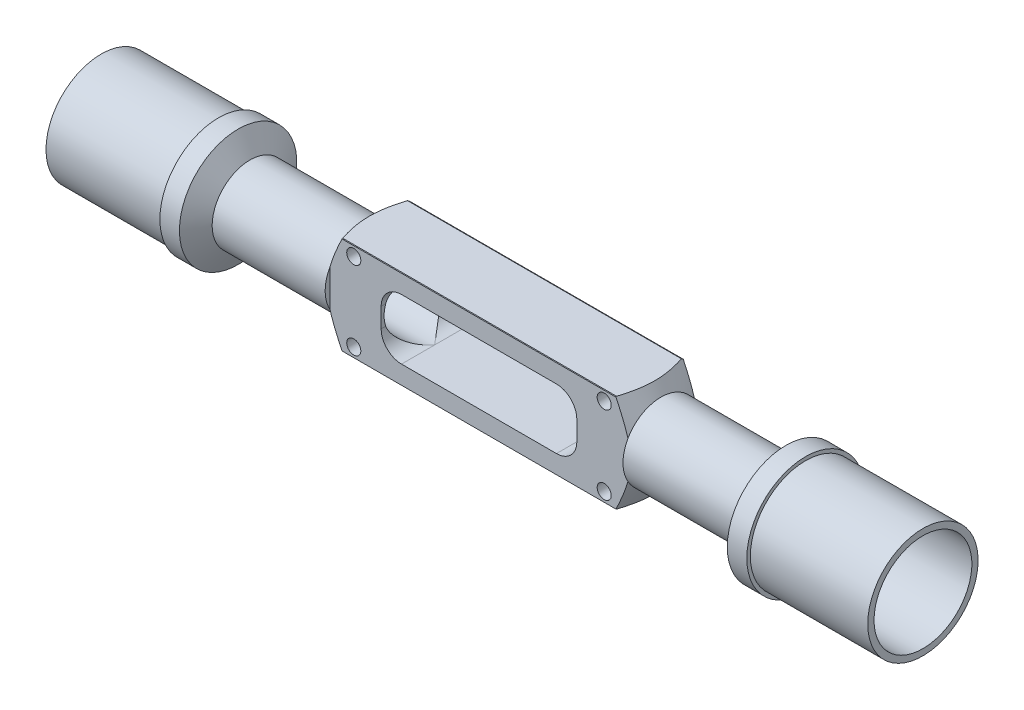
ISO-10303-21;
HEADER;
FILE_DESCRIPTION(('STEP AP214'),'2;1');
FILE_NAME('part.step','',(''),(''),'','','');
FILE_SCHEMA(('AUTOMOTIVE_DESIGN { 1 0 10303 214 1 1 1 1 }'));
ENDSEC;
DATA;
#1=APPLICATION_CONTEXT('core data for automotive mechanical design processes');
#2=APPLICATION_PROTOCOL_DEFINITION('international standard','automotive_design',2000,#1);
#3=PRODUCT_CONTEXT('',#1,'mechanical');
#4=PRODUCT('Part','Part','',(#3));
#5=PRODUCT_RELATED_PRODUCT_CATEGORY('part','',(#4));
#6=PRODUCT_DEFINITION_FORMATION('','',#4);
#7=PRODUCT_DEFINITION_CONTEXT('part definition',#1,'design');
#8=PRODUCT_DEFINITION('design','',#6,#7);
#9=PRODUCT_DEFINITION_SHAPE('','',#8);
#10=(LENGTH_UNIT() NAMED_UNIT(*) SI_UNIT(.MILLI.,.METRE.));
#11=(NAMED_UNIT(*) PLANE_ANGLE_UNIT() SI_UNIT($,.RADIAN.));
#12=(NAMED_UNIT(*) SI_UNIT($,.STERADIAN.) SOLID_ANGLE_UNIT());
#13=UNCERTAINTY_MEASURE_WITH_UNIT(LENGTH_MEASURE(1.E-05),#10,'distance_accuracy_value','');
#14=(GEOMETRIC_REPRESENTATION_CONTEXT(3) GLOBAL_UNCERTAINTY_ASSIGNED_CONTEXT((#13)) GLOBAL_UNIT_ASSIGNED_CONTEXT((#10,
#11,#12)) REPRESENTATION_CONTEXT('',''));
#15=CARTESIAN_POINT('',(0.,0.,0.));
#16=DIRECTION('',(0.,0.,1.));
#17=DIRECTION('',(1.,0.,0.));
#18=AXIS2_PLACEMENT_3D('',#15,#16,#17);
#19=CARTESIAN_POINT('',(-211.766779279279,0.,0.));
#20=DIRECTION('',(-1.,0.,0.));
#21=DIRECTION('',(0.,0.,1.));
#22=AXIS2_PLACEMENT_3D('',#19,#20,#21);
#23=CYLINDRICAL_SURFACE('',#22,19.05);
#24=CARTESIAN_POINT('',(-88.9,0.,0.));
#25=DIRECTION('',(-1.,0.,0.));
#26=DIRECTION('',(0.,0.,1.));
#27=AXIS2_PLACEMENT_3D('',#24,#25,#26);
#28=CIRCLE('',#27,19.05);
#29=CARTESIAN_POINT('',(-88.9,0.,19.05));
#30=VERTEX_POINT('',#29);
#31=EDGE_CURVE('E1152',#30,#30,#28,.T.);
#32=ORIENTED_EDGE('',*,*,#31,.T.);
#33=EDGE_LOOP('',(#32));
#34=FACE_BOUND('',#33,.T.);
#35=CARTESIAN_POINT('',(-95.25,0.,0.));
#36=DIRECTION('',(-1.,0.,0.));
#37=DIRECTION('',(0.,0.,1.));
#38=AXIS2_PLACEMENT_3D('',#35,#36,#37);
#39=CIRCLE('',#38,19.05);
#40=CARTESIAN_POINT('',(-95.25,0.,19.05));
#41=VERTEX_POINT('',#40);
#42=EDGE_CURVE('E535',#41,#41,#39,.T.);
#43=ORIENTED_EDGE('',*,*,#42,.F.);
#44=EDGE_LOOP('',(#43));
#45=FACE_BOUND('',#44,.T.);
#46=ADVANCED_FACE('F34',(#34,#45),#23,.T.);
#47=CARTESIAN_POINT('',(-211.766779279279,0.,0.));
#48=DIRECTION('',(-1.,0.,0.));
#49=DIRECTION('',(0.,0.,1.));
#50=AXIS2_PLACEMENT_3D('',#47,#48,#49);
#51=CYLINDRICAL_SURFACE('',#50,19.05);
#52=CARTESIAN_POINT('',(88.9,0.,0.));
#53=DIRECTION('',(-1.,0.,0.));
#54=DIRECTION('',(0.,0.,1.));
#55=AXIS2_PLACEMENT_3D('',#52,#53,#54);
#56=CIRCLE('',#55,19.05);
#57=CARTESIAN_POINT('',(88.9,0.,19.05));
#58=VERTEX_POINT('',#57);
#59=EDGE_CURVE('E514',#58,#58,#56,.T.);
#60=ORIENTED_EDGE('',*,*,#59,.F.);
#61=EDGE_LOOP('',(#60));
#62=FACE_BOUND('',#61,.T.);
#63=CARTESIAN_POINT('',(95.25,0.,0.));
#64=DIRECTION('',(1.,0.,0.));
#65=DIRECTION('',(0.,0.,-1.));
#66=AXIS2_PLACEMENT_3D('',#63,#64,#65);
#67=CIRCLE('',#66,19.05);
#68=CARTESIAN_POINT('',(95.25,0.,-19.05));
#69=VERTEX_POINT('',#68);
#70=EDGE_CURVE('E299',#69,#69,#67,.T.);
#71=ORIENTED_EDGE('',*,*,#70,.F.);
#72=EDGE_LOOP('',(#71));
#73=FACE_BOUND('',#72,.T.);
#74=ADVANCED_FACE('F525',(#62,#73),#51,.T.);
#75=CARTESIAN_POINT('',(-211.766779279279,0.,0.));
#76=DIRECTION('',(-1.,0.,0.));
#77=DIRECTION('',(0.,0.,1.));
#78=AXIS2_PLACEMENT_3D('',#75,#76,#77);
#79=CYLINDRICAL_SURFACE('',#78,19.05);
#80=CARTESIAN_POINT('',(44.45,0.,0.));
#81=DIRECTION('',(-1.,0.,0.));
#82=DIRECTION('',(0.,0.,1.));
#83=AXIS2_PLACEMENT_3D('',#80,#81,#82);
#84=CIRCLE('',#83,19.05);
#85=CARTESIAN_POINT('',(44.45,15.875,-10.5302837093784));
#86=VERTEX_POINT('',#85);
#87=CARTESIAN_POINT('',(44.45,15.4730360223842,-11.1125));
#88=VERTEX_POINT('',#87);
#89=EDGE_CURVE('E244',#86,#88,#84,.T.);
#90=ORIENTED_EDGE('',*,*,#89,.T.);
#91=DIRECTION('',(-1.,0.,0.));
#92=VECTOR('',#91,1.);
#93=CARTESIAN_POINT('',(-211.766779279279,15.4730360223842,-11.1125));
#94=LINE('',#93,#92);
#95=CARTESIAN_POINT('',(-44.45,15.4730360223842,-11.1125));
#96=VERTEX_POINT('',#95);
#97=EDGE_CURVE('E302',#88,#96,#94,.T.);
#98=ORIENTED_EDGE('',*,*,#97,.T.);
#99=CARTESIAN_POINT('',(-44.45,0.,0.));
#100=DIRECTION('',(-1.,0.,0.));
#101=DIRECTION('',(0.,0.,1.));
#102=AXIS2_PLACEMENT_3D('',#99,#100,#101);
#103=CIRCLE('',#102,19.05);
#104=CARTESIAN_POINT('',(-44.45,15.875,-10.5302837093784));
#105=VERTEX_POINT('',#104);
#106=EDGE_CURVE('E264',#105,#96,#103,.T.);
#107=ORIENTED_EDGE('',*,*,#106,.F.);
#108=DIRECTION('',(-1.,0.,0.));
#109=VECTOR('',#108,1.);
#110=CARTESIAN_POINT('',(-211.766779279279,15.875,-10.5302837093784));
#111=LINE('',#110,#109);
#112=EDGE_CURVE('E350',#105,#86,#111,.F.);
#113=ORIENTED_EDGE('',*,*,#112,.T.);
#114=EDGE_LOOP('',(#90,#98,#107,#113));
#115=FACE_BOUND('',#114,.T.);
#116=ADVANCED_FACE('F489',(#115),#79,.T.);
#117=CARTESIAN_POINT('',(-44.45,0.,0.));
#118=DIRECTION('',(1.,0.,0.));
#119=DIRECTION('',(0.,0.,-1.));
#120=AXIS2_PLACEMENT_3D('',#117,#118,#119);
#121=CONICAL_SURFACE('',#120,19.05,1.0471975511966);
#122=ORIENTED_EDGE('',*,*,#106,.T.);
#123=CARTESIAN_POINT('',(-34.2101307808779,35.0673667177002,-11.1125));
#124=CARTESIAN_POINT('',(-34.6368465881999,34.2919999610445,-11.1125));
#125=CARTESIAN_POINT('',(-35.0626134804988,33.5161088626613,-11.1125));
#126=CARTESIAN_POINT('',(-35.9117395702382,31.9629979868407,-11.1125));
#127=CARTESIAN_POINT('',(-36.335098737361,31.1857781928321,-11.1125));
#128=CARTESIAN_POINT('',(-37.1791093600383,29.6293425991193,-11.1125));
#129=CARTESIAN_POINT('',(-37.5997592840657,28.8501259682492,-11.1125));
#130=CARTESIAN_POINT('',(-38.4374023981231,27.2897335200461,-11.1125));
#131=CARTESIAN_POINT('',(-38.8543956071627,26.5085577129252,-11.1125));
#132=CARTESIAN_POINT('',(-39.6916298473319,24.9289272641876,-11.1125));
#133=CARTESIAN_POINT('',(-40.1117826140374,24.1304257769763,-11.1125));
#134=CARTESIAN_POINT('',(-40.9458916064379,22.5301953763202,-11.1125));
#135=CARTESIAN_POINT('',(-41.3598478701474,21.7284664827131,-11.1125));
#136=CARTESIAN_POINT('',(-42.1795059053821,20.1210164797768,-11.1125));
#137=CARTESIAN_POINT('',(-42.5852095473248,19.3152963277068,-11.1125));
#138=CARTESIAN_POINT('',(-43.1854462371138,18.1026092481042,-11.1125));
#139=CARTESIAN_POINT('',(-43.384136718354,17.6976998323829,-11.1125));
#140=CARTESIAN_POINT('',(-43.7782427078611,16.886291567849,-11.1125));
#141=CARTESIAN_POINT('',(-43.9736582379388,16.4797927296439,-11.1125));
#142=CARTESIAN_POINT('',(-44.364539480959,15.6567006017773,-11.1125));
#143=CARTESIAN_POINT('',(-44.5599260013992,15.240069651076,-11.1125));
#144=CARTESIAN_POINT('',(-44.9458746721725,14.404582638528,-11.1125));
#145=CARTESIAN_POINT('',(-45.1364368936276,13.9857266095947,-11.1125));
#146=CARTESIAN_POINT('',(-45.5117993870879,13.1452919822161,-11.1125));
#147=CARTESIAN_POINT('',(-45.6965980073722,12.7237126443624,-11.1125));
#148=CARTESIAN_POINT('',(-46.059120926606,11.877516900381,-11.1125));
#149=CARTESIAN_POINT('',(-46.2368452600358,11.4529005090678,-11.1125));
#150=CARTESIAN_POINT('',(-46.58307818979,10.6014952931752,-11.1125));
#151=CARTESIAN_POINT('',(-46.7516144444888,10.1747177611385,-11.1125));
#152=CARTESIAN_POINT('',(-47.0780989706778,9.31709650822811,-11.1125));
#153=CARTESIAN_POINT('',(-47.2360468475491,8.88625263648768,-11.1125));
#154=CARTESIAN_POINT('',(-47.5388149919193,8.02007071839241,-11.1125));
#155=CARTESIAN_POINT('',(-47.6836388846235,7.58473395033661,-11.1125));
#156=CARTESIAN_POINT('',(-47.957116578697,6.70905874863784,-11.1125));
#157=CARTESIAN_POINT('',(-48.0857721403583,6.26872086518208,-11.1125));
#158=CARTESIAN_POINT('',(-48.3677139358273,5.21691926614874,-11.1125));
#159=CARTESIAN_POINT('',(-48.5122307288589,4.60301512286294,-11.1125));
#160=CARTESIAN_POINT('',(-48.6930218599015,3.67524992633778,-11.1125));
#161=CARTESIAN_POINT('',(-48.7472869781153,3.36485417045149,-11.1125));
#162=CARTESIAN_POINT('',(-48.8425560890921,2.74204891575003,-11.1125));
#163=CARTESIAN_POINT('',(-48.8835618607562,2.42963969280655,-11.1125));
#164=CARTESIAN_POINT('',(-48.9510128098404,1.80519114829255,-11.1125));
#165=CARTESIAN_POINT('',(-48.9775461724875,1.49316141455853,-11.1125));
#166=CARTESIAN_POINT('',(-49.0156677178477,0.868187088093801,-11.1125));
#167=CARTESIAN_POINT('',(-49.0272561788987,0.555242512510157,-11.1125));
#168=CARTESIAN_POINT('',(-49.0351318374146,-0.0708311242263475,-11.1125));
#169=CARTESIAN_POINT('',(-49.0314195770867,-0.383960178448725,-11.1125));
#170=CARTESIAN_POINT('',(-49.0088138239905,-1.00967113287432,-11.1125));
#171=CARTESIAN_POINT('',(-48.9899197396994,-1.32225301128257,-11.1125));
#172=CARTESIAN_POINT('',(-48.9305324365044,-2.02915987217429,-11.1125));
#173=CARTESIAN_POINT('',(-48.8856315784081,-2.42311777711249,-11.1125));
#174=CARTESIAN_POINT('',(-48.7743457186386,-3.20798153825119,-11.1125));
#175=CARTESIAN_POINT('',(-48.7079582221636,-3.59888703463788,-11.1125));
#176=CARTESIAN_POINT('',(-48.5561624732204,-4.37728193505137,-11.1125));
#177=CARTESIAN_POINT('',(-48.4707386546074,-4.76476827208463,-11.1125));
#178=CARTESIAN_POINT('',(-48.2835696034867,-5.53573678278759,-11.1125));
#179=CARTESIAN_POINT('',(-48.1818245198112,-5.91921899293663,-11.1125));
#180=CARTESIAN_POINT('',(-47.9622480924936,-6.69030245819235,-11.1125));
#181=CARTESIAN_POINT('',(-47.8441218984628,-7.07781914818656,-11.1125));
#182=CARTESIAN_POINT('',(-47.595888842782,-7.84897297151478,-11.1125));
#183=CARTESIAN_POINT('',(-47.4657819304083,-8.23261008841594,-11.1125));
#184=CARTESIAN_POINT('',(-47.1956766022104,-8.99620890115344,-11.1125));
#185=CARTESIAN_POINT('',(-47.0556818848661,-9.37617191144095,-11.1125));
#186=CARTESIAN_POINT('',(-46.7674459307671,-10.1329373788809,-11.1125));
#187=CARTESIAN_POINT('',(-46.6192048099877,-10.5097398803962,-11.1125));
#188=CARTESIAN_POINT('',(-46.2459983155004,-11.4335236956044,-11.1125));
#189=CARTESIAN_POINT('',(-46.017148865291,-11.9789338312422,-11.1125));
#190=CARTESIAN_POINT('',(-45.5481903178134,-13.0649068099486,-11.1125));
#191=CARTESIAN_POINT('',(-45.3080804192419,-13.6054693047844,-11.1125));
#192=CARTESIAN_POINT('',(-44.8190117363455,-14.682730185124,-11.1125));
#193=CARTESIAN_POINT('',(-44.5700507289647,-15.2194275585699,-11.1125));
#194=CARTESIAN_POINT('',(-44.0651851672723,-16.2895210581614,-11.1125));
#195=CARTESIAN_POINT('',(-43.8092807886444,-16.8229172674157,-11.1125));
#196=CARTESIAN_POINT('',(-43.2915978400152,-17.8876288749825,-11.1125));
#197=CARTESIAN_POINT('',(-43.0298126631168,-18.4189410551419,-11.1125));
#198=CARTESIAN_POINT('',(-42.5017167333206,-19.4793116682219,-11.1125));
#199=CARTESIAN_POINT('',(-42.2354059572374,-20.0083700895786,-11.1125));
#200=CARTESIAN_POINT('',(-41.6991143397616,-21.0645240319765,-11.1125));
#201=CARTESIAN_POINT('',(-41.4291340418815,-21.5916198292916,-11.1125));
#202=CARTESIAN_POINT('',(-40.8860956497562,-22.6442244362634,-11.1125));
#203=CARTESIAN_POINT('',(-40.6130375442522,-23.1697332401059,-11.1125));
#204=CARTESIAN_POINT('',(-39.839329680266,-24.6499132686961,-11.1125));
#205=CARTESIAN_POINT('',(-39.3357154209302,-25.6030347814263,-11.1125));
#206=CARTESIAN_POINT('',(-38.3222082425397,-27.5059756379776,-11.1125));
#207=CARTESIAN_POINT('',(-37.8123150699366,-28.4557948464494,-11.1125));
#208=CARTESIAN_POINT('',(-36.789096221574,-30.3503996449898,-11.1125));
#209=CARTESIAN_POINT('',(-36.2757828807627,-31.2951919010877,-11.1125));
#210=CARTESIAN_POINT('',(-35.5030677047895,-32.710844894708,-11.1125));
#211=CARTESIAN_POINT('',(-35.2450458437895,-33.182459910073,-11.1125));
#212=CARTESIAN_POINT('',(-34.7281803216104,-34.1252386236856,-11.1125));
#213=CARTESIAN_POINT('',(-34.4693366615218,-34.5964023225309,-11.1125));
#214=CARTESIAN_POINT('',(-34.2101307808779,-35.0673667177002,-11.1125));
#215=B_SPLINE_CURVE_WITH_KNOTS('',3,(#123,#124,#125,#126,#127,#128,#129,#130,#131,#132,#133,
#134,#135,#136,#137,#138,#139,#140,#141,#142,#143,#144,#145,#146,#147,#148,#149,#150,#151,#152,
#153,#154,#155,#156,#157,#158,#159,#160,#161,#162,#163,#164,#165,#166,#167,#168,#169,#170,#171,
#172,#173,#174,#175,#176,#177,#178,#179,#180,#181,#182,#183,#184,#185,#186,#187,#188,#189,#190,
#191,#192,#193,#194,#195,#196,#197,#198,#199,#200,#201,#202,#203,#204,#205,#206,#207,#208,#209,
#210,#211,#212,#213,#214),.UNSPECIFIED.,.F.,.F.,(4,2,2,2,2,2,2,2,2,2,2,2,2,2,2,2,2,2,2,2,2,2,2,
2,2,2,2,2,2,2,2,2,2,2,2,2,2,2,2,2,2,2,2,2,2,4),(0.,2.65509529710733,5.3102239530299,
7.96674089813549,10.6232440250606,13.3301021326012,16.0369436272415,18.7431646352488,
20.0962479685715,21.4493222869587,22.8298094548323,24.2102762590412,25.5911351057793,
26.9719872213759,28.348422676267,29.7249094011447,31.1010147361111,32.4769701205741,
34.36725382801,35.3123306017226,36.2572805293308,37.1964063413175,38.1355146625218,
39.0745897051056,40.0137013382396,41.2025466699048,42.3915300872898,43.5814893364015,
44.7714377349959,45.986567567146,47.2017025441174,48.4163853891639,49.6310511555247,
51.4053017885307,53.1796788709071,54.9545048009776,56.7292858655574,58.5061718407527,
60.2830669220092,62.0597016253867,63.8363428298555,67.0702845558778,70.3043573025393,
73.5300408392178,75.1427906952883,76.7555384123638),.UNSPECIFIED.);
#216=CARTESIAN_POINT('',(-48.3361446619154,5.31696386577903,-11.1125));
#217=VERTEX_POINT('',#216);
#218=EDGE_CURVE('E234',#96,#217,#215,.T.);
#219=ORIENTED_EDGE('',*,*,#218,.T.);
#220=CARTESIAN_POINT('',(-48.3361446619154,0.,0.));
#221=DIRECTION('',(-1.,0.,0.));
#222=DIRECTION('',(0.,0.,1.));
#223=AXIS2_PLACEMENT_3D('',#220,#221,#222);
#224=CIRCLE('',#223,12.319);
#225=CARTESIAN_POINT('',(-48.3361446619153,6.04918744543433,10.7315));
#226=VERTEX_POINT('',#225);
#227=EDGE_CURVE('E283',#226,#217,#224,.T.);
#228=ORIENTED_EDGE('',*,*,#227,.F.);
#229=CARTESIAN_POINT('',(-30.4046565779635,-42.0288066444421,10.7315));
#230=CARTESIAN_POINT('',(-30.9195351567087,-41.1083563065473,10.7315));
#231=CARTESIAN_POINT('',(-31.4336602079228,-40.1874832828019,10.7315));
#232=CARTESIAN_POINT('',(-32.4599885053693,-38.344659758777,10.7315));
#233=CARTESIAN_POINT('',(-32.9721917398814,-37.4227092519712,10.7315));
#234=CARTESIAN_POINT('',(-33.9943963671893,-35.5772553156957,10.7315));
#235=CARTESIAN_POINT('',(-34.5043971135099,-34.6537515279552,10.7315));
#236=CARTESIAN_POINT('',(-35.5214633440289,-32.8051312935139,10.7315));
#237=CARTESIAN_POINT('',(-36.0285288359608,-31.8800148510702,10.7315));
#238=CARTESIAN_POINT('',(-37.038336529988,-30.0288468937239,10.7315));
#239=CARTESIAN_POINT('',(-37.5410831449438,-29.1027977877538,10.7315));
#240=CARTESIAN_POINT('',(-38.5417668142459,-27.2481047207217,10.7315));
#241=CARTESIAN_POINT('',(-39.0397038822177,-26.3194607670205,10.7315));
#242=CARTESIAN_POINT('',(-40.0291411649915,-24.4589068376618,10.7315));
#243=CARTESIAN_POINT('',(-40.5206422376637,-23.5269973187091,10.7315));
#244=CARTESIAN_POINT('',(-41.4950057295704,-21.658674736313,10.7315));
#245=CARTESIAN_POINT('',(-41.9778682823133,-20.7222617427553,10.7315));
#246=CARTESIAN_POINT('',(-42.6917361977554,-19.315560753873,10.7315));
#247=CARTESIAN_POINT('',(-42.9273233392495,-18.8475981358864,10.7315));
#248=CARTESIAN_POINT('',(-43.3948619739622,-17.9098617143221,10.7315));
#249=CARTESIAN_POINT('',(-43.6268134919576,-17.4400879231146,10.7315));
#250=CARTESIAN_POINT('',(-44.086368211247,-16.4983006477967,10.7315));
#251=CARTESIAN_POINT('',(-44.313970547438,-16.0262867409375,10.7315));
#252=CARTESIAN_POINT('',(-44.7637957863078,-15.079700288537,10.7315));
#253=CARTESIAN_POINT('',(-44.9860187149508,-14.6051277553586,10.7315));
#254=CARTESIAN_POINT('',(-45.4248666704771,-13.6506304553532,10.7315));
#255=CARTESIAN_POINT('',(-45.6414596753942,-13.1706909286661,10.7315));
#256=CARTESIAN_POINT('',(-46.066251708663,-12.2070795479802,10.7315));
#257=CARTESIAN_POINT('',(-46.2744504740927,-11.7234075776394,10.7315));
#258=CARTESIAN_POINT('',(-46.6801750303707,-10.7517100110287,10.7315));
#259=CARTESIAN_POINT('',(-46.8777030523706,-10.2636853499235,10.7315));
#260=CARTESIAN_POINT('',(-47.2591891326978,-9.28235833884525,10.7315));
#261=CARTESIAN_POINT('',(-47.4431482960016,-8.78905642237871,10.7315));
#262=CARTESIAN_POINT('',(-47.7281003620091,-7.98185379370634,10.7315));
#263=CARTESIAN_POINT('',(-47.8344001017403,-7.66982714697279,10.7315));
#264=CARTESIAN_POINT('',(-48.0389769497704,-7.04314162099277,10.7315));
#265=CARTESIAN_POINT('',(-48.1372540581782,-6.72848274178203,10.7315));
#266=CARTESIAN_POINT('',(-48.3244522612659,-6.0963627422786,10.7315));
#267=CARTESIAN_POINT('',(-48.413372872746,-5.77890147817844,10.7315));
#268=CARTESIAN_POINT('',(-48.5803519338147,-5.1411072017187,10.7315));
#269=CARTESIAN_POINT('',(-48.6584100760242,-4.82077410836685,10.7315));
#270=CARTESIAN_POINT('',(-48.8012397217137,-4.18091644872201,10.7315));
#271=CARTESIAN_POINT('',(-48.8661506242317,-3.86142321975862,10.7315));
#272=CARTESIAN_POINT('',(-48.9821847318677,-3.21996938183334,10.7315));
#273=CARTESIAN_POINT('',(-49.0333099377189,-2.89800913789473,10.7315));
#274=CARTESIAN_POINT('',(-49.1203152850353,-2.25212615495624,10.7315));
#275=CARTESIAN_POINT('',(-49.1562005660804,-1.92820411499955,10.7315));
#276=CARTESIAN_POINT('',(-49.2115959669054,-1.27895221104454,10.7315));
#277=CARTESIAN_POINT('',(-49.2311062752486,-0.953622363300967,10.7315));
#278=CARTESIAN_POINT('',(-49.2531945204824,-0.298703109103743,10.7315));
#279=CARTESIAN_POINT('',(-49.255578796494,0.0308929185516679,10.7315));
#280=CARTESIAN_POINT('',(-49.2428148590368,0.689742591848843,10.7315));
#281=CARTESIAN_POINT('',(-49.2276665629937,1.01899623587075,10.7315));
#282=CARTESIAN_POINT('',(-49.180380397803,1.67634535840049,10.7315));
#283=CARTESIAN_POINT('',(-49.1482385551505,2.0044405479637,10.7315));
#284=CARTESIAN_POINT('',(-49.0680476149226,2.65866828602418,10.7315));
#285=CARTESIAN_POINT('',(-49.0199981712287,2.98480079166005,10.7315));
#286=CARTESIAN_POINT('',(-48.9088001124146,3.63833542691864,10.7315));
#287=CARTESIAN_POINT('',(-48.8454835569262,3.96570873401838,10.7315));
#288=CARTESIAN_POINT('',(-48.7057262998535,4.61762386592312,10.7315));
#289=CARTESIAN_POINT('',(-48.6292854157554,4.94216565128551,10.7315));
#290=CARTESIAN_POINT('',(-48.4649521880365,5.58836749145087,10.7315));
#291=CARTESIAN_POINT('',(-48.3770581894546,5.91002712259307,10.7315));
#292=CARTESIAN_POINT('',(-48.1914144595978,6.55045480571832,10.7315));
#293=CARTESIAN_POINT('',(-48.0936652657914,6.86922301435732,10.7315));
#294=CARTESIAN_POINT('',(-47.8938570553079,7.49118665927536,10.7315));
#295=CARTESIAN_POINT('',(-47.7921327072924,7.79449011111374,10.7315));
#296=CARTESIAN_POINT('',(-47.5820011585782,8.39877901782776,10.7315));
#297=CARTESIAN_POINT('',(-47.4735936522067,8.69976436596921,10.7315));
#298=CARTESIAN_POINT('',(-47.1397582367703,9.59966466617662,10.7315));
#299=CARTESIAN_POINT('',(-46.905757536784,10.1954016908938,10.7315));
#300=CARTESIAN_POINT('',(-46.4206772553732,11.3804803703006,10.7315));
#301=CARTESIAN_POINT('',(-46.1695812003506,11.9698152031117,10.7315));
#302=CARTESIAN_POINT('',(-45.6547445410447,13.1428413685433,10.7315));
#303=CARTESIAN_POINT('',(-45.3910052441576,13.7265332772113,10.7315));
#304=CARTESIAN_POINT('',(-44.8531506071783,14.8910339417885,10.7315));
#305=CARTESIAN_POINT('',(-44.5790088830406,15.471830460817,10.7315));
#306=CARTESIAN_POINT('',(-44.0232184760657,16.629825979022,10.7315));
#307=CARTESIAN_POINT('',(-43.7415696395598,17.207024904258,10.7315));
#308=CARTESIAN_POINT('',(-43.1725320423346,18.3581881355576,10.7315));
#309=CARTESIAN_POINT('',(-42.8851465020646,18.9321540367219,10.7315));
#310=CARTESIAN_POINT('',(-42.3056791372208,20.0777012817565,10.7315));
#311=CARTESIAN_POINT('',(-42.0135973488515,20.6492826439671,10.7315));
#312=CARTESIAN_POINT('',(-41.4250583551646,21.7916068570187,10.7315));
#313=CARTESIAN_POINT('',(-41.128593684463,22.3623458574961,10.7315));
#314=CARTESIAN_POINT('',(-40.5325376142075,23.5021897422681,10.7315));
#315=CARTESIAN_POINT('',(-40.2329462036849,24.0712946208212,10.7315));
#316=CARTESIAN_POINT('',(-39.3302458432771,25.7767070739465,10.7315));
#317=CARTESIAN_POINT('',(-38.7232823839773,26.9109741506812,10.7315));
#318=CARTESIAN_POINT('',(-37.5030048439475,29.1739972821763,10.7315));
#319=CARTESIAN_POINT('',(-36.8897010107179,30.3027588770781,10.7315));
#320=CARTESIAN_POINT('',(-35.6578338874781,32.5573593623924,10.7315));
#321=CARTESIAN_POINT('',(-35.0392707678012,33.6831983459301,10.7315));
#322=CARTESIAN_POINT('',(-34.0857141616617,35.4115098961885,10.7315));
#323=CARTESIAN_POINT('',(-33.7521356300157,36.0147641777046,10.7315));
#324=CARTESIAN_POINT('',(-33.0839019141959,37.2208612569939,10.7315));
#325=CARTESIAN_POINT('',(-32.7492464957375,37.8237039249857,10.7315));
#326=CARTESIAN_POINT('',(-32.0799960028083,39.0272361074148,10.7315));
#327=CARTESIAN_POINT('',(-31.7454033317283,39.6279269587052,10.7315));
#328=CARTESIAN_POINT('',(-31.0755356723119,40.8287421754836,10.7315));
#329=CARTESIAN_POINT('',(-30.7402608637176,41.4288666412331,10.7315));
#330=CARTESIAN_POINT('',(-30.4046565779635,42.0288066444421,10.7315));
#331=B_SPLINE_CURVE_WITH_KNOTS('',3,(#229,#230,#231,#232,#233,#234,#235,#236,#237,#238,#239,
#240,#241,#242,#243,#244,#245,#246,#247,#248,#249,#250,#251,#252,#253,#254,#255,#256,#257,#258,
#259,#260,#261,#262,#263,#264,#265,#266,#267,#268,#269,#270,#271,#272,#273,#274,#275,#276,#277,
#278,#279,#280,#281,#282,#283,#284,#285,#286,#287,#288,#289,#290,#291,#292,#293,#294,#295,#296,
#297,#298,#299,#300,#301,#302,#303,#304,#305,#306,#307,#308,#309,#310,#311,#312,#313,#314,#315,
#316,#317,#318,#319,#320,#321,#322,#323,#324,#325,#326,#327,#328,#329,#330),.UNSPECIFIED.,.F.,
.F.,(4,2,2,2,2,2,2,2,2,2,2,2,2,2,2,2,2,2,2,2,2,2,2,2,2,2,2,2,2,2,2,2,2,2,2,2,2,2,2,2,2,2,2,2,2,
2,2,2,2,2,4),(0.,3.16401114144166,6.32804154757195,9.49294490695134,12.6578399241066,
15.8189827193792,18.980116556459,22.1408246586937,25.3014838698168,26.8732263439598,
28.4449581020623,30.0169993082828,31.589032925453,33.1686188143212,34.7482541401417,
36.3275578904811,37.9067328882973,38.8955546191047,39.884376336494,40.8732490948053,
41.8621498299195,42.8399422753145,43.8175927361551,44.7949132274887,45.7722224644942,
46.7605659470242,47.7489140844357,48.7374934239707,49.7260942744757,50.7261102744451,
51.7261401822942,52.726314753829,53.7264348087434,54.6860673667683,55.6457438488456,
57.5654823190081,59.4870976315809,61.4085146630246,63.3351821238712,65.2618890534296,
67.1875432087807,69.1131825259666,71.042603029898,72.9720303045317,76.8313521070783,
80.6851909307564,84.5389054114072,86.6069263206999,88.6754325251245,90.7382057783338,
92.8004920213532),.UNSPECIFIED.);
#332=CARTESIAN_POINT('',(-44.45,15.7396762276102,10.7315));
#333=VERTEX_POINT('',#332);
#334=EDGE_CURVE('E390',#226,#333,#331,.T.);
#335=ORIENTED_EDGE('',*,*,#334,.T.);
#336=CARTESIAN_POINT('',(-44.45,15.875,10.5302837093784));
#337=VERTEX_POINT('',#336);
#338=EDGE_CURVE('E270',#333,#337,#103,.T.);
#339=ORIENTED_EDGE('',*,*,#338,.T.);
#340=CARTESIAN_POINT('',(-38.2159808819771,15.875,-25.2757959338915));
#341=CARTESIAN_POINT('',(-38.3869415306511,15.875,-24.9261165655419));
#342=CARTESIAN_POINT('',(-38.5570976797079,15.875,-24.576044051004));
#343=CARTESIAN_POINT('',(-38.8956199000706,15.875,-23.8750308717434));
#344=CARTESIAN_POINT('',(-39.063985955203,15.875,-23.5240901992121));
#345=CARTESIAN_POINT('',(-39.5661677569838,15.875,-22.4697581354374));
#346=CARTESIAN_POINT('',(-39.8970210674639,15.875,-21.7649506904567));
#347=CARTESIAN_POINT('',(-40.5505885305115,15.875,-20.3473028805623));
#348=CARTESIAN_POINT('',(-40.873253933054,15.875,-19.6344399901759));
#349=CARTESIAN_POINT('',(-41.5062260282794,15.875,-18.2032672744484));
#350=CARTESIAN_POINT('',(-41.8165332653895,15.875,-17.4849576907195));
#351=CARTESIAN_POINT('',(-42.4320410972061,15.875,-16.0166962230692));
#352=CARTESIAN_POINT('',(-42.7366899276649,15.875,-15.2665118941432));
#353=CARTESIAN_POINT('',(-43.3244803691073,15.875,-13.7576083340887));
#354=CARTESIAN_POINT('',(-43.6076196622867,15.875,-12.9988881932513));
#355=CARTESIAN_POINT('',(-44.1454329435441,15.875,-11.4729463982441));
#356=CARTESIAN_POINT('',(-44.4001591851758,15.875,-10.7057433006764));
#357=CARTESIAN_POINT('',(-44.8734297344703,15.875,-9.16028529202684));
#358=CARTESIAN_POINT('',(-45.0919847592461,15.875,-8.38203372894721));
#359=CARTESIAN_POINT('',(-45.3845443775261,15.875,-7.20824394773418));
#360=CARTESIAN_POINT('',(-45.4759761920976,15.875,-6.81702721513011));
#361=CARTESIAN_POINT('',(-45.6460422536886,15.875,-6.03180759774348));
#362=CARTESIAN_POINT('',(-45.7246767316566,15.875,-5.6378047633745));
#363=CARTESIAN_POINT('',(-45.8678036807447,15.875,-4.84724037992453));
#364=CARTESIAN_POINT('',(-45.9322966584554,15.875,-4.45067892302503));
#365=CARTESIAN_POINT('',(-46.0458834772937,15.875,-3.65536032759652));
#366=CARTESIAN_POINT('',(-46.0949780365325,15.875,-3.25660329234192));
#367=CARTESIAN_POINT('',(-46.1761398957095,15.875,-2.46292784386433));
#368=CARTESIAN_POINT('',(-46.2084335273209,15.875,-2.06803272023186));
#369=CARTESIAN_POINT('',(-46.2562734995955,15.875,-1.2772292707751));
#370=CARTESIAN_POINT('',(-46.2718201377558,15.875,-0.881320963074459));
#371=CARTESIAN_POINT('',(-46.2857922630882,15.875,-0.0891904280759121));
#372=CARTESIAN_POINT('',(-46.2842174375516,15.875,0.307031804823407));
#373=CARTESIAN_POINT('',(-46.2639899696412,15.875,1.09904473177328));
#374=CARTESIAN_POINT('',(-46.2453365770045,15.875,1.49483540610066));
#375=CARTESIAN_POINT('',(-46.1817335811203,15.875,2.42650810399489));
#376=CARTESIAN_POINT('',(-46.1297702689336,15.875,2.96192314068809));
#377=CARTESIAN_POINT('',(-45.9972814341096,15.875,4.02917648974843));
#378=CARTESIAN_POINT('',(-45.9167525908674,15.875,4.56101437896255));
#379=CARTESIAN_POINT('',(-45.6365592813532,15.875,6.15028174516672));
#380=CARTESIAN_POINT('',(-45.3983224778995,15.875,7.20102317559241));
#381=CARTESIAN_POINT('',(-44.979958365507,15.875,8.77389350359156));
#382=CARTESIAN_POINT('',(-44.8281169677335,15.875,9.30401763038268));
#383=CARTESIAN_POINT('',(-44.5073738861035,15.875,10.3591302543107));
#384=CARTESIAN_POINT('',(-44.3384720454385,15.875,10.8841187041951));
#385=CARTESIAN_POINT('',(-43.9864171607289,15.875,11.9291271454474));
#386=CARTESIAN_POINT('',(-43.8032672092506,15.875,12.4491481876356));
#387=CARTESIAN_POINT('',(-43.5195762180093,15.875,13.2258756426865));
#388=CARTESIAN_POINT('',(-43.4235196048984,15.875,13.4842305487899));
#389=CARTESIAN_POINT('',(-43.228662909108,15.875,13.9999032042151));
#390=CARTESIAN_POINT('',(-43.1298628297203,15.875,14.257220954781));
#391=CARTESIAN_POINT('',(-42.8055763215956,15.875,15.0896428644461));
#392=CARTESIAN_POINT('',(-42.575048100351,15.875,15.6627868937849));
#393=CARTESIAN_POINT('',(-42.1036358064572,15.875,16.804811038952));
#394=CARTESIAN_POINT('',(-41.8627512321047,15.875,17.3736909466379));
#395=CARTESIAN_POINT('',(-41.3723663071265,15.875,18.5078396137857));
#396=CARTESIAN_POINT('',(-41.1228644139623,15.875,19.0731077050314));
#397=CARTESIAN_POINT('',(-40.6167202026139,15.875,20.2004206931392));
#398=CARTESIAN_POINT('',(-40.3600779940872,15.875,20.7624656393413));
#399=CARTESIAN_POINT('',(-39.84062212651,15.875,21.8841557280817));
#400=CARTESIAN_POINT('',(-39.5778043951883,15.875,22.4437989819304));
#401=CARTESIAN_POINT('',(-39.047095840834,15.875,23.5606739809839));
#402=CARTESIAN_POINT('',(-38.779205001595,15.875,24.117905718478));
#403=CARTESIAN_POINT('',(-38.2391349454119,15.875,25.2302200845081));
#404=CARTESIAN_POINT('',(-37.9669561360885,15.875,25.7853029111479));
#405=CARTESIAN_POINT('',(-37.4189001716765,15.875,26.8936409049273));
#406=CARTESIAN_POINT('',(-37.1430230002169,15.875,27.4468960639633));
#407=CARTESIAN_POINT('',(-36.3093096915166,15.875,29.1069094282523));
#408=CARTESIAN_POINT('',(-35.74668568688,15.875,30.2112636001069));
#409=CARTESIAN_POINT('',(-34.6118341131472,15.875,32.4150378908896));
#410=CARTESIAN_POINT('',(-34.0396063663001,15.875,33.5144579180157));
#411=CARTESIAN_POINT('',(-32.8879567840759,15.875,35.7089743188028));
#412=CARTESIAN_POINT('',(-32.3085378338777,15.875,36.8040722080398));
#413=CARTESIAN_POINT('',(-31.1438767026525,15.875,38.9911548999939));
#414=CARTESIAN_POINT('',(-30.5586345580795,15.875,40.0831397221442));
#415=CARTESIAN_POINT('',(-29.466025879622,15.875,42.1113807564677));
#416=CARTESIAN_POINT('',(-28.959268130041,15.875,43.0479651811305));
#417=CARTESIAN_POINT('',(-27.9428709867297,15.875,44.9195695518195));
#418=CARTESIAN_POINT('',(-27.4332315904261,15.875,45.8545894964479));
#419=CARTESIAN_POINT('',(-25.9005798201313,15.875,48.657879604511));
#420=CARTESIAN_POINT('',(-24.8739471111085,15.875,50.5241703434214));
#421=CARTESIAN_POINT('',(-22.8182535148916,15.875,54.2445972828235));
#422=CARTESIAN_POINT('',(-21.7892236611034,15.875,56.0987506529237));
#423=CARTESIAN_POINT('',(-20.2418152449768,15.875,58.8776754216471));
#424=CARTESIAN_POINT('',(-19.7254010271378,15.875,59.8035414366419));
#425=CARTESIAN_POINT('',(-18.6914184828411,15.875,61.6546277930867));
#426=CARTESIAN_POINT('',(-18.1738501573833,15.875,62.5798481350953));
#427=CARTESIAN_POINT('',(-17.6557818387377,15.875,63.5047883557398));
#428=B_SPLINE_CURVE_WITH_KNOTS('',3,(#340,#341,#342,#343,#344,#345,#346,#347,#348,#349,#350,
#351,#352,#353,#354,#355,#356,#357,#358,#359,#360,#361,#362,#363,#364,#365,#366,#367,#368,#369,
#370,#371,#372,#373,#374,#375,#376,#377,#378,#379,#380,#381,#382,#383,#384,#385,#386,#387,#388,
#389,#390,#391,#392,#393,#394,#395,#396,#397,#398,#399,#400,#401,#402,#403,#404,#405,#406,#407,
#408,#409,#410,#411,#412,#413,#414,#415,#416,#417,#418,#419,#420,#421,#422,#423,#424,#425,#426,
#427),.UNSPECIFIED.,.F.,.F.,(4,2,2,2,2,2,2,2,2,2,2,2,2,2,2,2,2,2,2,2,2,2,2,2,2,2,2,2,2,2,2,2,2,
2,2,2,2,2,2,2,2,2,2,4),(0.,1.16770046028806,2.33541146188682,4.67114747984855,7.01851785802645,
9.36578471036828,11.7945832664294,14.2236431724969,16.648159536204,19.0719562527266,
20.2770579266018,21.4821378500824,22.6871745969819,23.8921551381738,25.0804527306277,
26.2687292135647,27.4570273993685,28.6453777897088,30.2582732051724,31.8713561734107,
35.0988453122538,36.7530108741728,38.4071916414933,40.0610143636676,40.8879027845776,
41.7147902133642,43.5679554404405,45.421210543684,47.2747991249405,49.1283592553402,
50.983178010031,52.8380026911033,54.6926521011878,56.5473097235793,60.2654766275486,
63.9837124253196,67.700501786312,71.4172678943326,74.6119365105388,77.8066079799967,
84.1966658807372,90.5583443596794,93.7387844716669,96.9192218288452),.UNSPECIFIED.);
#429=EDGE_CURVE('E365',#337,#105,#428,.F.);
#430=ORIENTED_EDGE('',*,*,#429,.T.);
#431=EDGE_LOOP('',(#122,#219,#228,#335,#339,#430));
#432=FACE_BOUND('',#431,.T.);
#433=ADVANCED_FACE('F301',(#432),#121,.T.);
#434=CARTESIAN_POINT('',(48.3361446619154,0.,0.));
#435=DIRECTION('',(-1.,0.,0.));
#436=DIRECTION('',(0.,0.,1.));
#437=AXIS2_PLACEMENT_3D('',#434,#435,#436);
#438=CONICAL_SURFACE('',#437,12.319,1.0471975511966);
#439=CARTESIAN_POINT('',(44.45,-15.4730360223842,-11.1125));
#440=VERTEX_POINT('',#439);
#441=CARTESIAN_POINT('',(44.45,-15.875,-10.5302837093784));
#442=VERTEX_POINT('',#441);
#443=EDGE_CURVE('E232',#440,#442,#84,.T.);
#444=ORIENTED_EDGE('',*,*,#443,.F.);
#445=CARTESIAN_POINT('',(34.2101307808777,-35.0673667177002,-11.1125));
#446=CARTESIAN_POINT('',(34.6368465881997,-34.2919999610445,-11.1125));
#447=CARTESIAN_POINT('',(35.0626134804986,-33.5161088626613,-11.1125));
#448=CARTESIAN_POINT('',(35.911739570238,-31.9629979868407,-11.1125));
#449=CARTESIAN_POINT('',(36.3350987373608,-31.1857781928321,-11.1125));
#450=CARTESIAN_POINT('',(37.179109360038,-29.6293425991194,-11.1125));
#451=CARTESIAN_POINT('',(37.5997592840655,-28.8501259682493,-11.1125));
#452=CARTESIAN_POINT('',(38.4374023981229,-27.2897335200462,-11.1125));
#453=CARTESIAN_POINT('',(38.8543956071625,-26.5085577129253,-11.1125));
#454=CARTESIAN_POINT('',(39.6916298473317,-24.9289272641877,-11.1125));
#455=CARTESIAN_POINT('',(40.1117826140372,-24.1304257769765,-11.1125));
#456=CARTESIAN_POINT('',(40.9458916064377,-22.5301953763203,-11.1125));
#457=CARTESIAN_POINT('',(41.3598478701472,-21.7284664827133,-11.1125));
#458=CARTESIAN_POINT('',(42.1795059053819,-20.121016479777,-11.1125));
#459=CARTESIAN_POINT('',(42.5852095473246,-19.3152963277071,-11.1125));
#460=CARTESIAN_POINT('',(43.1854462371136,-18.1026092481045,-11.1125));
#461=CARTESIAN_POINT('',(43.3841367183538,-17.6976998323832,-11.1125));
#462=CARTESIAN_POINT('',(43.7782427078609,-16.8862915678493,-11.1125));
#463=CARTESIAN_POINT('',(43.9736582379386,-16.4797927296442,-11.1125));
#464=CARTESIAN_POINT('',(44.3645394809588,-15.6567006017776,-11.1125));
#465=CARTESIAN_POINT('',(44.559926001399,-15.2400696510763,-11.1125));
#466=CARTESIAN_POINT('',(44.9458746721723,-14.4045826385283,-11.1125));
#467=CARTESIAN_POINT('',(45.1364368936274,-13.985726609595,-11.1125));
#468=CARTESIAN_POINT('',(45.5117993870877,-13.1452919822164,-11.1125));
#469=CARTESIAN_POINT('',(45.696598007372,-12.7237126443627,-11.1125));
#470=CARTESIAN_POINT('',(46.0591209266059,-11.8775169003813,-11.1125));
#471=CARTESIAN_POINT('',(46.2368452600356,-11.4529005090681,-11.1125));
#472=CARTESIAN_POINT('',(46.5830781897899,-10.6014952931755,-11.1125));
#473=CARTESIAN_POINT('',(46.7516144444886,-10.1747177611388,-11.1125));
#474=CARTESIAN_POINT('',(47.0780989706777,-9.31709650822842,-11.1125));
#475=CARTESIAN_POINT('',(47.236046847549,-8.88625263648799,-11.1125));
#476=CARTESIAN_POINT('',(47.5388149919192,-8.02007071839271,-11.1125));
#477=CARTESIAN_POINT('',(47.6836388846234,-7.58473395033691,-11.1125));
#478=CARTESIAN_POINT('',(47.9571165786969,-6.70905874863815,-11.1125));
#479=CARTESIAN_POINT('',(48.0857721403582,-6.26872086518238,-11.1125));
#480=CARTESIAN_POINT('',(48.3677139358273,-5.21691926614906,-11.1125));
#481=CARTESIAN_POINT('',(48.5122307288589,-4.60301512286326,-11.1125));
#482=CARTESIAN_POINT('',(48.6930218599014,-3.67524992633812,-11.1125));
#483=CARTESIAN_POINT('',(48.7472869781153,-3.36485417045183,-11.1125));
#484=CARTESIAN_POINT('',(48.8425560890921,-2.74204891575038,-11.1125));
#485=CARTESIAN_POINT('',(48.8835618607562,-2.42963969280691,-11.1125));
#486=CARTESIAN_POINT('',(48.9510128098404,-1.80519114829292,-11.1125));
#487=CARTESIAN_POINT('',(48.9775461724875,-1.4931614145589,-11.1125));
#488=CARTESIAN_POINT('',(49.0156677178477,-0.86818708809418,-11.1125));
#489=CARTESIAN_POINT('',(49.0272561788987,-0.555242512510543,-11.1125));
#490=CARTESIAN_POINT('',(49.0351318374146,0.0708311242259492,-11.1125));
#491=CARTESIAN_POINT('',(49.0314195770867,0.383960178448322,-11.1125));
#492=CARTESIAN_POINT('',(49.0088138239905,1.00967113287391,-11.1125));
#493=CARTESIAN_POINT('',(48.9899197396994,1.32225301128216,-11.1125));
#494=CARTESIAN_POINT('',(48.9305324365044,2.02915987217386,-11.1125));
#495=CARTESIAN_POINT('',(48.8856315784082,2.42311777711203,-11.1125));
#496=CARTESIAN_POINT('',(48.7743457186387,3.20798153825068,-11.1125));
#497=CARTESIAN_POINT('',(48.7079582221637,3.59888703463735,-11.1125));
#498=CARTESIAN_POINT('',(48.5561624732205,4.3772819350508,-11.1125));
#499=CARTESIAN_POINT('',(48.4707386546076,4.76476827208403,-11.1125));
#500=CARTESIAN_POINT('',(48.2835696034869,5.53573678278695,-11.1125));
#501=CARTESIAN_POINT('',(48.1818245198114,5.91921899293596,-11.1125));
#502=CARTESIAN_POINT('',(47.9622480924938,6.69030245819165,-11.1125));
#503=CARTESIAN_POINT('',(47.844121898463,7.07781914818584,-11.1125));
#504=CARTESIAN_POINT('',(47.5958888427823,7.84897297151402,-11.1125));
#505=CARTESIAN_POINT('',(47.4657819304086,8.23261008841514,-11.1125));
#506=CARTESIAN_POINT('',(47.1956766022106,8.9962089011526,-11.1125));
#507=CARTESIAN_POINT('',(47.0556818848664,9.37617191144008,-11.1125));
#508=CARTESIAN_POINT('',(46.7674459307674,10.13293737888,-11.1125));
#509=CARTESIAN_POINT('',(46.6192048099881,10.5097398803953,-11.1125));
#510=CARTESIAN_POINT('',(46.2459983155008,11.4335236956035,-11.1125));
#511=CARTESIAN_POINT('',(46.0171488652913,11.9789338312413,-11.1125));
#512=CARTESIAN_POINT('',(45.5481903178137,13.0649068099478,-11.1125));
#513=CARTESIAN_POINT('',(45.3080804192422,13.6054693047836,-11.1125));
#514=CARTESIAN_POINT('',(44.8190117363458,14.6827301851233,-11.1125));
#515=CARTESIAN_POINT('',(44.570050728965,15.2194275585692,-11.1125));
#516=CARTESIAN_POINT('',(44.0651851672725,16.2895210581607,-11.1125));
#517=CARTESIAN_POINT('',(43.8092807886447,16.8229172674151,-11.1125));
#518=CARTESIAN_POINT('',(43.2915978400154,17.8876288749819,-11.1125));
#519=CARTESIAN_POINT('',(43.029812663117,18.4189410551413,-11.1125));
#520=CARTESIAN_POINT('',(42.5017167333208,19.4793116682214,-11.1125));
#521=CARTESIAN_POINT('',(42.2354059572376,20.0083700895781,-11.1125));
#522=CARTESIAN_POINT('',(41.6991143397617,21.064524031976,-11.1125));
#523=CARTESIAN_POINT('',(41.4291340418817,21.5916198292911,-11.1125));
#524=CARTESIAN_POINT('',(40.8860956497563,22.6442244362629,-11.1125));
#525=CARTESIAN_POINT('',(40.6130375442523,23.1697332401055,-11.1125));
#526=CARTESIAN_POINT('',(39.839329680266,24.6499132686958,-11.1125));
#527=CARTESIAN_POINT('',(39.3357154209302,25.603034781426,-11.1125));
#528=CARTESIAN_POINT('',(38.3222082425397,27.5059756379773,-11.1125));
#529=CARTESIAN_POINT('',(37.8123150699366,28.4557948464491,-11.1125));
#530=CARTESIAN_POINT('',(36.7890962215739,30.3503996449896,-11.1125));
#531=CARTESIAN_POINT('',(36.2757828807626,31.2951919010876,-11.1125));
#532=CARTESIAN_POINT('',(35.5030677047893,32.7108448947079,-11.1125));
#533=CARTESIAN_POINT('',(35.2450458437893,33.1824599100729,-11.1125));
#534=CARTESIAN_POINT('',(34.7281803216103,34.1252386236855,-11.1125));
#535=CARTESIAN_POINT('',(34.4693366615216,34.5964023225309,-11.1125));
#536=CARTESIAN_POINT('',(34.2101307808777,35.0673667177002,-11.1125));
#537=B_SPLINE_CURVE_WITH_KNOTS('',3,(#445,#446,#447,#448,#449,#450,#451,#452,#453,#454,#455,
#456,#457,#458,#459,#460,#461,#462,#463,#464,#465,#466,#467,#468,#469,#470,#471,#472,#473,#474,
#475,#476,#477,#478,#479,#480,#481,#482,#483,#484,#485,#486,#487,#488,#489,#490,#491,#492,#493,
#494,#495,#496,#497,#498,#499,#500,#501,#502,#503,#504,#505,#506,#507,#508,#509,#510,#511,#512,
#513,#514,#515,#516,#517,#518,#519,#520,#521,#522,#523,#524,#525,#526,#527,#528,#529,#530,#531,
#532,#533,#534,#535,#536),.UNSPECIFIED.,.F.,.F.,(4,2,2,2,2,2,2,2,2,2,2,2,2,2,2,2,2,2,2,2,2,2,2,
2,2,2,2,2,2,2,2,2,2,2,2,2,2,2,2,2,2,2,2,2,2,4),(0.,2.6550952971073,5.31022395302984,
7.9667408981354,10.6232440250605,13.330102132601,16.0369436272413,18.7431646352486,
20.0962479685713,21.4493222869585,22.829809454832,24.210276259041,25.591135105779,
26.9719872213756,28.3484226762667,29.7249094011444,31.1010147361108,32.4769701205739,
34.3672538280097,35.3123306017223,36.2572805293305,37.1964063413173,38.1355146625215,
39.0745897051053,40.0137013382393,41.2025466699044,42.3915300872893,43.581489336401,
44.7714377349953,45.9865675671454,47.2017025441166,48.4163853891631,49.6310511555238,
51.4053017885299,53.1796788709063,54.954504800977,56.7292858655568,58.5061718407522,
60.2830669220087,62.0597016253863,63.8363428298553,67.0702845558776,70.3043573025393,
73.5300408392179,75.1427906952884,76.7555384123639),.UNSPECIFIED.);
#538=CARTESIAN_POINT('',(48.3361446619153,-5.31696386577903,-11.1125));
#539=VERTEX_POINT('',#538);
#540=EDGE_CURVE('E220',#440,#539,#537,.T.);
#541=ORIENTED_EDGE('',*,*,#540,.T.);
#542=CARTESIAN_POINT('',(48.3361446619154,0.,0.));
#543=DIRECTION('',(-1.,0.,0.));
#544=DIRECTION('',(0.,0.,1.));
#545=AXIS2_PLACEMENT_3D('',#542,#543,#544);
#546=CIRCLE('',#545,12.319);
#547=CARTESIAN_POINT('',(48.3361446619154,-6.0491874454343,10.7315));
#548=VERTEX_POINT('',#547);
#549=EDGE_CURVE('E213',#539,#548,#546,.T.);
#550=ORIENTED_EDGE('',*,*,#549,.T.);
#551=CARTESIAN_POINT('',(30.4046565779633,42.0288066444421,10.7315));
#552=CARTESIAN_POINT('',(30.9195351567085,41.1083563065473,10.7315));
#553=CARTESIAN_POINT('',(31.4336602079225,40.1874832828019,10.7315));
#554=CARTESIAN_POINT('',(32.459988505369,38.3446597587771,10.7315));
#555=CARTESIAN_POINT('',(32.9721917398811,37.4227092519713,10.7315));
#556=CARTESIAN_POINT('',(33.9943963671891,35.5772553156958,10.7315));
#557=CARTESIAN_POINT('',(34.5043971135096,34.6537515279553,10.7315));
#558=CARTESIAN_POINT('',(35.5214633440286,32.805131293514,10.7315));
#559=CARTESIAN_POINT('',(36.0285288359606,31.8800148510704,10.7315));
#560=CARTESIAN_POINT('',(37.0383365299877,30.028846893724,10.7315));
#561=CARTESIAN_POINT('',(37.5410831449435,29.102797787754,10.7315));
#562=CARTESIAN_POINT('',(38.5417668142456,27.2481047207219,10.7315));
#563=CARTESIAN_POINT('',(39.0397038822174,26.3194607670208,10.7315));
#564=CARTESIAN_POINT('',(40.0291411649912,24.4589068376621,10.7315));
#565=CARTESIAN_POINT('',(40.5206422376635,23.5269973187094,10.7315));
#566=CARTESIAN_POINT('',(41.4950057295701,21.6586747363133,10.7315));
#567=CARTESIAN_POINT('',(41.9778682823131,20.7222617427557,10.7315));
#568=CARTESIAN_POINT('',(42.6917361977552,19.3155607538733,10.7315));
#569=CARTESIAN_POINT('',(42.9273233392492,18.8475981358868,10.7315));
#570=CARTESIAN_POINT('',(43.3948619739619,17.9098617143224,10.7315));
#571=CARTESIAN_POINT('',(43.6268134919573,17.4400879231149,10.7315));
#572=CARTESIAN_POINT('',(44.0863682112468,16.498300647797,10.7315));
#573=CARTESIAN_POINT('',(44.3139705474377,16.0262867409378,10.7315));
#574=CARTESIAN_POINT('',(44.7637957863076,15.0797002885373,10.7315));
#575=CARTESIAN_POINT('',(44.9860187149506,14.6051277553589,10.7315));
#576=CARTESIAN_POINT('',(45.4248666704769,13.6506304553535,10.7315));
#577=CARTESIAN_POINT('',(45.6414596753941,13.1706909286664,10.7315));
#578=CARTESIAN_POINT('',(46.0662517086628,12.2070795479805,10.7315));
#579=CARTESIAN_POINT('',(46.2744504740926,11.7234075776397,10.7315));
#580=CARTESIAN_POINT('',(46.6801750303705,10.751710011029,10.7315));
#581=CARTESIAN_POINT('',(46.8777030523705,10.2636853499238,10.7315));
#582=CARTESIAN_POINT('',(47.2591891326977,9.28235833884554,10.7315));
#583=CARTESIAN_POINT('',(47.4431482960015,8.78905642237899,10.7315));
#584=CARTESIAN_POINT('',(47.728100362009,7.98185379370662,10.7315));
#585=CARTESIAN_POINT('',(47.8344001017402,7.66982714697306,10.7315));
#586=CARTESIAN_POINT('',(48.0389769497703,7.04314162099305,10.7315));
#587=CARTESIAN_POINT('',(48.1372540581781,6.72848274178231,10.7315));
#588=CARTESIAN_POINT('',(48.3244522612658,6.09636274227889,10.7315));
#589=CARTESIAN_POINT('',(48.4133728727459,5.77890147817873,10.7315));
#590=CARTESIAN_POINT('',(48.5803519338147,5.141107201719,10.7315));
#591=CARTESIAN_POINT('',(48.6584100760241,4.82077410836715,10.7315));
#592=CARTESIAN_POINT('',(48.8012397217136,4.18091644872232,10.7315));
#593=CARTESIAN_POINT('',(48.8661506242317,3.86142321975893,10.7315));
#594=CARTESIAN_POINT('',(48.9821847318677,3.21996938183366,10.7315));
#595=CARTESIAN_POINT('',(49.0333099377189,2.89800913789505,10.7315));
#596=CARTESIAN_POINT('',(49.1203152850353,2.25212615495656,10.7315));
#597=CARTESIAN_POINT('',(49.1562005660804,1.92820411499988,10.7315));
#598=CARTESIAN_POINT('',(49.2115959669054,1.27895221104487,10.7315));
#599=CARTESIAN_POINT('',(49.2311062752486,0.953622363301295,10.7315));
#600=CARTESIAN_POINT('',(49.2531945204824,0.298703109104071,10.7315));
#601=CARTESIAN_POINT('',(49.255578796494,-0.0308929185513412,10.7315));
#602=CARTESIAN_POINT('',(49.2428148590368,-0.689742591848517,10.7315));
#603=CARTESIAN_POINT('',(49.2276665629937,-1.01899623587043,10.7315));
#604=CARTESIAN_POINT('',(49.180380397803,-1.67634535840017,10.7315));
#605=CARTESIAN_POINT('',(49.1482385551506,-2.00444054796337,10.7315));
#606=CARTESIAN_POINT('',(49.0680476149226,-2.65866828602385,10.7315));
#607=CARTESIAN_POINT('',(49.0199981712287,-2.98480079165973,10.7315));
#608=CARTESIAN_POINT('',(48.9088001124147,-3.63833542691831,10.7315));
#609=CARTESIAN_POINT('',(48.8454835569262,-3.96570873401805,10.7315));
#610=CARTESIAN_POINT('',(48.7057262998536,-4.61762386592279,10.7315));
#611=CARTESIAN_POINT('',(48.6292854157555,-4.94216565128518,10.7315));
#612=CARTESIAN_POINT('',(48.4649521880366,-5.58836749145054,10.7315));
#613=CARTESIAN_POINT('',(48.3770581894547,-5.91002712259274,10.7315));
#614=CARTESIAN_POINT('',(48.1914144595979,-6.55045480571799,10.7315));
#615=CARTESIAN_POINT('',(48.0936652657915,-6.86922301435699,10.7315));
#616=CARTESIAN_POINT('',(47.893857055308,-7.49118665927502,10.7315));
#617=CARTESIAN_POINT('',(47.7921327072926,-7.79449011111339,10.7315));
#618=CARTESIAN_POINT('',(47.5820011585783,-8.39877901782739,10.7315));
#619=CARTESIAN_POINT('',(47.4735936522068,-8.69976436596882,10.7315));
#620=CARTESIAN_POINT('',(47.1397582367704,-9.5996646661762,10.7315));
#621=CARTESIAN_POINT('',(46.9057575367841,-10.1954016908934,10.7315));
#622=CARTESIAN_POINT('',(46.4206772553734,-11.3804803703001,10.7315));
#623=CARTESIAN_POINT('',(46.1695812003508,-11.9698152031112,10.7315));
#624=CARTESIAN_POINT('',(45.6547445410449,-13.1428413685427,10.7315));
#625=CARTESIAN_POINT('',(45.3910052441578,-13.7265332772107,10.7315));
#626=CARTESIAN_POINT('',(44.8531506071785,-14.8910339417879,10.7315));
#627=CARTESIAN_POINT('',(44.5790088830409,-15.4718304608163,10.7315));
#628=CARTESIAN_POINT('',(44.0232184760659,-16.6298259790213,10.7315));
#629=CARTESIAN_POINT('',(43.7415696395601,-17.2070249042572,10.7315));
#630=CARTESIAN_POINT('',(43.1725320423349,-18.3581881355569,10.7315));
#631=CARTESIAN_POINT('',(42.8851465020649,-18.9321540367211,10.7315));
#632=CARTESIAN_POINT('',(42.3056791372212,-20.0777012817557,10.7315));
#633=CARTESIAN_POINT('',(42.0135973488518,-20.6492826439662,10.7315));
#634=CARTESIAN_POINT('',(41.425058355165,-21.7916068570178,10.7315));
#635=CARTESIAN_POINT('',(41.1285936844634,-22.3623458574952,10.7315));
#636=CARTESIAN_POINT('',(40.5325376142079,-23.5021897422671,10.7315));
#637=CARTESIAN_POINT('',(40.2329462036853,-24.0712946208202,10.7315));
#638=CARTESIAN_POINT('',(39.3302458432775,-25.7767070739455,10.7315));
#639=CARTESIAN_POINT('',(38.7232823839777,-26.9109741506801,10.7315));
#640=CARTESIAN_POINT('',(37.503004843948,-29.1739972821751,10.7315));
#641=CARTESIAN_POINT('',(36.8897010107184,-30.3027588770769,10.7315));
#642=CARTESIAN_POINT('',(35.6578338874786,-32.5573593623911,10.7315));
#643=CARTESIAN_POINT('',(35.0392707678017,-33.6831983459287,10.7315));
#644=CARTESIAN_POINT('',(34.0857141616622,-35.4115098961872,10.7315));
#645=CARTESIAN_POINT('',(33.7521356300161,-36.0147641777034,10.7315));
#646=CARTESIAN_POINT('',(33.0839019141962,-37.220861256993,10.7315));
#647=CARTESIAN_POINT('',(32.7492464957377,-37.8237039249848,10.7315));
#648=CARTESIAN_POINT('',(32.0799960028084,-39.0272361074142,10.7315));
#649=CARTESIAN_POINT('',(31.7454033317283,-39.6279269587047,10.7315));
#650=CARTESIAN_POINT('',(31.0755356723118,-40.8287421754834,10.7315));
#651=CARTESIAN_POINT('',(30.7402608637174,-41.428866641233,10.7315));
#652=CARTESIAN_POINT('',(30.4046565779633,-42.0288066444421,10.7315));
#653=B_SPLINE_CURVE_WITH_KNOTS('',3,(#551,#552,#553,#554,#555,#556,#557,#558,#559,#560,#561,
#562,#563,#564,#565,#566,#567,#568,#569,#570,#571,#572,#573,#574,#575,#576,#577,#578,#579,#580,
#581,#582,#583,#584,#585,#586,#587,#588,#589,#590,#591,#592,#593,#594,#595,#596,#597,#598,#599,
#600,#601,#602,#603,#604,#605,#606,#607,#608,#609,#610,#611,#612,#613,#614,#615,#616,#617,#618,
#619,#620,#621,#622,#623,#624,#625,#626,#627,#628,#629,#630,#631,#632,#633,#634,#635,#636,#637,
#638,#639,#640,#641,#642,#643,#644,#645,#646,#647,#648,#649,#650,#651,#652),.UNSPECIFIED.,.F.,
.F.,(4,2,2,2,2,2,2,2,2,2,2,2,2,2,2,2,2,2,2,2,2,2,2,2,2,2,2,2,2,2,2,2,2,2,2,2,2,2,2,2,2,2,2,2,2,
2,2,2,2,2,4),(0.,3.16401114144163,6.32804154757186,9.49294490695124,12.6578399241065,
15.818982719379,18.9801165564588,22.1408246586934,25.3014838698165,26.8732263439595,
28.4449581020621,30.0169993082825,31.5890329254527,33.168618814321,34.7482541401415,
36.3275578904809,37.9067328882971,38.8955546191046,39.8843763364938,40.8732490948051,
41.8621498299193,42.8399422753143,43.8175927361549,44.7949132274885,45.772222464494,
46.760565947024,47.7489140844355,48.7374934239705,49.7260942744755,50.7261102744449,
51.726140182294,52.7263147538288,53.7264348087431,54.6860673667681,55.6457438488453,
57.5654823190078,59.4870976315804,61.4085146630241,63.3351821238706,65.2618890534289,
67.1875432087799,69.1131825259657,71.0426030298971,72.9720303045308,76.8313521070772,
80.6851909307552,84.5389054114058,86.6069263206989,88.6754325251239,90.7382057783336,
92.8004920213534),.UNSPECIFIED.);
#654=CARTESIAN_POINT('',(44.45,-15.7396762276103,10.7315));
#655=VERTEX_POINT('',#654);
#656=EDGE_CURVE('E43',#548,#655,#653,.T.);
#657=ORIENTED_EDGE('',*,*,#656,.T.);
#658=CARTESIAN_POINT('',(44.45,-15.875,10.5302837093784));
#659=VERTEX_POINT('',#658);
#660=EDGE_CURVE('E242',#659,#655,#84,.T.);
#661=ORIENTED_EDGE('',*,*,#660,.F.);
#662=CARTESIAN_POINT('',(38.2159808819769,-15.875,-25.2757959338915));
#663=CARTESIAN_POINT('',(38.386941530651,-15.875,-24.9261165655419));
#664=CARTESIAN_POINT('',(38.5570976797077,-15.875,-24.576044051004));
#665=CARTESIAN_POINT('',(38.8956199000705,-15.875,-23.8750308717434));
#666=CARTESIAN_POINT('',(39.0639859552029,-15.875,-23.5240901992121));
#667=CARTESIAN_POINT('',(39.5661677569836,-15.875,-22.4697581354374));
#668=CARTESIAN_POINT('',(39.8970210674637,-15.875,-21.7649506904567));
#669=CARTESIAN_POINT('',(40.5505885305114,-15.875,-20.3473028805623));
#670=CARTESIAN_POINT('',(40.8732539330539,-15.875,-19.6344399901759));
#671=CARTESIAN_POINT('',(41.5062260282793,-15.875,-18.2032672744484));
#672=CARTESIAN_POINT('',(41.8165332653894,-15.875,-17.4849576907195));
#673=CARTESIAN_POINT('',(42.432041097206,-15.875,-16.0166962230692));
#674=CARTESIAN_POINT('',(42.7366899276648,-15.875,-15.2665118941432));
#675=CARTESIAN_POINT('',(43.3244803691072,-15.875,-13.7576083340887));
#676=CARTESIAN_POINT('',(43.6076196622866,-15.875,-12.9988881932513));
#677=CARTESIAN_POINT('',(44.1454329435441,-15.875,-11.4729463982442));
#678=CARTESIAN_POINT('',(44.4001591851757,-15.875,-10.7057433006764));
#679=CARTESIAN_POINT('',(44.8734297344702,-15.875,-9.16028529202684));
#680=CARTESIAN_POINT('',(45.091984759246,-15.875,-8.38203372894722));
#681=CARTESIAN_POINT('',(45.3845443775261,-15.875,-7.20824394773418));
#682=CARTESIAN_POINT('',(45.4759761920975,-15.875,-6.81702721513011));
#683=CARTESIAN_POINT('',(45.6460422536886,-15.875,-6.03180759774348));
#684=CARTESIAN_POINT('',(45.7246767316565,-15.875,-5.6378047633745));
#685=CARTESIAN_POINT('',(45.8678036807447,-15.875,-4.84724037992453));
#686=CARTESIAN_POINT('',(45.9322966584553,-15.875,-4.45067892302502));
#687=CARTESIAN_POINT('',(46.0458834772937,-15.875,-3.65536032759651));
#688=CARTESIAN_POINT('',(46.0949780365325,-15.875,-3.25660329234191));
#689=CARTESIAN_POINT('',(46.1761398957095,-15.875,-2.46292784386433));
#690=CARTESIAN_POINT('',(46.2084335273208,-15.875,-2.06803272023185));
#691=CARTESIAN_POINT('',(46.2562734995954,-15.875,-1.27722927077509));
#692=CARTESIAN_POINT('',(46.2718201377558,-15.875,-0.881320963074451));
#693=CARTESIAN_POINT('',(46.2857922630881,-15.875,-0.0891904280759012));
#694=CARTESIAN_POINT('',(46.2842174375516,-15.875,0.307031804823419));
#695=CARTESIAN_POINT('',(46.2639899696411,-15.875,1.09904473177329));
#696=CARTESIAN_POINT('',(46.2453365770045,-15.875,1.49483540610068));
#697=CARTESIAN_POINT('',(46.1817335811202,-15.875,2.4265081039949));
#698=CARTESIAN_POINT('',(46.1297702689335,-15.875,2.96192314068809));
#699=CARTESIAN_POINT('',(45.9972814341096,-15.875,4.02917648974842));
#700=CARTESIAN_POINT('',(45.9167525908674,-15.875,4.56101437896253));
#701=CARTESIAN_POINT('',(45.6365592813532,-15.875,6.15028174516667));
#702=CARTESIAN_POINT('',(45.3983224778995,-15.875,7.20102317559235));
#703=CARTESIAN_POINT('',(44.979958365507,-15.875,8.77389350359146));
#704=CARTESIAN_POINT('',(44.8281169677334,-15.875,9.30401763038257));
#705=CARTESIAN_POINT('',(44.5073738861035,-15.875,10.3591302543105));
#706=CARTESIAN_POINT('',(44.3384720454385,-15.875,10.8841187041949));
#707=CARTESIAN_POINT('',(43.9864171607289,-15.875,11.9291271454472));
#708=CARTESIAN_POINT('',(43.8032672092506,-15.875,12.4491481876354));
#709=CARTESIAN_POINT('',(43.5195762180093,-15.875,13.2258756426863));
#710=CARTESIAN_POINT('',(43.4235196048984,-15.875,13.4842305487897));
#711=CARTESIAN_POINT('',(43.228662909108,-15.875,13.9999032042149));
#712=CARTESIAN_POINT('',(43.1298628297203,-15.875,14.2572209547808));
#713=CARTESIAN_POINT('',(42.8055763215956,-15.875,15.0896428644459));
#714=CARTESIAN_POINT('',(42.575048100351,-15.875,15.6627868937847));
#715=CARTESIAN_POINT('',(42.1036358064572,-15.875,16.8048110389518));
#716=CARTESIAN_POINT('',(41.8627512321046,-15.875,17.3736909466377));
#717=CARTESIAN_POINT('',(41.3723663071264,-15.875,18.5078396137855));
#718=CARTESIAN_POINT('',(41.1228644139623,-15.875,19.0731077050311));
#719=CARTESIAN_POINT('',(40.6167202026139,-15.875,20.200420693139));
#720=CARTESIAN_POINT('',(40.3600779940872,-15.875,20.7624656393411));
#721=CARTESIAN_POINT('',(39.84062212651,-15.875,21.8841557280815));
#722=CARTESIAN_POINT('',(39.5778043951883,-15.875,22.4437989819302));
#723=CARTESIAN_POINT('',(39.047095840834,-15.875,23.5606739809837));
#724=CARTESIAN_POINT('',(38.779205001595,-15.875,24.1179057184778));
#725=CARTESIAN_POINT('',(38.2391349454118,-15.875,25.2302200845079));
#726=CARTESIAN_POINT('',(37.9669561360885,-15.875,25.7853029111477));
#727=CARTESIAN_POINT('',(37.4189001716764,-15.875,26.8936409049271));
#728=CARTESIAN_POINT('',(37.1430230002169,-15.875,27.4468960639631));
#729=CARTESIAN_POINT('',(36.3093096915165,-15.875,29.1069094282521));
#730=CARTESIAN_POINT('',(35.7466856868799,-15.875,30.2112636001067));
#731=CARTESIAN_POINT('',(34.6118341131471,-15.875,32.4150378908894));
#732=CARTESIAN_POINT('',(34.0396063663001,-15.875,33.5144579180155));
#733=CARTESIAN_POINT('',(32.8879567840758,-15.875,35.7089743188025));
#734=CARTESIAN_POINT('',(32.3085378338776,-15.875,36.8040722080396));
#735=CARTESIAN_POINT('',(31.1438767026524,-15.875,38.9911548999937));
#736=CARTESIAN_POINT('',(30.5586345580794,-15.875,40.083139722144));
#737=CARTESIAN_POINT('',(29.4660258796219,-15.875,42.1113807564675));
#738=CARTESIAN_POINT('',(28.9592681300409,-15.875,43.0479651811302));
#739=CARTESIAN_POINT('',(27.9428709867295,-15.875,44.9195695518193));
#740=CARTESIAN_POINT('',(27.4332315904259,-15.875,45.8545894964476));
#741=CARTESIAN_POINT('',(25.9005798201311,-15.875,48.6578796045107));
#742=CARTESIAN_POINT('',(24.8739471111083,-15.875,50.5241703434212));
#743=CARTESIAN_POINT('',(22.8182535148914,-15.875,54.2445972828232));
#744=CARTESIAN_POINT('',(21.7892236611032,-15.875,56.0987506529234));
#745=CARTESIAN_POINT('',(20.2418152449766,-15.875,58.8776754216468));
#746=CARTESIAN_POINT('',(19.7254010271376,-15.875,59.8035414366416));
#747=CARTESIAN_POINT('',(18.6914184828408,-15.875,61.6546277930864));
#748=CARTESIAN_POINT('',(18.173850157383,-15.875,62.5798481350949));
#749=CARTESIAN_POINT('',(17.6557818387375,-15.875,63.5047883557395));
#750=B_SPLINE_CURVE_WITH_KNOTS('',3,(#662,#663,#664,#665,#666,#667,#668,#669,#670,#671,#672,
#673,#674,#675,#676,#677,#678,#679,#680,#681,#682,#683,#684,#685,#686,#687,#688,#689,#690,#691,
#692,#693,#694,#695,#696,#697,#698,#699,#700,#701,#702,#703,#704,#705,#706,#707,#708,#709,#710,
#711,#712,#713,#714,#715,#716,#717,#718,#719,#720,#721,#722,#723,#724,#725,#726,#727,#728,#729,
#730,#731,#732,#733,#734,#735,#736,#737,#738,#739,#740,#741,#742,#743,#744,#745,#746,#747,#748,
#749),.UNSPECIFIED.,.F.,.F.,(4,2,2,2,2,2,2,2,2,2,2,2,2,2,2,2,2,2,2,2,2,2,2,2,2,2,2,2,2,2,2,2,2,
2,2,2,2,2,2,2,2,2,2,4),(0.,1.16770046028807,2.33541146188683,4.67114747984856,7.01851785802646,
9.3657847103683,11.7945832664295,14.2236431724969,16.648159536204,19.0719562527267,
20.2770579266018,21.4821378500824,22.687174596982,23.8921551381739,25.0804527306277,
26.2687292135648,27.4570273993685,28.6453777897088,30.2582732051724,31.8713561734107,
35.0988453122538,36.7530108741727,38.4071916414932,40.0610143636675,40.8879027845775,
41.714790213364,43.5679554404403,45.4212105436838,47.2747991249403,49.12835925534,
50.9831780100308,52.8380026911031,54.6926521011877,56.5473097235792,60.2654766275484,
63.9837124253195,67.7005017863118,71.4172678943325,74.6119365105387,77.8066079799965,
84.196665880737,90.5583443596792,93.7387844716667,96.919221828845),.UNSPECIFIED.);
#751=EDGE_CURVE('E311',#659,#442,#750,.F.);
#752=ORIENTED_EDGE('',*,*,#751,.T.);
#753=EDGE_LOOP('',(#444,#541,#550,#657,#661,#752));
#754=FACE_BOUND('',#753,.T.);
#755=ADVANCED_FACE('F228',(#754),#438,.T.);
#756=CARTESIAN_POINT('',(-44.45,-15.4730360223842,-11.1125));
#757=VERTEX_POINT('',#756);
#758=CARTESIAN_POINT('',(-44.45,-15.875,-10.5302837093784));
#759=VERTEX_POINT('',#758);
#760=EDGE_CURVE('E263',#757,#759,#103,.T.);
#761=ORIENTED_EDGE('',*,*,#760,.F.);
#762=DIRECTION('',(-1.,0.,0.));
#763=VECTOR('',#762,1.);
#764=CARTESIAN_POINT('',(-211.766779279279,-15.4730360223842,-11.1125));
#765=LINE('',#764,#763);
#766=EDGE_CURVE('E233',#757,#440,#765,.F.);
#767=ORIENTED_EDGE('',*,*,#766,.T.);
#768=ORIENTED_EDGE('',*,*,#443,.T.);
#769=DIRECTION('',(-1.,0.,0.));
#770=VECTOR('',#769,1.);
#771=CARTESIAN_POINT('',(-211.766779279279,-15.875,-10.5302837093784));
#772=LINE('',#771,#770);
#773=EDGE_CURVE('E1158',#442,#759,#772,.T.);
#774=ORIENTED_EDGE('',*,*,#773,.T.);
#775=EDGE_LOOP('',(#761,#767,#768,#774));
#776=FACE_BOUND('',#775,.T.);
#777=ADVANCED_FACE('F651',(#776),#79,.T.);
#778=CARTESIAN_POINT('',(44.45,15.7396762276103,10.7315));
#779=VERTEX_POINT('',#778);
#780=CARTESIAN_POINT('',(44.45,15.875,10.5302837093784));
#781=VERTEX_POINT('',#780);
#782=EDGE_CURVE('E250',#779,#781,#84,.T.);
#783=ORIENTED_EDGE('',*,*,#782,.T.);
#784=DIRECTION('',(-1.,0.,0.));
#785=VECTOR('',#784,1.);
#786=CARTESIAN_POINT('',(-211.766779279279,15.875,10.5302837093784));
#787=LINE('',#786,#785);
#788=EDGE_CURVE('E371',#781,#337,#787,.T.);
#789=ORIENTED_EDGE('',*,*,#788,.T.);
#790=ORIENTED_EDGE('',*,*,#338,.F.);
#791=DIRECTION('',(-1.,0.,0.));
#792=VECTOR('',#791,1.);
#793=CARTESIAN_POINT('',(-211.766779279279,15.7396762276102,10.7315));
#794=LINE('',#793,#792);
#795=EDGE_CURVE('E388',#333,#779,#794,.F.);
#796=ORIENTED_EDGE('',*,*,#795,.T.);
#797=EDGE_LOOP('',(#783,#789,#790,#796));
#798=FACE_BOUND('',#797,.T.);
#799=ADVANCED_FACE('F490',(#798),#79,.T.);
#800=CARTESIAN_POINT('',(-211.766779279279,0.,0.));
#801=DIRECTION('',(-1.,0.,0.));
#802=DIRECTION('',(0.,0.,1.));
#803=AXIS2_PLACEMENT_3D('',#800,#801,#802);
#804=CYLINDRICAL_SURFACE('',#803,9.77899999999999);
#805=CARTESIAN_POINT('',(31.75,3.17499999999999,9.24922785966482));
#806=CARTESIAN_POINT('',(31.7500008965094,3.26749318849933,9.21747944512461));
#807=CARTESIAN_POINT('',(31.7480565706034,3.35949069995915,9.18434608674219));
#808=CARTESIAN_POINT('',(31.7404122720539,3.54230100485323,9.11539804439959));
#809=CARTESIAN_POINT('',(31.7347129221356,3.63311399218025,9.0795838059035));
#810=CARTESIAN_POINT('',(31.7122094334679,3.90322033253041,8.96836440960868));
#811=CARTESIAN_POINT('',(31.6899989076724,4.08050205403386,8.88907222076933));
#812=CARTESIAN_POINT('',(31.6326804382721,4.42650107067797,8.72189779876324));
#813=CARTESIAN_POINT('',(31.5977044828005,4.59528657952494,8.63411000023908));
#814=CARTESIAN_POINT('',(31.5160803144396,4.92537559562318,8.45016217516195));
#815=CARTESIAN_POINT('',(31.4694266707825,5.0866755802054,8.35399826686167));
#816=CARTESIAN_POINT('',(31.3540950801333,5.43628453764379,8.13188665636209));
#817=CARTESIAN_POINT('',(31.2828249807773,5.62256593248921,8.00408786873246));
#818=CARTESIAN_POINT('',(31.1268758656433,5.9822023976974,7.73899683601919));
#819=CARTESIAN_POINT('',(31.0421951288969,6.15555580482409,7.60170337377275));
#820=CARTESIAN_POINT('',(30.7702339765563,6.65722180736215,7.17653732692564));
#821=CARTESIAN_POINT('',(30.5654916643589,6.96583071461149,6.87622710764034));
#822=CARTESIAN_POINT('',(30.1910397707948,7.44375258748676,6.34858722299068));
#823=CARTESIAN_POINT('',(30.0298603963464,7.62674968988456,6.12714233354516));
#824=CARTESIAN_POINT('',(29.694701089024,7.96868419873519,5.67530680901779));
#825=CARTESIAN_POINT('',(29.5207164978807,8.12761278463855,5.44491293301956));
#826=CARTESIAN_POINT('',(29.1625324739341,8.42229921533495,4.97697638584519));
#827=CARTESIAN_POINT('',(28.9783223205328,8.55803210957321,4.73942633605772));
#828=CARTESIAN_POINT('',(28.6020244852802,8.80701509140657,4.25893460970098));
#829=CARTESIAN_POINT('',(28.4099372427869,8.92026643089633,4.01599323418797));
#830=CARTESIAN_POINT('',(27.9717332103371,9.15023322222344,3.46576230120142));
#831=CARTESIAN_POINT('',(27.7239279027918,9.26097525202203,3.15731547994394));
#832=CARTESIAN_POINT('',(27.2216488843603,9.45007191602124,2.53584514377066));
#833=CARTESIAN_POINT('',(26.9671727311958,9.52841450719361,2.22281997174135));
#834=CARTESIAN_POINT('',(26.4546095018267,9.65341028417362,1.59463495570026));
#835=CARTESIAN_POINT('',(26.1965314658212,9.70013190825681,1.27948122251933));
#836=CARTESIAN_POINT('',(25.67845789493,9.76266370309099,0.647939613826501));
#837=CARTESIAN_POINT('',(25.4184637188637,9.77849399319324,0.3315526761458));
#838=CARTESIAN_POINT('',(25.1543712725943,9.778996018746,0.0101867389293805));
#839=CARTESIAN_POINT('',(25.1501856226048,9.77899999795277,0.00509335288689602));
#840=CARTESIAN_POINT('',(25.146,9.779,0.));
#841=B_SPLINE_CURVE_WITH_KNOTS('',3,(#805,#806,#807,#808,#809,#810,#811,#812,#813,#814,#815,
#816,#817,#818,#819,#820,#821,#822,#823,#824,#825,#826,#827,#828,#829,#830,#831,#832,#833,#834,
#835,#836,#837,#838,#839,#840),.UNSPECIFIED.,.F.,.F.,(4,2,2,2,2,2,2,2,2,2,2,2,2,2,2,2,2,4),(0.,
0.293305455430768,0.586562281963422,1.17206192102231,1.75167177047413,2.33155167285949,
3.04112200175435,3.7507834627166,5.17492319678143,6.162032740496,7.1495031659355,
8.13802917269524,9.12650011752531,10.3576060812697,11.5891692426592,12.8180582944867,
14.0461467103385,14.0659244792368),.UNSPECIFIED.);
#842=CARTESIAN_POINT('',(31.75,3.17499999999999,9.24922785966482));
#843=VERTEX_POINT('',#842);
#844=CARTESIAN_POINT('',(25.146,9.77899999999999,0.));
#845=VERTEX_POINT('',#844);
#846=EDGE_CURVE('E466',#843,#845,#841,.T.);
#847=ORIENTED_EDGE('',*,*,#846,.T.);
#848=CARTESIAN_POINT('',(31.75,3.17499999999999,-9.24922785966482));
#849=CARTESIAN_POINT('',(31.7500008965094,3.26749318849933,-9.21747944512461));
#850=CARTESIAN_POINT('',(31.7480565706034,3.35949069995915,-9.18434608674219));
#851=CARTESIAN_POINT('',(31.7404122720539,3.54230100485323,-9.11539804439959));
#852=CARTESIAN_POINT('',(31.7347129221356,3.63311399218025,-9.0795838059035));
#853=CARTESIAN_POINT('',(31.7122094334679,3.90322033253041,-8.96836440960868));
#854=CARTESIAN_POINT('',(31.6899989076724,4.08050205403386,-8.88907222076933));
#855=CARTESIAN_POINT('',(31.6326804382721,4.42650107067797,-8.72189779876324));
#856=CARTESIAN_POINT('',(31.5977044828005,4.59528657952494,-8.63411000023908));
#857=CARTESIAN_POINT('',(31.5160803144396,4.92537559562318,-8.45016217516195));
#858=CARTESIAN_POINT('',(31.4694266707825,5.0866755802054,-8.35399826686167));
#859=CARTESIAN_POINT('',(31.3540950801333,5.43628453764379,-8.13188665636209));
#860=CARTESIAN_POINT('',(31.2828249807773,5.62256593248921,-8.00408786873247));
#861=CARTESIAN_POINT('',(31.1268758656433,5.9822023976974,-7.7389968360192));
#862=CARTESIAN_POINT('',(31.0421951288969,6.15555580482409,-7.60170337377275));
#863=CARTESIAN_POINT('',(30.7702339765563,6.65722180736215,-7.17653732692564));
#864=CARTESIAN_POINT('',(30.5654916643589,6.96583071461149,-6.87622710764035));
#865=CARTESIAN_POINT('',(30.1910397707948,7.44375258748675,-6.34858722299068));
#866=CARTESIAN_POINT('',(30.0298603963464,7.62674968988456,-6.12714233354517));
#867=CARTESIAN_POINT('',(29.694701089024,7.96868419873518,-5.6753068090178));
#868=CARTESIAN_POINT('',(29.5207164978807,8.12761278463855,-5.44491293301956));
#869=CARTESIAN_POINT('',(29.1625324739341,8.42229921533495,-4.97697638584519));
#870=CARTESIAN_POINT('',(28.9783223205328,8.55803210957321,-4.73942633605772));
#871=CARTESIAN_POINT('',(28.6020244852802,8.80701509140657,-4.25893460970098));
#872=CARTESIAN_POINT('',(28.4099372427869,8.92026643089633,-4.01599323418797));
#873=CARTESIAN_POINT('',(27.9717332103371,9.15023322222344,-3.46576230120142));
#874=CARTESIAN_POINT('',(27.7239279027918,9.26097525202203,-3.15731547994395));
#875=CARTESIAN_POINT('',(27.2216488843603,9.45007191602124,-2.53584514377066));
#876=CARTESIAN_POINT('',(26.9671727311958,9.52841450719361,-2.22281997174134));
#877=CARTESIAN_POINT('',(26.4546095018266,9.65341028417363,-1.59463495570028));
#878=CARTESIAN_POINT('',(26.1965314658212,9.70013190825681,-1.27948122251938));
#879=CARTESIAN_POINT('',(25.6784578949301,9.76266370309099,-0.64793961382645));
#880=CARTESIAN_POINT('',(25.4184637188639,9.77849399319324,-0.331552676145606));
#881=CARTESIAN_POINT('',(25.1543712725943,9.778996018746,-0.0101867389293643));
#882=CARTESIAN_POINT('',(25.1501856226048,9.77899999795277,-0.00509335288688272));
#883=CARTESIAN_POINT('',(25.146,9.779,0.));
#884=B_SPLINE_CURVE_WITH_KNOTS('',3,(#848,#849,#850,#851,#852,#853,#854,#855,#856,#857,#858,
#859,#860,#861,#862,#863,#864,#865,#866,#867,#868,#869,#870,#871,#872,#873,#874,#875,#876,#877,
#878,#879,#880,#881,#882,#883),.UNSPECIFIED.,.F.,.F.,(4,2,2,2,2,2,2,2,2,2,2,2,2,2,2,2,2,4),(0.,
0.293305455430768,0.586562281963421,1.17206192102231,1.75167177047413,2.33155167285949,
3.04112200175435,3.7507834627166,5.17492319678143,6.162032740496,7.1495031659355,
8.13802917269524,9.12650011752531,10.3576060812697,11.5891692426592,12.8180582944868,
14.0461467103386,14.0659244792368),.UNSPECIFIED.);
#885=CARTESIAN_POINT('',(31.75,3.17499999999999,-9.24922785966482));
#886=VERTEX_POINT('',#885);
#887=EDGE_CURVE('E460',#845,#886,#884,.F.);
#888=ORIENTED_EDGE('',*,*,#887,.T.);
#889=CARTESIAN_POINT('',(31.75,0.,0.));
#890=DIRECTION('',(1.,0.,0.));
#891=DIRECTION('',(0.,0.,-1.));
#892=AXIS2_PLACEMENT_3D('',#889,#890,#891);
#893=CIRCLE('',#892,9.77899999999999);
#894=CARTESIAN_POINT('',(31.75,-3.17499999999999,-9.24922785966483));
#895=VERTEX_POINT('',#894);
#896=EDGE_CURVE('E663',#886,#895,#893,.F.);
#897=ORIENTED_EDGE('',*,*,#896,.T.);
#898=CARTESIAN_POINT('',(31.75,-3.17499999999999,-9.24922785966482));
#899=CARTESIAN_POINT('',(31.7500008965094,-3.26749318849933,-9.21747944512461));
#900=CARTESIAN_POINT('',(31.7480565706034,-3.35949069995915,-9.18434608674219));
#901=CARTESIAN_POINT('',(31.7404122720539,-3.54230100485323,-9.11539804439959));
#902=CARTESIAN_POINT('',(31.7347129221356,-3.63311399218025,-9.0795838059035));
#903=CARTESIAN_POINT('',(31.7122094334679,-3.90322033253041,-8.96836440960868));
#904=CARTESIAN_POINT('',(31.6899989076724,-4.08050205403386,-8.88907222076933));
#905=CARTESIAN_POINT('',(31.6326804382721,-4.42650107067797,-8.72189779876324));
#906=CARTESIAN_POINT('',(31.5977044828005,-4.59528657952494,-8.63411000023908));
#907=CARTESIAN_POINT('',(31.5160803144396,-4.92537559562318,-8.45016217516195));
#908=CARTESIAN_POINT('',(31.4694266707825,-5.0866755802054,-8.35399826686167));
#909=CARTESIAN_POINT('',(31.3540950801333,-5.43628453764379,-8.13188665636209));
#910=CARTESIAN_POINT('',(31.2828249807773,-5.62256593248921,-8.00408786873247));
#911=CARTESIAN_POINT('',(31.1268758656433,-5.9822023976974,-7.7389968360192));
#912=CARTESIAN_POINT('',(31.0421951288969,-6.15555580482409,-7.60170337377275));
#913=CARTESIAN_POINT('',(30.7702339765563,-6.65722180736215,-7.17653732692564));
#914=CARTESIAN_POINT('',(30.5654916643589,-6.96583071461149,-6.87622710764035));
#915=CARTESIAN_POINT('',(30.1910397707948,-7.44375258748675,-6.34858722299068));
#916=CARTESIAN_POINT('',(30.0298603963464,-7.62674968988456,-6.12714233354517));
#917=CARTESIAN_POINT('',(29.694701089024,-7.96868419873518,-5.6753068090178));
#918=CARTESIAN_POINT('',(29.5207164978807,-8.12761278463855,-5.44491293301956));
#919=CARTESIAN_POINT('',(29.1625324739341,-8.42229921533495,-4.97697638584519));
#920=CARTESIAN_POINT('',(28.9783223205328,-8.55803210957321,-4.73942633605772));
#921=CARTESIAN_POINT('',(28.6020244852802,-8.80701509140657,-4.25893460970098));
#922=CARTESIAN_POINT('',(28.4099372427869,-8.92026643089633,-4.01599323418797));
#923=CARTESIAN_POINT('',(27.9717332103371,-9.15023322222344,-3.46576230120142));
#924=CARTESIAN_POINT('',(27.7239279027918,-9.26097525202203,-3.15731547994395));
#925=CARTESIAN_POINT('',(27.2216488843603,-9.45007191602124,-2.53584514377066));
#926=CARTESIAN_POINT('',(26.9671727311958,-9.52841450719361,-2.22281997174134));
#927=CARTESIAN_POINT('',(26.4546095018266,-9.65341028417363,-1.59463495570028));
#928=CARTESIAN_POINT('',(26.1965314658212,-9.70013190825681,-1.27948122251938));
#929=CARTESIAN_POINT('',(25.6784578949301,-9.76266370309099,-0.64793961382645));
#930=CARTESIAN_POINT('',(25.4184637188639,-9.77849399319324,-0.331552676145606));
#931=CARTESIAN_POINT('',(25.1543712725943,-9.778996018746,-0.0101867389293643));
#932=CARTESIAN_POINT('',(25.1501856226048,-9.77899999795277,-0.00509335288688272));
#933=CARTESIAN_POINT('',(25.146,-9.779,0.));
#934=B_SPLINE_CURVE_WITH_KNOTS('',3,(#898,#899,#900,#901,#902,#903,#904,#905,#906,#907,#908,
#909,#910,#911,#912,#913,#914,#915,#916,#917,#918,#919,#920,#921,#922,#923,#924,#925,#926,#927,
#928,#929,#930,#931,#932,#933),.UNSPECIFIED.,.F.,.F.,(4,2,2,2,2,2,2,2,2,2,2,2,2,2,2,2,2,4),(0.,
0.293305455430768,0.586562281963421,1.17206192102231,1.75167177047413,2.33155167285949,
3.04112200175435,3.7507834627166,5.17492319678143,6.162032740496,7.1495031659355,
8.13802917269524,9.12650011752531,10.3576060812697,11.5891692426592,12.8180582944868,
14.0461467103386,14.0659244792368),.UNSPECIFIED.);
#935=CARTESIAN_POINT('',(25.146,-9.779,0.));
#936=VERTEX_POINT('',#935);
#937=EDGE_CURVE('E453',#895,#936,#934,.T.);
#938=ORIENTED_EDGE('',*,*,#937,.T.);
#939=CARTESIAN_POINT('',(31.75,-3.17499999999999,9.24922785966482));
#940=CARTESIAN_POINT('',(31.7500008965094,-3.26749318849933,9.21747944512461));
#941=CARTESIAN_POINT('',(31.7480565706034,-3.35949069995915,9.18434608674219));
#942=CARTESIAN_POINT('',(31.7404122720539,-3.54230100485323,9.11539804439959));
#943=CARTESIAN_POINT('',(31.7347129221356,-3.63311399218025,9.0795838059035));
#944=CARTESIAN_POINT('',(31.7122094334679,-3.90322033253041,8.96836440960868));
#945=CARTESIAN_POINT('',(31.6899989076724,-4.08050205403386,8.88907222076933));
#946=CARTESIAN_POINT('',(31.6326804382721,-4.42650107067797,8.72189779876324));
#947=CARTESIAN_POINT('',(31.5977044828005,-4.59528657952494,8.63411000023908));
#948=CARTESIAN_POINT('',(31.5160803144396,-4.92537559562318,8.45016217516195));
#949=CARTESIAN_POINT('',(31.4694266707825,-5.0866755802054,8.35399826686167));
#950=CARTESIAN_POINT('',(31.3540950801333,-5.43628453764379,8.13188665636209));
#951=CARTESIAN_POINT('',(31.2828249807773,-5.62256593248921,8.00408786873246));
#952=CARTESIAN_POINT('',(31.1268758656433,-5.9822023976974,7.73899683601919));
#953=CARTESIAN_POINT('',(31.0421951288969,-6.15555580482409,7.60170337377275));
#954=CARTESIAN_POINT('',(30.7702339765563,-6.65722180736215,7.17653732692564));
#955=CARTESIAN_POINT('',(30.5654916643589,-6.96583071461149,6.87622710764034));
#956=CARTESIAN_POINT('',(30.1910397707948,-7.44375258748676,6.34858722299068));
#957=CARTESIAN_POINT('',(30.0298603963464,-7.62674968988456,6.12714233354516));
#958=CARTESIAN_POINT('',(29.694701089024,-7.96868419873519,5.67530680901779));
#959=CARTESIAN_POINT('',(29.5207164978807,-8.12761278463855,5.44491293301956));
#960=CARTESIAN_POINT('',(29.1625324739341,-8.42229921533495,4.97697638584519));
#961=CARTESIAN_POINT('',(28.9783223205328,-8.55803210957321,4.73942633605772));
#962=CARTESIAN_POINT('',(28.6020244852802,-8.80701509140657,4.25893460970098));
#963=CARTESIAN_POINT('',(28.4099372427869,-8.92026643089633,4.01599323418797));
#964=CARTESIAN_POINT('',(27.9717332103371,-9.15023322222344,3.46576230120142));
#965=CARTESIAN_POINT('',(27.7239279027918,-9.26097525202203,3.15731547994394));
#966=CARTESIAN_POINT('',(27.2216488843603,-9.45007191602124,2.53584514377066));
#967=CARTESIAN_POINT('',(26.9671727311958,-9.52841450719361,2.22281997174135));
#968=CARTESIAN_POINT('',(26.4546095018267,-9.65341028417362,1.59463495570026));
#969=CARTESIAN_POINT('',(26.1965314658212,-9.70013190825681,1.27948122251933));
#970=CARTESIAN_POINT('',(25.67845789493,-9.76266370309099,0.647939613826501));
#971=CARTESIAN_POINT('',(25.4184637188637,-9.77849399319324,0.3315526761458));
#972=CARTESIAN_POINT('',(25.1543712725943,-9.778996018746,0.0101867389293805));
#973=CARTESIAN_POINT('',(25.1501856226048,-9.77899999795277,0.00509335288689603));
#974=CARTESIAN_POINT('',(25.146,-9.779,0.));
#975=B_SPLINE_CURVE_WITH_KNOTS('',3,(#939,#940,#941,#942,#943,#944,#945,#946,#947,#948,#949,
#950,#951,#952,#953,#954,#955,#956,#957,#958,#959,#960,#961,#962,#963,#964,#965,#966,#967,#968,
#969,#970,#971,#972,#973,#974),.UNSPECIFIED.,.F.,.F.,(4,2,2,2,2,2,2,2,2,2,2,2,2,2,2,2,2,4),(0.,
0.293305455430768,0.586562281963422,1.17206192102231,1.75167177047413,2.33155167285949,
3.04112200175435,3.7507834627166,5.17492319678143,6.162032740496,7.1495031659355,
8.13802917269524,9.12650011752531,10.3576060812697,11.5891692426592,12.8180582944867,
14.0461467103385,14.0659244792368),.UNSPECIFIED.);
#976=CARTESIAN_POINT('',(31.75,-3.17499999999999,9.24922785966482));
#977=VERTEX_POINT('',#976);
#978=EDGE_CURVE('E446',#936,#977,#975,.F.);
#979=ORIENTED_EDGE('',*,*,#978,.T.);
#980=EDGE_CURVE('E659',#977,#843,#893,.F.);
#981=ORIENTED_EDGE('',*,*,#980,.T.);
#982=EDGE_LOOP('',(#847,#888,#897,#938,#979,#981));
#983=FACE_BOUND('',#982,.T.);
#984=CARTESIAN_POINT('',(91.948,0.,0.));
#985=DIRECTION('',(-1.,0.,0.));
#986=DIRECTION('',(0.,0.,1.));
#987=AXIS2_PLACEMENT_3D('',#984,#985,#986);
#988=CIRCLE('',#987,9.77899999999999);
#989=CARTESIAN_POINT('',(91.948,0.,9.77899999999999));
#990=VERTEX_POINT('',#989);
#991=EDGE_CURVE('E502',#990,#990,#988,.T.);
#992=ORIENTED_EDGE('',*,*,#991,.F.);
#993=EDGE_LOOP('',(#992));
#994=FACE_BOUND('',#993,.T.);
#995=ADVANCED_FACE('F425',(#983,#994),#804,.F.);
#996=CARTESIAN_POINT('',(-133.35,15.875,0.));
#997=DIRECTION('',(1.,0.,0.));
#998=DIRECTION('',(0.,0.,-1.));
#999=AXIS2_PLACEMENT_3D('',#996,#997,#998);
#1000=PLANE('',#999);
#1001=CARTESIAN_POINT('',(-133.35,0.,0.));
#1002=DIRECTION('',(-1.,0.,0.));
#1003=DIRECTION('',(0.,0.,1.));
#1004=AXIS2_PLACEMENT_3D('',#1001,#1002,#1003);
#1005=CIRCLE('',#1004,15.875);
#1006=CARTESIAN_POINT('',(-133.35,0.,15.875));
#1007=VERTEX_POINT('',#1006);
#1008=EDGE_CURVE('E491',#1007,#1007,#1005,.T.);
#1009=ORIENTED_EDGE('',*,*,#1008,.F.);
#1010=EDGE_LOOP('',(#1009));
#1011=FACE_BOUND('',#1010,.T.);
#1012=CARTESIAN_POINT('',(-133.35,0.,0.));
#1013=DIRECTION('',(-1.,0.,0.));
#1014=DIRECTION('',(0.,0.,1.));
#1015=AXIS2_PLACEMENT_3D('',#1012,#1013,#1014);
#1016=CIRCLE('',#1015,17.907);
#1017=CARTESIAN_POINT('',(-133.35,0.,17.907));
#1018=VERTEX_POINT('',#1017);
#1019=EDGE_CURVE('E604',#1018,#1018,#1016,.T.);
#1020=ORIENTED_EDGE('',*,*,#1019,.T.);
#1021=EDGE_LOOP('',(#1020));
#1022=FACE_BOUND('',#1021,.T.);
#1023=ADVANCED_FACE('F36',(#1011,#1022),#1000,.F.);
#1024=CARTESIAN_POINT('',(-211.766779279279,0.,0.));
#1025=DIRECTION('',(-1.,0.,0.));
#1026=DIRECTION('',(0.,0.,1.));
#1027=AXIS2_PLACEMENT_3D('',#1024,#1025,#1026);
#1028=CYLINDRICAL_SURFACE('',#1027,17.907);
#1029=ORIENTED_EDGE('',*,*,#1019,.F.);
#1030=EDGE_LOOP('',(#1029));
#1031=FACE_BOUND('',#1030,.T.);
#1032=CARTESIAN_POINT('',(-95.25,0.,0.));
#1033=DIRECTION('',(-1.,0.,0.));
#1034=DIRECTION('',(0.,0.,1.));
#1035=AXIS2_PLACEMENT_3D('',#1032,#1033,#1034);
#1036=CIRCLE('',#1035,17.907);
#1037=CARTESIAN_POINT('',(-95.25,0.,17.907));
#1038=VERTEX_POINT('',#1037);
#1039=EDGE_CURVE('E607',#1038,#1038,#1036,.T.);
#1040=ORIENTED_EDGE('',*,*,#1039,.T.);
#1041=EDGE_LOOP('',(#1040));
#1042=FACE_BOUND('',#1041,.T.);
#1043=ADVANCED_FACE('F592',(#1031,#1042),#1028,.T.);
#1044=CARTESIAN_POINT('',(-85.0138553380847,0.,0.));
#1045=DIRECTION('',(-1.,0.,0.));
#1046=DIRECTION('',(0.,0.,1.));
#1047=AXIS2_PLACEMENT_3D('',#1044,#1045,#1046);
#1048=CONICAL_SURFACE('',#1047,12.319,1.0471975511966);
#1049=ORIENTED_EDGE('',*,*,#31,.F.);
#1050=EDGE_LOOP('',(#1049));
#1051=FACE_BOUND('',#1050,.T.);
#1052=CARTESIAN_POINT('',(-85.0138553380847,0.,0.));
#1053=DIRECTION('',(-1.,0.,0.));
#1054=DIRECTION('',(0.,0.,1.));
#1055=AXIS2_PLACEMENT_3D('',#1052,#1053,#1054);
#1056=CIRCLE('',#1055,12.319);
#1057=CARTESIAN_POINT('',(-85.0138553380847,0.,12.319));
#1058=VERTEX_POINT('',#1057);
#1059=EDGE_CURVE('E290',#1058,#1058,#1056,.T.);
#1060=ORIENTED_EDGE('',*,*,#1059,.T.);
#1061=EDGE_LOOP('',(#1060));
#1062=FACE_BOUND('',#1061,.T.);
#1063=ADVANCED_FACE('F591',(#1051,#1062),#1048,.T.);
#1064=CARTESIAN_POINT('',(-211.766779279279,0.,0.));
#1065=DIRECTION('',(-1.,0.,0.));
#1066=DIRECTION('',(0.,0.,1.));
#1067=AXIS2_PLACEMENT_3D('',#1064,#1065,#1066);
#1068=CYLINDRICAL_SURFACE('',#1067,12.319);
#1069=ORIENTED_EDGE('',*,*,#1059,.F.);
#1070=EDGE_LOOP('',(#1069));
#1071=FACE_BOUND('',#1070,.T.);
#1072=ORIENTED_EDGE('',*,*,#227,.T.);
#1073=CARTESIAN_POINT('',(-48.3361446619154,-5.31696386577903,-11.1125));
#1074=VERTEX_POINT('',#1073);
#1075=EDGE_CURVE('E284',#217,#1074,#224,.T.);
#1076=ORIENTED_EDGE('',*,*,#1075,.T.);
#1077=CARTESIAN_POINT('',(-48.3361446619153,-6.04918744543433,10.7315));
#1078=VERTEX_POINT('',#1077);
#1079=EDGE_CURVE('E282',#1074,#1078,#224,.T.);
#1080=ORIENTED_EDGE('',*,*,#1079,.T.);
#1081=EDGE_CURVE('E278',#1078,#226,#224,.T.);
#1082=ORIENTED_EDGE('',*,*,#1081,.T.);
#1083=EDGE_LOOP('',(#1072,#1076,#1080,#1082));
#1084=FACE_BOUND('',#1083,.T.);
#1085=ADVANCED_FACE('F292',(#1071,#1084),#1068,.T.);
#1086=ORIENTED_EDGE('',*,*,#1079,.F.);
#1087=EDGE_CURVE('E298',#1074,#757,#215,.T.);
#1088=ORIENTED_EDGE('',*,*,#1087,.T.);
#1089=ORIENTED_EDGE('',*,*,#760,.T.);
#1090=CARTESIAN_POINT('',(-38.2159808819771,-15.875,-25.2757959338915));
#1091=CARTESIAN_POINT('',(-38.3869415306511,-15.875,-24.9261165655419));
#1092=CARTESIAN_POINT('',(-38.5570976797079,-15.875,-24.576044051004));
#1093=CARTESIAN_POINT('',(-38.8956199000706,-15.875,-23.8750308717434));
#1094=CARTESIAN_POINT('',(-39.063985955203,-15.875,-23.5240901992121));
#1095=CARTESIAN_POINT('',(-39.5661677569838,-15.875,-22.4697581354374));
#1096=CARTESIAN_POINT('',(-39.8970210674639,-15.875,-21.7649506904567));
#1097=CARTESIAN_POINT('',(-40.5505885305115,-15.875,-20.3473028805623));
#1098=CARTESIAN_POINT('',(-40.873253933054,-15.875,-19.6344399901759));
#1099=CARTESIAN_POINT('',(-41.5062260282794,-15.875,-18.2032672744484));
#1100=CARTESIAN_POINT('',(-41.8165332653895,-15.875,-17.4849576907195));
#1101=CARTESIAN_POINT('',(-42.4320410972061,-15.875,-16.0166962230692));
#1102=CARTESIAN_POINT('',(-42.7366899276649,-15.875,-15.2665118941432));
#1103=CARTESIAN_POINT('',(-43.3244803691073,-15.875,-13.7576083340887));
#1104=CARTESIAN_POINT('',(-43.6076196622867,-15.875,-12.9988881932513));
#1105=CARTESIAN_POINT('',(-44.1454329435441,-15.875,-11.4729463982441));
#1106=CARTESIAN_POINT('',(-44.4001591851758,-15.875,-10.7057433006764));
#1107=CARTESIAN_POINT('',(-44.8734297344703,-15.875,-9.16028529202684));
#1108=CARTESIAN_POINT('',(-45.0919847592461,-15.875,-8.38203372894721));
#1109=CARTESIAN_POINT('',(-45.3845443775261,-15.875,-7.20824394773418));
#1110=CARTESIAN_POINT('',(-45.4759761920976,-15.875,-6.81702721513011));
#1111=CARTESIAN_POINT('',(-45.6460422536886,-15.875,-6.03180759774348));
#1112=CARTESIAN_POINT('',(-45.7246767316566,-15.875,-5.6378047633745));
#1113=CARTESIAN_POINT('',(-45.8678036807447,-15.875,-4.84724037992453));
#1114=CARTESIAN_POINT('',(-45.9322966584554,-15.875,-4.45067892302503));
#1115=CARTESIAN_POINT('',(-46.0458834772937,-15.875,-3.65536032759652));
#1116=CARTESIAN_POINT('',(-46.0949780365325,-15.875,-3.25660329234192));
#1117=CARTESIAN_POINT('',(-46.1761398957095,-15.875,-2.46292784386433));
#1118=CARTESIAN_POINT('',(-46.2084335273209,-15.875,-2.06803272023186));
#1119=CARTESIAN_POINT('',(-46.2562734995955,-15.875,-1.2772292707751));
#1120=CARTESIAN_POINT('',(-46.2718201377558,-15.875,-0.881320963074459));
#1121=CARTESIAN_POINT('',(-46.2857922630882,-15.875,-0.0891904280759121));
#1122=CARTESIAN_POINT('',(-46.2842174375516,-15.875,0.307031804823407));
#1123=CARTESIAN_POINT('',(-46.2639899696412,-15.875,1.09904473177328));
#1124=CARTESIAN_POINT('',(-46.2453365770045,-15.875,1.49483540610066));
#1125=CARTESIAN_POINT('',(-46.1817335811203,-15.875,2.42650810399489));
#1126=CARTESIAN_POINT('',(-46.1297702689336,-15.875,2.96192314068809));
#1127=CARTESIAN_POINT('',(-45.9972814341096,-15.875,4.02917648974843));
#1128=CARTESIAN_POINT('',(-45.9167525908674,-15.875,4.56101437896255));
#1129=CARTESIAN_POINT('',(-45.6365592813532,-15.875,6.15028174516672));
#1130=CARTESIAN_POINT('',(-45.3983224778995,-15.875,7.20102317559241));
#1131=CARTESIAN_POINT('',(-44.979958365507,-15.875,8.77389350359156));
#1132=CARTESIAN_POINT('',(-44.8281169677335,-15.875,9.30401763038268));
#1133=CARTESIAN_POINT('',(-44.5073738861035,-15.875,10.3591302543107));
#1134=CARTESIAN_POINT('',(-44.3384720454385,-15.875,10.8841187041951));
#1135=CARTESIAN_POINT('',(-43.9864171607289,-15.875,11.9291271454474));
#1136=CARTESIAN_POINT('',(-43.8032672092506,-15.875,12.4491481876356));
#1137=CARTESIAN_POINT('',(-43.5195762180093,-15.875,13.2258756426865));
#1138=CARTESIAN_POINT('',(-43.4235196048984,-15.875,13.4842305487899));
#1139=CARTESIAN_POINT('',(-43.228662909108,-15.875,13.9999032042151));
#1140=CARTESIAN_POINT('',(-43.1298628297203,-15.875,14.257220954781));
#1141=CARTESIAN_POINT('',(-42.8055763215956,-15.875,15.0896428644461));
#1142=CARTESIAN_POINT('',(-42.575048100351,-15.875,15.6627868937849));
#1143=CARTESIAN_POINT('',(-42.1036358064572,-15.875,16.804811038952));
#1144=CARTESIAN_POINT('',(-41.8627512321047,-15.875,17.3736909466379));
#1145=CARTESIAN_POINT('',(-41.3723663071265,-15.875,18.5078396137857));
#1146=CARTESIAN_POINT('',(-41.1228644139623,-15.875,19.0731077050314));
#1147=CARTESIAN_POINT('',(-40.6167202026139,-15.875,20.2004206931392));
#1148=CARTESIAN_POINT('',(-40.3600779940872,-15.875,20.7624656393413));
#1149=CARTESIAN_POINT('',(-39.84062212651,-15.875,21.8841557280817));
#1150=CARTESIAN_POINT('',(-39.5778043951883,-15.875,22.4437989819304));
#1151=CARTESIAN_POINT('',(-39.047095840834,-15.875,23.5606739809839));
#1152=CARTESIAN_POINT('',(-38.779205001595,-15.875,24.117905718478));
#1153=CARTESIAN_POINT('',(-38.2391349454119,-15.875,25.2302200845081));
#1154=CARTESIAN_POINT('',(-37.9669561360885,-15.875,25.7853029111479));
#1155=CARTESIAN_POINT('',(-37.4189001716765,-15.875,26.8936409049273));
#1156=CARTESIAN_POINT('',(-37.1430230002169,-15.875,27.4468960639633));
#1157=CARTESIAN_POINT('',(-36.3093096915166,-15.875,29.1069094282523));
#1158=CARTESIAN_POINT('',(-35.74668568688,-15.875,30.2112636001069));
#1159=CARTESIAN_POINT('',(-34.6118341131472,-15.875,32.4150378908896));
#1160=CARTESIAN_POINT('',(-34.0396063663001,-15.875,33.5144579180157));
#1161=CARTESIAN_POINT('',(-32.8879567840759,-15.875,35.7089743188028));
#1162=CARTESIAN_POINT('',(-32.3085378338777,-15.875,36.8040722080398));
#1163=CARTESIAN_POINT('',(-31.1438767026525,-15.875,38.9911548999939));
#1164=CARTESIAN_POINT('',(-30.5586345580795,-15.875,40.0831397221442));
#1165=CARTESIAN_POINT('',(-29.466025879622,-15.875,42.1113807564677));
#1166=CARTESIAN_POINT('',(-28.959268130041,-15.875,43.0479651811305));
#1167=CARTESIAN_POINT('',(-27.9428709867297,-15.875,44.9195695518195));
#1168=CARTESIAN_POINT('',(-27.4332315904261,-15.875,45.8545894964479));
#1169=CARTESIAN_POINT('',(-25.9005798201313,-15.875,48.657879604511));
#1170=CARTESIAN_POINT('',(-24.8739471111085,-15.875,50.5241703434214));
#1171=CARTESIAN_POINT('',(-22.8182535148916,-15.875,54.2445972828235));
#1172=CARTESIAN_POINT('',(-21.7892236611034,-15.875,56.0987506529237));
#1173=CARTESIAN_POINT('',(-20.2418152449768,-15.875,58.8776754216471));
#1174=CARTESIAN_POINT('',(-19.7254010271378,-15.875,59.8035414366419));
#1175=CARTESIAN_POINT('',(-18.6914184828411,-15.875,61.6546277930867));
#1176=CARTESIAN_POINT('',(-18.1738501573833,-15.875,62.5798481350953));
#1177=CARTESIAN_POINT('',(-17.6557818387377,-15.875,63.5047883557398));
#1178=B_SPLINE_CURVE_WITH_KNOTS('',3,(#1090,#1091,#1092,#1093,#1094,#1095,#1096,#1097,#1098,
#1099,#1100,#1101,#1102,#1103,#1104,#1105,#1106,#1107,#1108,#1109,#1110,#1111,#1112,#1113,#1114,
#1115,#1116,#1117,#1118,#1119,#1120,#1121,#1122,#1123,#1124,#1125,#1126,#1127,#1128,#1129,#1130,
#1131,#1132,#1133,#1134,#1135,#1136,#1137,#1138,#1139,#1140,#1141,#1142,#1143,#1144,#1145,#1146,
#1147,#1148,#1149,#1150,#1151,#1152,#1153,#1154,#1155,#1156,#1157,#1158,#1159,#1160,#1161,#1162,
#1163,#1164,#1165,#1166,#1167,#1168,#1169,#1170,#1171,#1172,#1173,#1174,#1175,#1176,#1177),
.UNSPECIFIED.,.F.,.F.,(4,2,2,2,2,2,2,2,2,2,2,2,2,2,2,2,2,2,2,2,2,2,2,2,2,2,2,2,2,2,2,2,2,2,2,2,
2,2,2,2,2,2,2,4),(0.,1.16770046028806,2.33541146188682,4.67114747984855,7.01851785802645,
9.36578471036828,11.7945832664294,14.2236431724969,16.648159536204,19.0719562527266,
20.2770579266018,21.4821378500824,22.6871745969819,23.8921551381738,25.0804527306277,
26.2687292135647,27.4570273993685,28.6453777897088,30.2582732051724,31.8713561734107,
35.0988453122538,36.7530108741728,38.4071916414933,40.0610143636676,40.8879027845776,
41.7147902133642,43.5679554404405,45.421210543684,47.2747991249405,49.1283592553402,
50.983178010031,52.8380026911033,54.6926521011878,56.5473097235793,60.2654766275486,
63.9837124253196,67.700501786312,71.4172678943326,74.6119365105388,77.8066079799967,
84.1966658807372,90.5583443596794,93.7387844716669,96.9192218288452),.UNSPECIFIED.);
#1179=CARTESIAN_POINT('',(-44.45,-15.875,10.5302837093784));
#1180=VERTEX_POINT('',#1179);
#1181=EDGE_CURVE('E351',#759,#1180,#1178,.T.);
#1182=ORIENTED_EDGE('',*,*,#1181,.T.);
#1183=CARTESIAN_POINT('',(-44.45,-15.7396762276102,10.7315));
#1184=VERTEX_POINT('',#1183);
#1185=EDGE_CURVE('E258',#1180,#1184,#103,.T.);
#1186=ORIENTED_EDGE('',*,*,#1185,.T.);
#1187=EDGE_CURVE('E381',#1184,#1078,#331,.T.);
#1188=ORIENTED_EDGE('',*,*,#1187,.T.);
#1189=EDGE_LOOP('',(#1086,#1088,#1089,#1182,#1186,#1188));
#1190=FACE_BOUND('',#1189,.T.);
#1191=ADVANCED_FACE('F373',(#1190),#121,.T.);
#1192=ORIENTED_EDGE('',*,*,#1185,.F.);
#1193=DIRECTION('',(-1.,0.,0.));
#1194=VECTOR('',#1193,1.);
#1195=CARTESIAN_POINT('',(-211.766779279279,-15.875,10.5302837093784));
#1196=LINE('',#1195,#1194);
#1197=EDGE_CURVE('E313',#1180,#659,#1196,.F.);
#1198=ORIENTED_EDGE('',*,*,#1197,.T.);
#1199=ORIENTED_EDGE('',*,*,#660,.T.);
#1200=DIRECTION('',(-1.,0.,0.));
#1201=VECTOR('',#1200,1.);
#1202=CARTESIAN_POINT('',(-211.766779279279,-15.7396762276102,10.7315));
#1203=LINE('',#1202,#1201);
#1204=EDGE_CURVE('E389',#655,#1184,#1203,.T.);
#1205=ORIENTED_EDGE('',*,*,#1204,.T.);
#1206=EDGE_LOOP('',(#1192,#1198,#1199,#1205));
#1207=FACE_BOUND('',#1206,.T.);
#1208=ADVANCED_FACE('F332',(#1207),#79,.T.);
#1209=CARTESIAN_POINT('',(48.3361446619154,6.0491874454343,10.7315));
#1210=VERTEX_POINT('',#1209);
#1211=CARTESIAN_POINT('',(48.3361446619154,5.31696386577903,-11.1125));
#1212=VERTEX_POINT('',#1211);
#1213=EDGE_CURVE('E212',#1210,#1212,#546,.T.);
#1214=ORIENTED_EDGE('',*,*,#1213,.T.);
#1215=EDGE_CURVE('E223',#1212,#88,#537,.T.);
#1216=ORIENTED_EDGE('',*,*,#1215,.T.);
#1217=ORIENTED_EDGE('',*,*,#89,.F.);
#1218=CARTESIAN_POINT('',(38.2159808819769,15.875,-25.2757959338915));
#1219=CARTESIAN_POINT('',(38.386941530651,15.875,-24.9261165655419));
#1220=CARTESIAN_POINT('',(38.5570976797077,15.875,-24.576044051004));
#1221=CARTESIAN_POINT('',(38.8956199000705,15.875,-23.8750308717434));
#1222=CARTESIAN_POINT('',(39.0639859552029,15.875,-23.5240901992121));
#1223=CARTESIAN_POINT('',(39.5661677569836,15.875,-22.4697581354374));
#1224=CARTESIAN_POINT('',(39.8970210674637,15.875,-21.7649506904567));
#1225=CARTESIAN_POINT('',(40.5505885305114,15.875,-20.3473028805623));
#1226=CARTESIAN_POINT('',(40.8732539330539,15.875,-19.6344399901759));
#1227=CARTESIAN_POINT('',(41.5062260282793,15.875,-18.2032672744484));
#1228=CARTESIAN_POINT('',(41.8165332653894,15.875,-17.4849576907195));
#1229=CARTESIAN_POINT('',(42.432041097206,15.875,-16.0166962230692));
#1230=CARTESIAN_POINT('',(42.7366899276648,15.875,-15.2665118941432));
#1231=CARTESIAN_POINT('',(43.3244803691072,15.875,-13.7576083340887));
#1232=CARTESIAN_POINT('',(43.6076196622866,15.875,-12.9988881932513));
#1233=CARTESIAN_POINT('',(44.1454329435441,15.875,-11.4729463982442));
#1234=CARTESIAN_POINT('',(44.4001591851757,15.875,-10.7057433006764));
#1235=CARTESIAN_POINT('',(44.8734297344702,15.875,-9.16028529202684));
#1236=CARTESIAN_POINT('',(45.091984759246,15.875,-8.38203372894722));
#1237=CARTESIAN_POINT('',(45.3845443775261,15.875,-7.20824394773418));
#1238=CARTESIAN_POINT('',(45.4759761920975,15.875,-6.81702721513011));
#1239=CARTESIAN_POINT('',(45.6460422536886,15.875,-6.03180759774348));
#1240=CARTESIAN_POINT('',(45.7246767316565,15.875,-5.6378047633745));
#1241=CARTESIAN_POINT('',(45.8678036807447,15.875,-4.84724037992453));
#1242=CARTESIAN_POINT('',(45.9322966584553,15.875,-4.45067892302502));
#1243=CARTESIAN_POINT('',(46.0458834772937,15.875,-3.65536032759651));
#1244=CARTESIAN_POINT('',(46.0949780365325,15.875,-3.25660329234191));
#1245=CARTESIAN_POINT('',(46.1761398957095,15.875,-2.46292784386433));
#1246=CARTESIAN_POINT('',(46.2084335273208,15.875,-2.06803272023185));
#1247=CARTESIAN_POINT('',(46.2562734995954,15.875,-1.27722927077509));
#1248=CARTESIAN_POINT('',(46.2718201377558,15.875,-0.881320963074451));
#1249=CARTESIAN_POINT('',(46.2857922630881,15.875,-0.0891904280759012));
#1250=CARTESIAN_POINT('',(46.2842174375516,15.875,0.307031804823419));
#1251=CARTESIAN_POINT('',(46.2639899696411,15.875,1.09904473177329));
#1252=CARTESIAN_POINT('',(46.2453365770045,15.875,1.49483540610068));
#1253=CARTESIAN_POINT('',(46.1817335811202,15.875,2.4265081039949));
#1254=CARTESIAN_POINT('',(46.1297702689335,15.875,2.96192314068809));
#1255=CARTESIAN_POINT('',(45.9972814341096,15.875,4.02917648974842));
#1256=CARTESIAN_POINT('',(45.9167525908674,15.875,4.56101437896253));
#1257=CARTESIAN_POINT('',(45.6365592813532,15.875,6.15028174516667));
#1258=CARTESIAN_POINT('',(45.3983224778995,15.875,7.20102317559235));
#1259=CARTESIAN_POINT('',(44.979958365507,15.875,8.77389350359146));
#1260=CARTESIAN_POINT('',(44.8281169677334,15.875,9.30401763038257));
#1261=CARTESIAN_POINT('',(44.5073738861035,15.875,10.3591302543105));
#1262=CARTESIAN_POINT('',(44.3384720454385,15.875,10.8841187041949));
#1263=CARTESIAN_POINT('',(43.9864171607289,15.875,11.9291271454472));
#1264=CARTESIAN_POINT('',(43.8032672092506,15.875,12.4491481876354));
#1265=CARTESIAN_POINT('',(43.5195762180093,15.875,13.2258756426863));
#1266=CARTESIAN_POINT('',(43.4235196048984,15.875,13.4842305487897));
#1267=CARTESIAN_POINT('',(43.228662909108,15.875,13.9999032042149));
#1268=CARTESIAN_POINT('',(43.1298628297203,15.875,14.2572209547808));
#1269=CARTESIAN_POINT('',(42.8055763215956,15.875,15.0896428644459));
#1270=CARTESIAN_POINT('',(42.575048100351,15.875,15.6627868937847));
#1271=CARTESIAN_POINT('',(42.1036358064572,15.875,16.8048110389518));
#1272=CARTESIAN_POINT('',(41.8627512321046,15.875,17.3736909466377));
#1273=CARTESIAN_POINT('',(41.3723663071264,15.875,18.5078396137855));
#1274=CARTESIAN_POINT('',(41.1228644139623,15.875,19.0731077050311));
#1275=CARTESIAN_POINT('',(40.6167202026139,15.875,20.200420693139));
#1276=CARTESIAN_POINT('',(40.3600779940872,15.875,20.7624656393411));
#1277=CARTESIAN_POINT('',(39.84062212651,15.875,21.8841557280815));
#1278=CARTESIAN_POINT('',(39.5778043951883,15.875,22.4437989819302));
#1279=CARTESIAN_POINT('',(39.047095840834,15.875,23.5606739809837));
#1280=CARTESIAN_POINT('',(38.779205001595,15.875,24.1179057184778));
#1281=CARTESIAN_POINT('',(38.2391349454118,15.875,25.2302200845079));
#1282=CARTESIAN_POINT('',(37.9669561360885,15.875,25.7853029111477));
#1283=CARTESIAN_POINT('',(37.4189001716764,15.875,26.8936409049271));
#1284=CARTESIAN_POINT('',(37.1430230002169,15.875,27.4468960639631));
#1285=CARTESIAN_POINT('',(36.3093096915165,15.875,29.1069094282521));
#1286=CARTESIAN_POINT('',(35.7466856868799,15.875,30.2112636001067));
#1287=CARTESIAN_POINT('',(34.6118341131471,15.875,32.4150378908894));
#1288=CARTESIAN_POINT('',(34.0396063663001,15.875,33.5144579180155));
#1289=CARTESIAN_POINT('',(32.8879567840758,15.875,35.7089743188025));
#1290=CARTESIAN_POINT('',(32.3085378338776,15.875,36.8040722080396));
#1291=CARTESIAN_POINT('',(31.1438767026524,15.875,38.9911548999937));
#1292=CARTESIAN_POINT('',(30.5586345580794,15.875,40.083139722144));
#1293=CARTESIAN_POINT('',(29.4660258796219,15.875,42.1113807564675));
#1294=CARTESIAN_POINT('',(28.9592681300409,15.875,43.0479651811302));
#1295=CARTESIAN_POINT('',(27.9428709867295,15.875,44.9195695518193));
#1296=CARTESIAN_POINT('',(27.4332315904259,15.875,45.8545894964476));
#1297=CARTESIAN_POINT('',(25.9005798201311,15.875,48.6578796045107));
#1298=CARTESIAN_POINT('',(24.8739471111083,15.875,50.5241703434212));
#1299=CARTESIAN_POINT('',(22.8182535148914,15.875,54.2445972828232));
#1300=CARTESIAN_POINT('',(21.7892236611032,15.875,56.0987506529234));
#1301=CARTESIAN_POINT('',(20.2418152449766,15.875,58.8776754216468));
#1302=CARTESIAN_POINT('',(19.7254010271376,15.875,59.8035414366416));
#1303=CARTESIAN_POINT('',(18.6914184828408,15.875,61.6546277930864));
#1304=CARTESIAN_POINT('',(18.173850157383,15.875,62.5798481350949));
#1305=CARTESIAN_POINT('',(17.6557818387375,15.875,63.5047883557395));
#1306=B_SPLINE_CURVE_WITH_KNOTS('',3,(#1218,#1219,#1220,#1221,#1222,#1223,#1224,#1225,#1226,
#1227,#1228,#1229,#1230,#1231,#1232,#1233,#1234,#1235,#1236,#1237,#1238,#1239,#1240,#1241,#1242,
#1243,#1244,#1245,#1246,#1247,#1248,#1249,#1250,#1251,#1252,#1253,#1254,#1255,#1256,#1257,#1258,
#1259,#1260,#1261,#1262,#1263,#1264,#1265,#1266,#1267,#1268,#1269,#1270,#1271,#1272,#1273,#1274,
#1275,#1276,#1277,#1278,#1279,#1280,#1281,#1282,#1283,#1284,#1285,#1286,#1287,#1288,#1289,#1290,
#1291,#1292,#1293,#1294,#1295,#1296,#1297,#1298,#1299,#1300,#1301,#1302,#1303,#1304,#1305),
.UNSPECIFIED.,.F.,.F.,(4,2,2,2,2,2,2,2,2,2,2,2,2,2,2,2,2,2,2,2,2,2,2,2,2,2,2,2,2,2,2,2,2,2,2,2,
2,2,2,2,2,2,2,4),(0.,1.16770046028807,2.33541146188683,4.67114747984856,7.01851785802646,
9.3657847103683,11.7945832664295,14.2236431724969,16.648159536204,19.0719562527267,
20.2770579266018,21.4821378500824,22.687174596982,23.8921551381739,25.0804527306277,
26.2687292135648,27.4570273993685,28.6453777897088,30.2582732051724,31.8713561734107,
35.0988453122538,36.7530108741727,38.4071916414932,40.0610143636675,40.8879027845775,
41.714790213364,43.5679554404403,45.4212105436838,47.2747991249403,49.12835925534,
50.9831780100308,52.8380026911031,54.6926521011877,56.5473097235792,60.2654766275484,
63.9837124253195,67.7005017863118,71.4172678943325,74.6119365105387,77.8066079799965,
84.196665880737,90.5583443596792,93.7387844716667,96.919221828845),.UNSPECIFIED.);
#1307=EDGE_CURVE('E343',#86,#781,#1306,.T.);
#1308=ORIENTED_EDGE('',*,*,#1307,.T.);
#1309=ORIENTED_EDGE('',*,*,#782,.F.);
#1310=EDGE_CURVE('E11',#779,#1210,#653,.T.);
#1311=ORIENTED_EDGE('',*,*,#1310,.T.);
#1312=EDGE_LOOP('',(#1214,#1216,#1217,#1308,#1309,#1311));
#1313=FACE_BOUND('',#1312,.T.);
#1314=ADVANCED_FACE('F327',(#1313),#438,.T.);
#1315=CARTESIAN_POINT('',(-211.766779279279,0.,0.));
#1316=DIRECTION('',(-1.,0.,0.));
#1317=DIRECTION('',(0.,0.,1.));
#1318=AXIS2_PLACEMENT_3D('',#1315,#1316,#1317);
#1319=CYLINDRICAL_SURFACE('',#1318,12.319);
#1320=ORIENTED_EDGE('',*,*,#1213,.F.);
#1321=EDGE_CURVE('E215',#548,#1210,#546,.T.);
#1322=ORIENTED_EDGE('',*,*,#1321,.F.);
#1323=ORIENTED_EDGE('',*,*,#549,.F.);
#1324=EDGE_CURVE('E206',#1212,#539,#546,.T.);
#1325=ORIENTED_EDGE('',*,*,#1324,.F.);
#1326=EDGE_LOOP('',(#1320,#1322,#1323,#1325));
#1327=FACE_BOUND('',#1326,.T.);
#1328=CARTESIAN_POINT('',(85.0138553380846,0.,0.));
#1329=DIRECTION('',(-1.,0.,0.));
#1330=DIRECTION('',(0.,0.,1.));
#1331=AXIS2_PLACEMENT_3D('',#1328,#1329,#1330);
#1332=CIRCLE('',#1331,12.319);
#1333=CARTESIAN_POINT('',(85.0138553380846,0.,12.319));
#1334=VERTEX_POINT('',#1333);
#1335=EDGE_CURVE('E239',#1334,#1334,#1332,.T.);
#1336=ORIENTED_EDGE('',*,*,#1335,.T.);
#1337=EDGE_LOOP('',(#1336));
#1338=FACE_BOUND('',#1337,.T.);
#1339=ADVANCED_FACE('F237',(#1327,#1338),#1319,.T.);
#1340=CARTESIAN_POINT('',(88.9,0.,0.));
#1341=DIRECTION('',(1.,0.,0.));
#1342=DIRECTION('',(0.,0.,-1.));
#1343=AXIS2_PLACEMENT_3D('',#1340,#1341,#1342);
#1344=CONICAL_SURFACE('',#1343,19.05,1.0471975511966);
#1345=ORIENTED_EDGE('',*,*,#1335,.F.);
#1346=EDGE_LOOP('',(#1345));
#1347=FACE_BOUND('',#1346,.T.);
#1348=ORIENTED_EDGE('',*,*,#59,.T.);
#1349=EDGE_LOOP('',(#1348));
#1350=FACE_BOUND('',#1349,.T.);
#1351=ADVANCED_FACE('F519',(#1347,#1350),#1344,.T.);
#1352=CARTESIAN_POINT('',(-211.766779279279,0.,0.));
#1353=DIRECTION('',(-1.,0.,0.));
#1354=DIRECTION('',(0.,0.,1.));
#1355=AXIS2_PLACEMENT_3D('',#1352,#1353,#1354);
#1356=CYLINDRICAL_SURFACE('',#1355,17.907);
#1357=CARTESIAN_POINT('',(133.35,0.,0.));
#1358=DIRECTION('',(-1.,0.,0.));
#1359=DIRECTION('',(0.,0.,1.));
#1360=AXIS2_PLACEMENT_3D('',#1357,#1358,#1359);
#1361=CIRCLE('',#1360,17.907);
#1362=CARTESIAN_POINT('',(133.35,0.,17.907));
#1363=VERTEX_POINT('',#1362);
#1364=EDGE_CURVE('E511',#1363,#1363,#1361,.T.);
#1365=ORIENTED_EDGE('',*,*,#1364,.T.);
#1366=EDGE_LOOP('',(#1365));
#1367=FACE_BOUND('',#1366,.T.);
#1368=CARTESIAN_POINT('',(95.25,0.,0.));
#1369=DIRECTION('',(1.,0.,0.));
#1370=DIRECTION('',(0.,0.,-1.));
#1371=AXIS2_PLACEMENT_3D('',#1368,#1369,#1370);
#1372=CIRCLE('',#1371,17.907);
#1373=CARTESIAN_POINT('',(95.25,0.,-17.907));
#1374=VERTEX_POINT('',#1373);
#1375=EDGE_CURVE('E532',#1374,#1374,#1372,.T.);
#1376=ORIENTED_EDGE('',*,*,#1375,.T.);
#1377=EDGE_LOOP('',(#1376));
#1378=FACE_BOUND('',#1377,.T.);
#1379=ADVANCED_FACE('F522',(#1367,#1378),#1356,.T.);
#1380=CARTESIAN_POINT('',(133.35,17.907,0.));
#1381=DIRECTION('',(-1.,0.,0.));
#1382=DIRECTION('',(0.,0.,1.));
#1383=AXIS2_PLACEMENT_3D('',#1380,#1381,#1382);
#1384=PLANE('',#1383);
#1385=ORIENTED_EDGE('',*,*,#1364,.F.);
#1386=EDGE_LOOP('',(#1385));
#1387=FACE_BOUND('',#1386,.T.);
#1388=CARTESIAN_POINT('',(133.35,0.,0.));
#1389=DIRECTION('',(-1.,0.,0.));
#1390=DIRECTION('',(0.,0.,1.));
#1391=AXIS2_PLACEMENT_3D('',#1388,#1389,#1390);
#1392=CIRCLE('',#1391,15.875);
#1393=CARTESIAN_POINT('',(133.35,0.,15.875));
#1394=VERTEX_POINT('',#1393);
#1395=EDGE_CURVE('E508',#1394,#1394,#1392,.T.);
#1396=ORIENTED_EDGE('',*,*,#1395,.T.);
#1397=EDGE_LOOP('',(#1396));
#1398=FACE_BOUND('',#1397,.T.);
#1399=ADVANCED_FACE('F625',(#1387,#1398),#1384,.F.);
#1400=CARTESIAN_POINT('',(-211.766779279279,0.,0.));
#1401=DIRECTION('',(-1.,0.,0.));
#1402=DIRECTION('',(0.,0.,1.));
#1403=AXIS2_PLACEMENT_3D('',#1400,#1401,#1402);
#1404=CYLINDRICAL_SURFACE('',#1403,15.875);
#1405=ORIENTED_EDGE('',*,*,#1395,.F.);
#1406=EDGE_LOOP('',(#1405));
#1407=FACE_BOUND('',#1406,.T.);
#1408=CARTESIAN_POINT('',(91.948,0.,0.));
#1409=DIRECTION('',(-1.,0.,0.));
#1410=DIRECTION('',(0.,0.,1.));
#1411=AXIS2_PLACEMENT_3D('',#1408,#1409,#1410);
#1412=CIRCLE('',#1411,15.875);
#1413=CARTESIAN_POINT('',(91.948,0.,15.875));
#1414=VERTEX_POINT('',#1413);
#1415=EDGE_CURVE('E505',#1414,#1414,#1412,.T.);
#1416=ORIENTED_EDGE('',*,*,#1415,.T.);
#1417=EDGE_LOOP('',(#1416));
#1418=FACE_BOUND('',#1417,.T.);
#1419=ADVANCED_FACE('F631',(#1407,#1418),#1404,.F.);
#1420=CARTESIAN_POINT('',(91.948,15.875,0.));
#1421=DIRECTION('',(-1.,0.,0.));
#1422=DIRECTION('',(0.,0.,1.));
#1423=AXIS2_PLACEMENT_3D('',#1420,#1421,#1422);
#1424=PLANE('',#1423);
#1425=ORIENTED_EDGE('',*,*,#1415,.F.);
#1426=EDGE_LOOP('',(#1425));
#1427=FACE_BOUND('',#1426,.T.);
#1428=ORIENTED_EDGE('',*,*,#991,.T.);
#1429=EDGE_LOOP('',(#1428));
#1430=FACE_BOUND('',#1429,.T.);
#1431=ADVANCED_FACE('F423',(#1427,#1430),#1424,.F.);
#1432=CARTESIAN_POINT('',(-31.75,-3.175,9.24922785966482));
#1433=CARTESIAN_POINT('',(-31.7500008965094,-3.26749318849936,9.2174794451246));
#1434=CARTESIAN_POINT('',(-31.7480565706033,-3.3594906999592,9.18434608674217));
#1435=CARTESIAN_POINT('',(-31.7404122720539,-3.54230100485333,9.11539804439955));
#1436=CARTESIAN_POINT('',(-31.7347129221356,-3.63311399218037,9.07958380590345));
#1437=CARTESIAN_POINT('',(-31.7122094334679,-3.90322033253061,8.96836440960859));
#1438=CARTESIAN_POINT('',(-31.6899989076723,-4.0805020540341,8.88907222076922));
#1439=CARTESIAN_POINT('',(-31.6326804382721,-4.4265010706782,8.72189779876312));
#1440=CARTESIAN_POINT('',(-31.5977044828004,-4.59528657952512,8.63411000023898));
#1441=CARTESIAN_POINT('',(-31.5160803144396,-4.92537559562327,8.45016217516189));
#1442=CARTESIAN_POINT('',(-31.4694266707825,-5.08667558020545,8.35399826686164));
#1443=CARTESIAN_POINT('',(-31.3540950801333,-5.43628453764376,8.1318866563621));
#1444=CARTESIAN_POINT('',(-31.2828249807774,-5.62256593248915,8.0040878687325));
#1445=CARTESIAN_POINT('',(-31.1268758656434,-5.98220239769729,7.73899683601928));
#1446=CARTESIAN_POINT('',(-31.0421951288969,-6.15555580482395,7.60170337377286));
#1447=CARTESIAN_POINT('',(-30.7702339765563,-6.65722180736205,7.17653732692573));
#1448=CARTESIAN_POINT('',(-30.565491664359,-6.96583071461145,6.87622710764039));
#1449=CARTESIAN_POINT('',(-30.1910397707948,-7.4437525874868,6.34858722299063));
#1450=CARTESIAN_POINT('',(-30.0298603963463,-7.62674968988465,6.12714233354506));
#1451=CARTESIAN_POINT('',(-29.6947010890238,-7.96868419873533,5.67530680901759));
#1452=CARTESIAN_POINT('',(-29.5207164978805,-8.12761278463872,5.44491293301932));
#1453=CARTESIAN_POINT('',(-29.1625324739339,-8.42229921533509,4.97697638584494));
#1454=CARTESIAN_POINT('',(-28.9783223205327,-8.55803210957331,4.73942633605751));
#1455=CARTESIAN_POINT('',(-28.60202448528,-8.80701509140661,4.25893460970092));
#1456=CARTESIAN_POINT('',(-28.4099372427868,-8.92026643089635,4.01599323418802));
#1457=CARTESIAN_POINT('',(-27.9717332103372,-9.15023322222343,3.46576230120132));
#1458=CARTESIAN_POINT('',(-27.7239279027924,-9.26097525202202,3.15731547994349));
#1459=CARTESIAN_POINT('',(-27.2216488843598,-9.45007191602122,2.53584514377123));
#1460=CARTESIAN_POINT('',(-26.9671727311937,-9.52841450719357,2.22281997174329));
#1461=CARTESIAN_POINT('',(-26.4546095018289,-9.65341028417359,1.59463495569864));
#1462=CARTESIAN_POINT('',(-26.1965314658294,-9.70013190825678,1.27948122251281));
#1463=CARTESIAN_POINT('',(-25.6784578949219,-9.76266370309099,0.647939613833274));
#1464=CARTESIAN_POINT('',(-25.4184637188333,-9.77849399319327,0.331552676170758));
#1465=CARTESIAN_POINT('',(-25.1543712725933,-9.778996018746,0.0101867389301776));
#1466=CARTESIAN_POINT('',(-25.1501856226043,-9.77899999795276,0.00509335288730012));
#1467=CARTESIAN_POINT('',(-25.146,-9.779,0.));
#1468=B_SPLINE_CURVE_WITH_KNOTS('',3,(#1432,#1433,#1434,#1435,#1436,#1437,#1438,#1439,#1440,
#1441,#1442,#1443,#1444,#1445,#1446,#1447,#1448,#1449,#1450,#1451,#1452,#1453,#1454,#1455,#1456,
#1457,#1458,#1459,#1460,#1461,#1462,#1463,#1464,#1465,#1466,#1467),.UNSPECIFIED.,.F.,.F.,(4,2,2,
2,2,2,2,2,2,2,2,2,2,2,2,2,2,4),(0.,0.293305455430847,0.586562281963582,1.17206192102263,
1.75167177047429,2.33155167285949,3.04112200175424,3.75078346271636,5.17492319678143,
6.16203274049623,7.14950316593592,8.13802917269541,9.12650011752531,10.3576060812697,
11.589169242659,12.8180582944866,14.0461467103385,14.0659244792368),.UNSPECIFIED.);
#1469=CARTESIAN_POINT('',(-31.75,-3.175,9.24922785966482));
#1470=VERTEX_POINT('',#1469);
#1471=CARTESIAN_POINT('',(-25.146,-9.779,0.));
#1472=VERTEX_POINT('',#1471);
#1473=EDGE_CURVE('E440',#1470,#1472,#1468,.T.);
#1474=ORIENTED_EDGE('',*,*,#1473,.T.);
#1475=CARTESIAN_POINT('',(-31.75,-3.175,-9.24922785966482));
#1476=CARTESIAN_POINT('',(-31.7500008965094,-3.26749318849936,-9.2174794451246));
#1477=CARTESIAN_POINT('',(-31.7480565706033,-3.3594906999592,-9.18434608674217));
#1478=CARTESIAN_POINT('',(-31.7404122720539,-3.54230100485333,-9.11539804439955));
#1479=CARTESIAN_POINT('',(-31.7347129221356,-3.63311399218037,-9.07958380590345));
#1480=CARTESIAN_POINT('',(-31.7122094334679,-3.9032203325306,-8.9683644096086));
#1481=CARTESIAN_POINT('',(-31.6899989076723,-4.08050205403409,-8.88907222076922));
#1482=CARTESIAN_POINT('',(-31.6326804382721,-4.42650107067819,-8.72189779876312));
#1483=CARTESIAN_POINT('',(-31.5977044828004,-4.59528657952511,-8.63411000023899));
#1484=CARTESIAN_POINT('',(-31.5160803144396,-4.92537559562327,-8.45016217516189));
#1485=CARTESIAN_POINT('',(-31.4694266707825,-5.08667558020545,-8.35399826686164));
#1486=CARTESIAN_POINT('',(-31.3540950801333,-5.43628453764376,-8.1318866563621));
#1487=CARTESIAN_POINT('',(-31.2828249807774,-5.62256593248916,-8.0040878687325));
#1488=CARTESIAN_POINT('',(-31.1268758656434,-5.9822023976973,-7.73899683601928));
#1489=CARTESIAN_POINT('',(-31.0421951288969,-6.15555580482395,-7.60170337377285));
#1490=CARTESIAN_POINT('',(-30.7702339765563,-6.65722180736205,-7.17653732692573));
#1491=CARTESIAN_POINT('',(-30.565491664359,-6.96583071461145,-6.87622710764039));
#1492=CARTESIAN_POINT('',(-30.1910397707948,-7.4437525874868,-6.34858722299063));
#1493=CARTESIAN_POINT('',(-30.0298603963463,-7.62674968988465,-6.12714233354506));
#1494=CARTESIAN_POINT('',(-29.6947010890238,-7.96868419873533,-5.6753068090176));
#1495=CARTESIAN_POINT('',(-29.5207164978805,-8.12761278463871,-5.44491293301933));
#1496=CARTESIAN_POINT('',(-29.1625324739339,-8.42229921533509,-4.97697638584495));
#1497=CARTESIAN_POINT('',(-28.9783223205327,-8.55803210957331,-4.73942633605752));
#1498=CARTESIAN_POINT('',(-28.60202448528,-8.80701509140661,-4.25893460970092));
#1499=CARTESIAN_POINT('',(-28.4099372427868,-8.92026643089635,-4.01599323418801));
#1500=CARTESIAN_POINT('',(-27.9717332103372,-9.15023322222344,-3.46576230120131));
#1501=CARTESIAN_POINT('',(-27.7239279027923,-9.26097525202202,-3.15731547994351));
#1502=CARTESIAN_POINT('',(-27.2216488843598,-9.45007191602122,-2.53584514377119));
#1503=CARTESIAN_POINT('',(-26.9671727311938,-9.52841450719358,-2.22281997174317));
#1504=CARTESIAN_POINT('',(-26.4546095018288,-9.6534102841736,-1.59463495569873));
#1505=CARTESIAN_POINT('',(-26.196531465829,-9.70013190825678,-1.27948122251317));
#1506=CARTESIAN_POINT('',(-25.6784578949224,-9.76266370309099,-0.647939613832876));
#1507=CARTESIAN_POINT('',(-25.4184637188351,-9.77849399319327,-0.331552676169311));
#1508=CARTESIAN_POINT('',(-25.1543712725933,-9.778996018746,-0.0101867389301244));
#1509=CARTESIAN_POINT('',(-25.1501856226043,-9.77899999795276,-0.00509335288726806));
#1510=CARTESIAN_POINT('',(-25.146,-9.779,0.));
#1511=B_SPLINE_CURVE_WITH_KNOTS('',3,(#1475,#1476,#1477,#1478,#1479,#1480,#1481,#1482,#1483,
#1484,#1485,#1486,#1487,#1488,#1489,#1490,#1491,#1492,#1493,#1494,#1495,#1496,#1497,#1498,#1499,
#1500,#1501,#1502,#1503,#1504,#1505,#1506,#1507,#1508,#1509,#1510),.UNSPECIFIED.,.F.,.F.,(4,2,2,
2,2,2,2,2,2,2,2,2,2,2,2,2,2,4),(0.,0.293305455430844,0.586562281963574,1.17206192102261,
1.75167177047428,2.33155167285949,3.04112200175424,3.75078346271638,5.17492319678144,
6.16203274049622,7.1495031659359,8.13802917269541,9.12650011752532,10.3576060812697,
11.589169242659,12.8180582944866,14.0461467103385,14.0659244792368),.UNSPECIFIED.);
#1512=CARTESIAN_POINT('',(-31.75,-3.175,-9.24922785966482));
#1513=VERTEX_POINT('',#1512);
#1514=EDGE_CURVE('E430',#1472,#1513,#1511,.F.);
#1515=ORIENTED_EDGE('',*,*,#1514,.T.);
#1516=CARTESIAN_POINT('',(-31.75,0.,0.));
#1517=DIRECTION('',(-1.,0.,0.));
#1518=DIRECTION('',(0.,0.,1.));
#1519=AXIS2_PLACEMENT_3D('',#1516,#1517,#1518);
#1520=CIRCLE('',#1519,9.77899999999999);
#1521=CARTESIAN_POINT('',(-31.75,3.175,-9.24922785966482));
#1522=VERTEX_POINT('',#1521);
#1523=EDGE_CURVE('E672',#1513,#1522,#1520,.F.);
#1524=ORIENTED_EDGE('',*,*,#1523,.T.);
#1525=CARTESIAN_POINT('',(-31.75,3.175,-9.24922785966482));
#1526=CARTESIAN_POINT('',(-31.7500008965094,3.26749318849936,-9.2174794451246));
#1527=CARTESIAN_POINT('',(-31.7480565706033,3.3594906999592,-9.18434608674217));
#1528=CARTESIAN_POINT('',(-31.7404122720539,3.54230100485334,-9.11539804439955));
#1529=CARTESIAN_POINT('',(-31.7347129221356,3.63311399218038,-9.07958380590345));
#1530=CARTESIAN_POINT('',(-31.7122094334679,3.90322033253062,-8.96836440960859));
#1531=CARTESIAN_POINT('',(-31.6899989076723,4.08050205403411,-8.88907222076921));
#1532=CARTESIAN_POINT('',(-31.6326804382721,4.42650107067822,-8.72189779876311));
#1533=CARTESIAN_POINT('',(-31.5977044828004,4.59528657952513,-8.63411000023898));
#1534=CARTESIAN_POINT('',(-31.5160803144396,4.92537559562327,-8.45016217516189));
#1535=CARTESIAN_POINT('',(-31.4694266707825,5.08667558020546,-8.35399826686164));
#1536=CARTESIAN_POINT('',(-31.3540950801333,5.43628453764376,-8.1318866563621));
#1537=CARTESIAN_POINT('',(-31.2828249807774,5.62256593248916,-8.0040878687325));
#1538=CARTESIAN_POINT('',(-31.1268758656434,5.98220239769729,-7.73899683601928));
#1539=CARTESIAN_POINT('',(-31.0421951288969,6.15555580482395,-7.60170337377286));
#1540=CARTESIAN_POINT('',(-30.7702339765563,6.65722180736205,-7.17653732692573));
#1541=CARTESIAN_POINT('',(-30.565491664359,6.96583071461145,-6.87622710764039));
#1542=CARTESIAN_POINT('',(-30.1910397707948,7.44375258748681,-6.34858722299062));
#1543=CARTESIAN_POINT('',(-30.0298603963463,7.62674968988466,-6.12714233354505));
#1544=CARTESIAN_POINT('',(-29.6947010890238,7.96868419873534,-5.67530680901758));
#1545=CARTESIAN_POINT('',(-29.5207164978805,8.12761278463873,-5.4449129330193));
#1546=CARTESIAN_POINT('',(-29.1625324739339,8.4222992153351,-4.97697638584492));
#1547=CARTESIAN_POINT('',(-28.9783223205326,8.55803210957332,-4.7394263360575));
#1548=CARTESIAN_POINT('',(-28.60202448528,8.80701509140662,-4.25893460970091));
#1549=CARTESIAN_POINT('',(-28.4099372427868,8.92026643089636,-4.01599323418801));
#1550=CARTESIAN_POINT('',(-27.9717332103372,9.15023322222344,-3.4657623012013));
#1551=CARTESIAN_POINT('',(-27.7239279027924,9.26097525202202,-3.15731547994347));
#1552=CARTESIAN_POINT('',(-27.2216488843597,9.45007191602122,-2.53584514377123));
#1553=CARTESIAN_POINT('',(-26.9671727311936,9.52841450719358,-2.22281997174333));
#1554=CARTESIAN_POINT('',(-26.454609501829,9.6534102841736,-1.5946349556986));
#1555=CARTESIAN_POINT('',(-26.1965314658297,9.70013190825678,-1.27948122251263));
#1556=CARTESIAN_POINT('',(-25.6784578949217,9.76266370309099,-0.647939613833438));
#1557=CARTESIAN_POINT('',(-25.4184637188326,9.77849399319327,-0.331552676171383));
#1558=CARTESIAN_POINT('',(-25.1543712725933,9.778996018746,-0.010186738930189));
#1559=CARTESIAN_POINT('',(-25.1501856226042,9.77899999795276,-0.0050933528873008));
#1560=CARTESIAN_POINT('',(-25.146,9.779,0.));
#1561=B_SPLINE_CURVE_WITH_KNOTS('',3,(#1525,#1526,#1527,#1528,#1529,#1530,#1531,#1532,#1533,
#1534,#1535,#1536,#1537,#1538,#1539,#1540,#1541,#1542,#1543,#1544,#1545,#1546,#1547,#1548,#1549,
#1550,#1551,#1552,#1553,#1554,#1555,#1556,#1557,#1558,#1559,#1560),.UNSPECIFIED.,.F.,.F.,(4,2,2,
2,2,2,2,2,2,2,2,2,2,2,2,2,2,4),(0.,0.293305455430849,0.586562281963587,1.17206192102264,
1.7516717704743,2.33155167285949,3.04112200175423,3.75078346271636,5.17492319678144,
6.16203274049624,7.14950316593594,8.13802917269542,9.12650011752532,10.3576060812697,
11.589169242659,12.8180582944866,14.0461467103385,14.0659244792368),.UNSPECIFIED.);
#1562=CARTESIAN_POINT('',(-25.146,9.779,0.));
#1563=VERTEX_POINT('',#1562);
#1564=EDGE_CURVE('E476',#1522,#1563,#1561,.T.);
#1565=ORIENTED_EDGE('',*,*,#1564,.T.);
#1566=CARTESIAN_POINT('',(-31.75,3.175,9.24922785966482));
#1567=CARTESIAN_POINT('',(-31.7500008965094,3.26749318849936,9.2174794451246));
#1568=CARTESIAN_POINT('',(-31.7480565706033,3.3594906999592,9.18434608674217));
#1569=CARTESIAN_POINT('',(-31.7404122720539,3.54230100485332,9.11539804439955));
#1570=CARTESIAN_POINT('',(-31.7347129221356,3.63311399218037,9.07958380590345));
#1571=CARTESIAN_POINT('',(-31.7122094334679,3.9032203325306,8.9683644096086));
#1572=CARTESIAN_POINT('',(-31.6899989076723,4.08050205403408,8.88907222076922));
#1573=CARTESIAN_POINT('',(-31.6326804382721,4.42650107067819,8.72189779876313));
#1574=CARTESIAN_POINT('',(-31.5977044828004,4.59528657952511,8.63411000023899));
#1575=CARTESIAN_POINT('',(-31.5160803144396,4.92537559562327,8.45016217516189));
#1576=CARTESIAN_POINT('',(-31.4694266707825,5.08667558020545,8.35399826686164));
#1577=CARTESIAN_POINT('',(-31.3540950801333,5.43628453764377,8.1318866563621));
#1578=CARTESIAN_POINT('',(-31.2828249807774,5.62256593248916,8.0040878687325));
#1579=CARTESIAN_POINT('',(-31.1268758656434,5.98220239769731,7.73899683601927));
#1580=CARTESIAN_POINT('',(-31.0421951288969,6.15555580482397,7.60170337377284));
#1581=CARTESIAN_POINT('',(-30.7702339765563,6.65722180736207,7.17653732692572));
#1582=CARTESIAN_POINT('',(-30.5654916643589,6.96583071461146,6.87622710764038));
#1583=CARTESIAN_POINT('',(-30.1910397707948,7.4437525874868,6.34858722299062));
#1584=CARTESIAN_POINT('',(-30.0298603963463,7.62674968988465,6.12714233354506));
#1585=CARTESIAN_POINT('',(-29.6947010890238,7.96868419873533,5.6753068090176));
#1586=CARTESIAN_POINT('',(-29.5207164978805,8.12761278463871,5.44491293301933));
#1587=CARTESIAN_POINT('',(-29.1625324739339,8.42229921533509,4.97697638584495));
#1588=CARTESIAN_POINT('',(-28.9783223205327,8.55803210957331,4.73942633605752));
#1589=CARTESIAN_POINT('',(-28.60202448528,8.80701509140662,4.25893460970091));
#1590=CARTESIAN_POINT('',(-28.4099372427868,8.92026643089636,4.015993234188));
#1591=CARTESIAN_POINT('',(-27.9717332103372,9.15023322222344,3.46576230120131));
#1592=CARTESIAN_POINT('',(-27.7239279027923,9.26097525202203,3.15731547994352));
#1593=CARTESIAN_POINT('',(-27.2216488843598,9.45007191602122,2.53584514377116));
#1594=CARTESIAN_POINT('',(-26.9671727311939,9.52841450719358,2.22281997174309));
#1595=CARTESIAN_POINT('',(-26.4546095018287,9.6534102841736,1.59463495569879));
#1596=CARTESIAN_POINT('',(-26.1965314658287,9.70013190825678,1.27948122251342));
#1597=CARTESIAN_POINT('',(-25.6784578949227,9.76266370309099,0.647939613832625));
#1598=CARTESIAN_POINT('',(-25.4184637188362,9.77849399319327,0.331552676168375));
#1599=CARTESIAN_POINT('',(-25.1543712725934,9.778996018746,0.0101867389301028));
#1600=CARTESIAN_POINT('',(-25.1501856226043,9.77899999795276,0.00509335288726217));
#1601=CARTESIAN_POINT('',(-25.146,9.779,0.));
#1602=B_SPLINE_CURVE_WITH_KNOTS('',3,(#1566,#1567,#1568,#1569,#1570,#1571,#1572,#1573,#1574,
#1575,#1576,#1577,#1578,#1579,#1580,#1581,#1582,#1583,#1584,#1585,#1586,#1587,#1588,#1589,#1590,
#1591,#1592,#1593,#1594,#1595,#1596,#1597,#1598,#1599,#1600,#1601),.UNSPECIFIED.,.F.,.F.,(4,2,2,
2,2,2,2,2,2,2,2,2,2,2,2,2,2,4),(0.,0.293305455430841,0.586562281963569,1.1720619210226,
1.75167177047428,2.33155167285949,3.04112200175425,3.75078346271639,5.17492319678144,
6.16203274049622,7.1495031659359,8.13802917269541,9.12650011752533,10.3576060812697,
11.589169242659,12.8180582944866,14.0461467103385,14.0659244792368),.UNSPECIFIED.);
#1603=CARTESIAN_POINT('',(-31.75,3.175,9.24922785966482));
#1604=VERTEX_POINT('',#1603);
#1605=EDGE_CURVE('E471',#1563,#1604,#1602,.F.);
#1606=ORIENTED_EDGE('',*,*,#1605,.T.);
#1607=EDGE_CURVE('E675',#1604,#1470,#1520,.F.);
#1608=ORIENTED_EDGE('',*,*,#1607,.T.);
#1609=EDGE_LOOP('',(#1474,#1515,#1524,#1565,#1606,#1608));
#1610=FACE_BOUND('',#1609,.T.);
#1611=CARTESIAN_POINT('',(-91.948,0.,0.));
#1612=DIRECTION('',(-1.,0.,0.));
#1613=DIRECTION('',(0.,0.,1.));
#1614=AXIS2_PLACEMENT_3D('',#1611,#1612,#1613);
#1615=CIRCLE('',#1614,9.77899999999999);
#1616=CARTESIAN_POINT('',(-91.948,0.,9.77899999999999));
#1617=VERTEX_POINT('',#1616);
#1618=EDGE_CURVE('E497',#1617,#1617,#1615,.T.);
#1619=ORIENTED_EDGE('',*,*,#1618,.T.);
#1620=EDGE_LOOP('',(#1619));
#1621=FACE_BOUND('',#1620,.T.);
#1622=ADVANCED_FACE('F418',(#1610,#1621),#804,.F.);
#1623=CARTESIAN_POINT('',(-91.948,9.77899999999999,0.));
#1624=DIRECTION('',(1.,0.,0.));
#1625=DIRECTION('',(0.,0.,-1.));
#1626=AXIS2_PLACEMENT_3D('',#1623,#1624,#1625);
#1627=PLANE('',#1626);
#1628=ORIENTED_EDGE('',*,*,#1618,.F.);
#1629=EDGE_LOOP('',(#1628));
#1630=FACE_BOUND('',#1629,.T.);
#1631=CARTESIAN_POINT('',(-91.948,0.,0.));
#1632=DIRECTION('',(-1.,0.,0.));
#1633=DIRECTION('',(0.,0.,1.));
#1634=AXIS2_PLACEMENT_3D('',#1631,#1632,#1633);
#1635=CIRCLE('',#1634,15.875);
#1636=CARTESIAN_POINT('',(-91.948,0.,15.875));
#1637=VERTEX_POINT('',#1636);
#1638=EDGE_CURVE('E493',#1637,#1637,#1635,.T.);
#1639=ORIENTED_EDGE('',*,*,#1638,.T.);
#1640=EDGE_LOOP('',(#1639));
#1641=FACE_BOUND('',#1640,.T.);
#1642=ADVANCED_FACE('F414',(#1630,#1641),#1627,.F.);
#1643=CARTESIAN_POINT('',(-211.766779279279,0.,0.));
#1644=DIRECTION('',(-1.,0.,0.));
#1645=DIRECTION('',(0.,0.,1.));
#1646=AXIS2_PLACEMENT_3D('',#1643,#1644,#1645);
#1647=CYLINDRICAL_SURFACE('',#1646,15.875);
#1648=ORIENTED_EDGE('',*,*,#1638,.F.);
#1649=EDGE_LOOP('',(#1648));
#1650=FACE_BOUND('',#1649,.T.);
#1651=ORIENTED_EDGE('',*,*,#1008,.T.);
#1652=EDGE_LOOP('',(#1651));
#1653=FACE_BOUND('',#1652,.T.);
#1654=ADVANCED_FACE('F410',(#1650,#1653),#1647,.F.);
#1655=CARTESIAN_POINT('',(-48.3361446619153,-19.05,10.7315));
#1656=DIRECTION('',(-1.,0.,0.));
#1657=DIRECTION('',(0.,0.,1.));
#1658=AXIS2_PLACEMENT_3D('',#1655,#1656,#1657);
#1659=PLANE('',#1658);
#1660=DIRECTION('',(0.,1.,0.));
#1661=VECTOR('',#1660,1.);
#1662=CARTESIAN_POINT('',(-48.3361446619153,-19.05,10.7315));
#1663=LINE('',#1662,#1661);
#1664=EDGE_CURVE('E483',#1078,#226,#1663,.T.);
#1665=ORIENTED_EDGE('',*,*,#1664,.T.);
#1666=ORIENTED_EDGE('',*,*,#1081,.F.);
#1667=EDGE_LOOP('',(#1665,#1666));
#1668=FACE_BOUND('',#1667,.T.);
#1669=ADVANCED_FACE('F399',(#1668),#1659,.F.);
#1670=CARTESIAN_POINT('',(48.3361446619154,-19.05,10.7315));
#1671=DIRECTION('',(0.,0.,-1.));
#1672=DIRECTION('',(-1.,0.,0.));
#1673=AXIS2_PLACEMENT_3D('',#1670,#1671,#1672);
#1674=PLANE('',#1673);
#1675=CARTESIAN_POINT('',(40.64,12.7,10.7315));
#1676=DIRECTION('',(0.,0.,1.));
#1677=DIRECTION('',(-1.,0.,0.));
#1678=AXIS2_PLACEMENT_3D('',#1675,#1676,#1677);
#1679=CIRCLE('',#1678,2.28599999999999);
#1680=CARTESIAN_POINT('',(38.354,12.7,10.7315));
#1681=VERTEX_POINT('',#1680);
#1682=EDGE_CURVE('E370',#1681,#1681,#1679,.T.);
#1683=ORIENTED_EDGE('',*,*,#1682,.F.);
#1684=EDGE_LOOP('',(#1683));
#1685=FACE_BOUND('',#1684,.T.);
#1686=CARTESIAN_POINT('',(40.64,-12.7,10.7315));
#1687=DIRECTION('',(0.,0.,1.));
#1688=DIRECTION('',(1.,0.,0.));
#1689=AXIS2_PLACEMENT_3D('',#1686,#1687,#1688);
#1690=CIRCLE('',#1689,2.28599999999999);
#1691=CARTESIAN_POINT('',(42.926,-12.7,10.7315));
#1692=VERTEX_POINT('',#1691);
#1693=EDGE_CURVE('E730',#1692,#1692,#1690,.T.);
#1694=ORIENTED_EDGE('',*,*,#1693,.F.);
#1695=EDGE_LOOP('',(#1694));
#1696=FACE_BOUND('',#1695,.T.);
#1697=CARTESIAN_POINT('',(-40.64,-12.7,10.7315));
#1698=DIRECTION('',(0.,0.,1.));
#1699=DIRECTION('',(-1.,0.,0.));
#1700=AXIS2_PLACEMENT_3D('',#1697,#1698,#1699);
#1701=CIRCLE('',#1700,2.28599999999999);
#1702=CARTESIAN_POINT('',(-42.926,-12.7,10.7315));
#1703=VERTEX_POINT('',#1702);
#1704=EDGE_CURVE('E728',#1703,#1703,#1701,.T.);
#1705=ORIENTED_EDGE('',*,*,#1704,.F.);
#1706=EDGE_LOOP('',(#1705));
#1707=FACE_BOUND('',#1706,.T.);
#1708=CARTESIAN_POINT('',(-40.64,12.7,10.7315));
#1709=DIRECTION('',(0.,0.,1.));
#1710=DIRECTION('',(1.,0.,0.));
#1711=AXIS2_PLACEMENT_3D('',#1708,#1709,#1710);
#1712=CIRCLE('',#1711,2.28599999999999);
#1713=CARTESIAN_POINT('',(-38.354,12.7,10.7315));
#1714=VERTEX_POINT('',#1713);
#1715=EDGE_CURVE('E725',#1714,#1714,#1712,.T.);
#1716=ORIENTED_EDGE('',*,*,#1715,.F.);
#1717=EDGE_LOOP('',(#1716));
#1718=FACE_BOUND('',#1717,.T.);
#1719=DIRECTION('',(0.,-1.,0.));
#1720=VECTOR('',#1719,1.);
#1721=CARTESIAN_POINT('',(-31.75,-3.175,10.7315));
#1722=LINE('',#1721,#1720);
#1723=CARTESIAN_POINT('',(-31.75,3.175,10.7315));
#1724=VERTEX_POINT('',#1723);
#1725=CARTESIAN_POINT('',(-31.75,-3.175,10.7315));
#1726=VERTEX_POINT('',#1725);
#1727=EDGE_CURVE('E720',#1724,#1726,#1722,.T.);
#1728=ORIENTED_EDGE('',*,*,#1727,.F.);
#1729=CARTESIAN_POINT('',(-25.146,3.175,10.7315));
#1730=DIRECTION('',(0.,0.,1.));
#1731=DIRECTION('',(1.,0.,0.));
#1732=AXIS2_PLACEMENT_3D('',#1729,#1730,#1731);
#1733=CIRCLE('',#1732,6.604);
#1734=CARTESIAN_POINT('',(-25.146,9.779,10.7315));
#1735=VERTEX_POINT('',#1734);
#1736=EDGE_CURVE('E723',#1735,#1724,#1733,.T.);
#1737=ORIENTED_EDGE('',*,*,#1736,.F.);
#1738=DIRECTION('',(-1.,0.,0.));
#1739=VECTOR('',#1738,1.);
#1740=CARTESIAN_POINT('',(-25.146,9.779,10.7315));
#1741=LINE('',#1740,#1739);
#1742=CARTESIAN_POINT('',(25.146,9.77899999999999,10.7315));
#1743=VERTEX_POINT('',#1742);
#1744=EDGE_CURVE('E702',#1743,#1735,#1741,.T.);
#1745=ORIENTED_EDGE('',*,*,#1744,.F.);
#1746=CARTESIAN_POINT('',(25.146,3.175,10.7315));
#1747=DIRECTION('',(0.,0.,1.));
#1748=DIRECTION('',(-1.,0.,0.));
#1749=AXIS2_PLACEMENT_3D('',#1746,#1747,#1748);
#1750=CIRCLE('',#1749,6.604);
#1751=CARTESIAN_POINT('',(31.75,3.17499999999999,10.7315));
#1752=VERTEX_POINT('',#1751);
#1753=EDGE_CURVE('E705',#1752,#1743,#1750,.T.);
#1754=ORIENTED_EDGE('',*,*,#1753,.F.);
#1755=DIRECTION('',(0.,1.,0.));
#1756=VECTOR('',#1755,1.);
#1757=CARTESIAN_POINT('',(31.75,-3.17499999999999,10.7315));
#1758=LINE('',#1757,#1756);
#1759=CARTESIAN_POINT('',(31.75,-3.17499999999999,10.7315));
#1760=VERTEX_POINT('',#1759);
#1761=EDGE_CURVE('E708',#1760,#1752,#1758,.T.);
#1762=ORIENTED_EDGE('',*,*,#1761,.F.);
#1763=CARTESIAN_POINT('',(25.146,-3.175,10.7315));
#1764=DIRECTION('',(0.,0.,1.));
#1765=DIRECTION('',(-1.,0.,0.));
#1766=AXIS2_PLACEMENT_3D('',#1763,#1764,#1765);
#1767=CIRCLE('',#1766,6.604);
#1768=CARTESIAN_POINT('',(25.146,-9.779,10.7315));
#1769=VERTEX_POINT('',#1768);
#1770=EDGE_CURVE('E711',#1769,#1760,#1767,.T.);
#1771=ORIENTED_EDGE('',*,*,#1770,.F.);
#1772=DIRECTION('',(1.,0.,0.));
#1773=VECTOR('',#1772,1.);
#1774=CARTESIAN_POINT('',(-25.146,-9.779,10.7315));
#1775=LINE('',#1774,#1773);
#1776=CARTESIAN_POINT('',(-25.146,-9.779,10.7315));
#1777=VERTEX_POINT('',#1776);
#1778=EDGE_CURVE('E714',#1777,#1769,#1775,.T.);
#1779=ORIENTED_EDGE('',*,*,#1778,.F.);
#1780=CARTESIAN_POINT('',(-25.146,-3.175,10.7315));
#1781=DIRECTION('',(0.,0.,1.));
#1782=DIRECTION('',(-1.,0.,0.));
#1783=AXIS2_PLACEMENT_3D('',#1780,#1781,#1782);
#1784=CIRCLE('',#1783,6.604);
#1785=EDGE_CURVE('E717',#1726,#1777,#1784,.T.);
#1786=ORIENTED_EDGE('',*,*,#1785,.F.);
#1787=EDGE_LOOP('',(#1728,#1737,#1745,#1754,#1762,#1771,#1779,#1786));
#1788=FACE_BOUND('',#1787,.T.);
#1789=ORIENTED_EDGE('',*,*,#1664,.F.);
#1790=ORIENTED_EDGE('',*,*,#1187,.F.);
#1791=ORIENTED_EDGE('',*,*,#1204,.F.);
#1792=ORIENTED_EDGE('',*,*,#656,.F.);
#1793=DIRECTION('',(0.,1.,0.));
#1794=VECTOR('',#1793,1.);
#1795=CARTESIAN_POINT('',(48.3361446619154,-19.05,10.7315));
#1796=LINE('',#1795,#1794);
#1797=EDGE_CURVE('E482',#548,#1210,#1796,.T.);
#1798=ORIENTED_EDGE('',*,*,#1797,.T.);
#1799=ORIENTED_EDGE('',*,*,#1310,.F.);
#1800=ORIENTED_EDGE('',*,*,#795,.F.);
#1801=ORIENTED_EDGE('',*,*,#334,.F.);
#1802=EDGE_LOOP('',(#1789,#1790,#1791,#1792,#1798,#1799,#1800,#1801));
#1803=FACE_BOUND('',#1802,.T.);
#1804=ADVANCED_FACE('F393',(#1685,#1696,#1707,#1718,#1788,#1803),#1674,.F.);
#1805=CARTESIAN_POINT('',(48.3361446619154,-19.05,10.7315));
#1806=DIRECTION('',(1.,0.,0.));
#1807=DIRECTION('',(0.,0.,-1.));
#1808=AXIS2_PLACEMENT_3D('',#1805,#1806,#1807);
#1809=PLANE('',#1808);
#1810=ORIENTED_EDGE('',*,*,#1797,.F.);
#1811=ORIENTED_EDGE('',*,*,#1321,.T.);
#1812=EDGE_LOOP('',(#1810,#1811));
#1813=FACE_BOUND('',#1812,.T.);
#1814=ADVANCED_FACE('F398',(#1813),#1809,.F.);
#1815=CARTESIAN_POINT('',(-25.146,3.175,-14.6685));
#1816=DIRECTION('',(0.,0.,1.));
#1817=DIRECTION('',(1.,0.,0.));
#1818=AXIS2_PLACEMENT_3D('',#1815,#1816,#1817);
#1819=CYLINDRICAL_SURFACE('',#1818,6.604);
#1820=DIRECTION('',(0.,0.,1.));
#1821=VECTOR('',#1820,1.);
#1822=CARTESIAN_POINT('',(-31.75,3.175,-14.6685));
#1823=LINE('',#1822,#1821);
#1824=CARTESIAN_POINT('',(-31.75,3.175,-11.1125));
#1825=VERTEX_POINT('',#1824);
#1826=EDGE_CURVE('E679',#1825,#1522,#1823,.T.);
#1827=ORIENTED_EDGE('',*,*,#1826,.F.);
#1828=CARTESIAN_POINT('',(-25.146,3.175,-11.1125));
#1829=DIRECTION('',(0.,0.,1.));
#1830=DIRECTION('',(1.,0.,0.));
#1831=AXIS2_PLACEMENT_3D('',#1828,#1829,#1830);
#1832=CIRCLE('',#1831,6.604);
#1833=CARTESIAN_POINT('',(-25.146,9.779,-11.1125));
#1834=VERTEX_POINT('',#1833);
#1835=EDGE_CURVE('E57',#1825,#1834,#1832,.F.);
#1836=ORIENTED_EDGE('',*,*,#1835,.T.);
#1837=DIRECTION('',(0.,0.,1.));
#1838=VECTOR('',#1837,1.);
#1839=CARTESIAN_POINT('',(-25.146,9.779,-14.6685));
#1840=LINE('',#1839,#1838);
#1841=EDGE_CURVE('E677',#1834,#1563,#1840,.T.);
#1842=ORIENTED_EDGE('',*,*,#1841,.T.);
#1843=ORIENTED_EDGE('',*,*,#1564,.F.);
#1844=EDGE_LOOP('',(#1827,#1836,#1842,#1843));
#1845=FACE_BOUND('',#1844,.T.);
#1846=ADVANCED_FACE('F401',(#1845),#1819,.F.);
#1847=EDGE_CURVE('E700',#1563,#1735,#1840,.T.);
#1848=ORIENTED_EDGE('',*,*,#1847,.T.);
#1849=ORIENTED_EDGE('',*,*,#1736,.T.);
#1850=EDGE_CURVE('E682',#1604,#1724,#1823,.T.);
#1851=ORIENTED_EDGE('',*,*,#1850,.F.);
#1852=ORIENTED_EDGE('',*,*,#1605,.F.);
#1853=EDGE_LOOP('',(#1848,#1849,#1851,#1852));
#1854=FACE_BOUND('',#1853,.T.);
#1855=ADVANCED_FACE('F754',(#1854),#1819,.F.);
#1856=CARTESIAN_POINT('',(-25.146,9.779,-14.6685));
#1857=DIRECTION('',(0.,1.,0.));
#1858=DIRECTION('',(-1.,0.,0.));
#1859=AXIS2_PLACEMENT_3D('',#1856,#1857,#1858);
#1860=PLANE('',#1859);
#1861=ORIENTED_EDGE('',*,*,#1841,.F.);
#1862=DIRECTION('',(1.,0.,0.));
#1863=VECTOR('',#1862,1.);
#1864=CARTESIAN_POINT('',(-25.146,9.779,-11.1125));
#1865=LINE('',#1864,#1863);
#1866=CARTESIAN_POINT('',(25.146,9.779,-11.1125));
#1867=VERTEX_POINT('',#1866);
#1868=EDGE_CURVE('E565',#1834,#1867,#1865,.T.);
#1869=ORIENTED_EDGE('',*,*,#1868,.T.);
#1870=DIRECTION('',(0.,0.,1.));
#1871=VECTOR('',#1870,1.);
#1872=CARTESIAN_POINT('',(25.146,9.77899999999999,-14.6685));
#1873=LINE('',#1872,#1871);
#1874=EDGE_CURVE('E698',#1867,#845,#1873,.T.);
#1875=ORIENTED_EDGE('',*,*,#1874,.T.);
#1876=EDGE_CURVE('E697',#845,#1743,#1873,.T.);
#1877=ORIENTED_EDGE('',*,*,#1876,.T.);
#1878=ORIENTED_EDGE('',*,*,#1744,.T.);
#1879=ORIENTED_EDGE('',*,*,#1847,.F.);
#1880=EDGE_LOOP('',(#1861,#1869,#1875,#1877,#1878,#1879));
#1881=FACE_BOUND('',#1880,.T.);
#1882=ADVANCED_FACE('F762',(#1881),#1860,.F.);
#1883=CARTESIAN_POINT('',(25.146,3.175,-14.6685));
#1884=DIRECTION('',(0.,0.,1.));
#1885=DIRECTION('',(1.,0.,0.));
#1886=AXIS2_PLACEMENT_3D('',#1883,#1884,#1885);
#1887=CYLINDRICAL_SURFACE('',#1886,6.604);
#1888=DIRECTION('',(0.,0.,1.));
#1889=VECTOR('',#1888,1.);
#1890=CARTESIAN_POINT('',(31.75,3.17499999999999,-14.6685));
#1891=LINE('',#1890,#1889);
#1892=EDGE_CURVE('E694',#843,#1752,#1891,.T.);
#1893=ORIENTED_EDGE('',*,*,#1892,.T.);
#1894=ORIENTED_EDGE('',*,*,#1753,.T.);
#1895=ORIENTED_EDGE('',*,*,#1876,.F.);
#1896=ORIENTED_EDGE('',*,*,#846,.F.);
#1897=EDGE_LOOP('',(#1893,#1894,#1895,#1896));
#1898=FACE_BOUND('',#1897,.T.);
#1899=ADVANCED_FACE('F767',(#1898),#1887,.F.);
#1900=ORIENTED_EDGE('',*,*,#1874,.F.);
#1901=CARTESIAN_POINT('',(25.146,3.175,-11.1125));
#1902=DIRECTION('',(0.,0.,1.));
#1903=DIRECTION('',(1.,0.,0.));
#1904=AXIS2_PLACEMENT_3D('',#1901,#1902,#1903);
#1905=CIRCLE('',#1904,6.604);
#1906=CARTESIAN_POINT('',(31.75,3.17499999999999,-11.1125));
#1907=VERTEX_POINT('',#1906);
#1908=EDGE_CURVE('E562',#1867,#1907,#1905,.F.);
#1909=ORIENTED_EDGE('',*,*,#1908,.T.);
#1910=EDGE_CURVE('E695',#1907,#886,#1891,.T.);
#1911=ORIENTED_EDGE('',*,*,#1910,.T.);
#1912=ORIENTED_EDGE('',*,*,#887,.F.);
#1913=EDGE_LOOP('',(#1900,#1909,#1911,#1912));
#1914=FACE_BOUND('',#1913,.T.);
#1915=ADVANCED_FACE('F805',(#1914),#1887,.F.);
#1916=CARTESIAN_POINT('',(31.75,-3.17499999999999,-14.6685));
#1917=DIRECTION('',(1.,0.,0.));
#1918=DIRECTION('',(0.,0.,-1.));
#1919=AXIS2_PLACEMENT_3D('',#1916,#1917,#1918);
#1920=PLANE('',#1919);
#1921=DIRECTION('',(0.,0.,1.));
#1922=VECTOR('',#1921,1.);
#1923=CARTESIAN_POINT('',(31.75,-3.17499999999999,-14.6685));
#1924=LINE('',#1923,#1922);
#1925=EDGE_CURVE('E691',#977,#1760,#1924,.T.);
#1926=ORIENTED_EDGE('',*,*,#1925,.T.);
#1927=ORIENTED_EDGE('',*,*,#1761,.T.);
#1928=ORIENTED_EDGE('',*,*,#1892,.F.);
#1929=ORIENTED_EDGE('',*,*,#980,.F.);
#1930=EDGE_LOOP('',(#1926,#1927,#1928,#1929));
#1931=FACE_BOUND('',#1930,.T.);
#1932=ADVANCED_FACE('F769',(#1931),#1920,.F.);
#1933=ORIENTED_EDGE('',*,*,#1910,.F.);
#1934=DIRECTION('',(0.,-1.,0.));
#1935=VECTOR('',#1934,1.);
#1936=CARTESIAN_POINT('',(31.75,-3.17499999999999,-11.1125));
#1937=LINE('',#1936,#1935);
#1938=CARTESIAN_POINT('',(31.75,-3.175,-11.1125));
#1939=VERTEX_POINT('',#1938);
#1940=EDGE_CURVE('E559',#1907,#1939,#1937,.T.);
#1941=ORIENTED_EDGE('',*,*,#1940,.T.);
#1942=EDGE_CURVE('E692',#1939,#895,#1924,.T.);
#1943=ORIENTED_EDGE('',*,*,#1942,.T.);
#1944=ORIENTED_EDGE('',*,*,#896,.F.);
#1945=EDGE_LOOP('',(#1933,#1941,#1943,#1944));
#1946=FACE_BOUND('',#1945,.T.);
#1947=ADVANCED_FACE('F803',(#1946),#1920,.F.);
#1948=CARTESIAN_POINT('',(25.146,-3.175,-14.6685));
#1949=DIRECTION('',(0.,0.,1.));
#1950=DIRECTION('',(1.,0.,0.));
#1951=AXIS2_PLACEMENT_3D('',#1948,#1949,#1950);
#1952=CYLINDRICAL_SURFACE('',#1951,6.604);
#1953=ORIENTED_EDGE('',*,*,#1942,.F.);
#1954=CARTESIAN_POINT('',(25.146,-3.175,-11.1125));
#1955=DIRECTION('',(0.,0.,1.));
#1956=DIRECTION('',(1.,0.,0.));
#1957=AXIS2_PLACEMENT_3D('',#1954,#1955,#1956);
#1958=CIRCLE('',#1957,6.604);
#1959=CARTESIAN_POINT('',(25.146,-9.77899999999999,-11.1125));
#1960=VERTEX_POINT('',#1959);
#1961=EDGE_CURVE('E556',#1939,#1960,#1958,.F.);
#1962=ORIENTED_EDGE('',*,*,#1961,.T.);
#1963=DIRECTION('',(0.,0.,1.));
#1964=VECTOR('',#1963,1.);
#1965=CARTESIAN_POINT('',(25.146,-9.779,-14.6685));
#1966=LINE('',#1965,#1964);
#1967=EDGE_CURVE('E689',#1960,#936,#1966,.T.);
#1968=ORIENTED_EDGE('',*,*,#1967,.T.);
#1969=ORIENTED_EDGE('',*,*,#937,.F.);
#1970=EDGE_LOOP('',(#1953,#1962,#1968,#1969));
#1971=FACE_BOUND('',#1970,.T.);
#1972=ADVANCED_FACE('F800',(#1971),#1952,.F.);
#1973=EDGE_CURVE('E688',#936,#1769,#1966,.T.);
#1974=ORIENTED_EDGE('',*,*,#1973,.T.);
#1975=ORIENTED_EDGE('',*,*,#1770,.T.);
#1976=ORIENTED_EDGE('',*,*,#1925,.F.);
#1977=ORIENTED_EDGE('',*,*,#978,.F.);
#1978=EDGE_LOOP('',(#1974,#1975,#1976,#1977));
#1979=FACE_BOUND('',#1978,.T.);
#1980=ADVANCED_FACE('F771',(#1979),#1952,.F.);
#1981=CARTESIAN_POINT('',(-25.146,-9.779,-14.6685));
#1982=DIRECTION('',(0.,-1.,0.));
#1983=DIRECTION('',(1.,0.,0.));
#1984=AXIS2_PLACEMENT_3D('',#1981,#1982,#1983);
#1985=PLANE('',#1984);
#1986=ORIENTED_EDGE('',*,*,#1967,.F.);
#1987=DIRECTION('',(-1.,0.,0.));
#1988=VECTOR('',#1987,1.);
#1989=CARTESIAN_POINT('',(-25.146,-9.779,-11.1125));
#1990=LINE('',#1989,#1988);
#1991=CARTESIAN_POINT('',(-25.146,-9.779,-11.1125));
#1992=VERTEX_POINT('',#1991);
#1993=EDGE_CURVE('E553',#1960,#1992,#1990,.T.);
#1994=ORIENTED_EDGE('',*,*,#1993,.T.);
#1995=DIRECTION('',(0.,0.,1.));
#1996=VECTOR('',#1995,1.);
#1997=CARTESIAN_POINT('',(-25.146,-9.779,-14.6685));
#1998=LINE('',#1997,#1996);
#1999=EDGE_CURVE('E686',#1992,#1472,#1998,.T.);
#2000=ORIENTED_EDGE('',*,*,#1999,.T.);
#2001=EDGE_CURVE('E685',#1472,#1777,#1998,.T.);
#2002=ORIENTED_EDGE('',*,*,#2001,.T.);
#2003=ORIENTED_EDGE('',*,*,#1778,.T.);
#2004=ORIENTED_EDGE('',*,*,#1973,.F.);
#2005=EDGE_LOOP('',(#1986,#1994,#2000,#2002,#2003,#2004));
#2006=FACE_BOUND('',#2005,.T.);
#2007=ADVANCED_FACE('F775',(#2006),#1985,.F.);
#2008=CARTESIAN_POINT('',(-25.146,-3.175,-14.6685));
#2009=DIRECTION('',(0.,0.,1.));
#2010=DIRECTION('',(1.,0.,0.));
#2011=AXIS2_PLACEMENT_3D('',#2008,#2009,#2010);
#2012=CYLINDRICAL_SURFACE('',#2011,6.604);
#2013=DIRECTION('',(0.,0.,1.));
#2014=VECTOR('',#2013,1.);
#2015=CARTESIAN_POINT('',(-31.75,-3.175,-14.6685));
#2016=LINE('',#2015,#2014);
#2017=EDGE_CURVE('E681',#1470,#1726,#2016,.T.);
#2018=ORIENTED_EDGE('',*,*,#2017,.T.);
#2019=ORIENTED_EDGE('',*,*,#1785,.T.);
#2020=ORIENTED_EDGE('',*,*,#2001,.F.);
#2021=ORIENTED_EDGE('',*,*,#1473,.F.);
#2022=EDGE_LOOP('',(#2018,#2019,#2020,#2021));
#2023=FACE_BOUND('',#2022,.T.);
#2024=ADVANCED_FACE('F779',(#2023),#2012,.F.);
#2025=ORIENTED_EDGE('',*,*,#1999,.F.);
#2026=CARTESIAN_POINT('',(-25.146,-3.175,-11.1125));
#2027=DIRECTION('',(0.,0.,1.));
#2028=DIRECTION('',(1.,0.,0.));
#2029=AXIS2_PLACEMENT_3D('',#2026,#2027,#2028);
#2030=CIRCLE('',#2029,6.604);
#2031=CARTESIAN_POINT('',(-31.75,-3.175,-11.1125));
#2032=VERTEX_POINT('',#2031);
#2033=EDGE_CURVE('E550',#1992,#2032,#2030,.F.);
#2034=ORIENTED_EDGE('',*,*,#2033,.T.);
#2035=EDGE_CURVE('E683',#2032,#1513,#2016,.T.);
#2036=ORIENTED_EDGE('',*,*,#2035,.T.);
#2037=ORIENTED_EDGE('',*,*,#1514,.F.);
#2038=EDGE_LOOP('',(#2025,#2034,#2036,#2037));
#2039=FACE_BOUND('',#2038,.T.);
#2040=ADVANCED_FACE('F781',(#2039),#2012,.F.);
#2041=CARTESIAN_POINT('',(-31.75,-3.175,-14.6685));
#2042=DIRECTION('',(-1.,0.,0.));
#2043=DIRECTION('',(0.,0.,1.));
#2044=AXIS2_PLACEMENT_3D('',#2041,#2042,#2043);
#2045=PLANE('',#2044);
#2046=ORIENTED_EDGE('',*,*,#2035,.F.);
#2047=DIRECTION('',(0.,1.,0.));
#2048=VECTOR('',#2047,1.);
#2049=CARTESIAN_POINT('',(-31.75,-3.175,-11.1125));
#2050=LINE('',#2049,#2048);
#2051=EDGE_CURVE('E548',#2032,#1825,#2050,.T.);
#2052=ORIENTED_EDGE('',*,*,#2051,.T.);
#2053=ORIENTED_EDGE('',*,*,#1826,.T.);
#2054=ORIENTED_EDGE('',*,*,#1523,.F.);
#2055=EDGE_LOOP('',(#2046,#2052,#2053,#2054));
#2056=FACE_BOUND('',#2055,.T.);
#2057=ADVANCED_FACE('F786',(#2056),#2045,.F.);
#2058=ORIENTED_EDGE('',*,*,#1850,.T.);
#2059=ORIENTED_EDGE('',*,*,#1727,.T.);
#2060=ORIENTED_EDGE('',*,*,#2017,.F.);
#2061=ORIENTED_EDGE('',*,*,#1607,.F.);
#2062=EDGE_LOOP('',(#2058,#2059,#2060,#2061));
#2063=FACE_BOUND('',#2062,.T.);
#2064=ADVANCED_FACE('F750',(#2063),#2045,.F.);
#2065=CARTESIAN_POINT('',(-40.64,12.7,-19.05));
#2066=DIRECTION('',(0.,0.,1.));
#2067=DIRECTION('',(1.,0.,0.));
#2068=AXIS2_PLACEMENT_3D('',#2065,#2066,#2067);
#2069=CYLINDRICAL_SURFACE('',#2068,2.28599999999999);
#2070=CARTESIAN_POINT('',(-40.64,12.7,-11.1125));
#2071=DIRECTION('',(0.,0.,1.));
#2072=DIRECTION('',(1.,0.,0.));
#2073=AXIS2_PLACEMENT_3D('',#2070,#2071,#2072);
#2074=CIRCLE('',#2073,2.28599999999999);
#2075=CARTESIAN_POINT('',(-38.354,12.7,-11.1125));
#2076=VERTEX_POINT('',#2075);
#2077=EDGE_CURVE('E545',#2076,#2076,#2074,.F.);
#2078=ORIENTED_EDGE('',*,*,#2077,.T.);
#2079=EDGE_LOOP('',(#2078));
#2080=FACE_BOUND('',#2079,.T.);
#2081=ORIENTED_EDGE('',*,*,#1715,.T.);
#2082=EDGE_LOOP('',(#2081));
#2083=FACE_BOUND('',#2082,.T.);
#2084=ADVANCED_FACE('F796',(#2080,#2083),#2069,.F.);
#2085=CARTESIAN_POINT('',(-40.64,-12.7,-19.05));
#2086=DIRECTION('',(0.,0.,1.));
#2087=DIRECTION('',(1.,0.,0.));
#2088=AXIS2_PLACEMENT_3D('',#2085,#2086,#2087);
#2089=CYLINDRICAL_SURFACE('',#2088,2.28599999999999);
#2090=CARTESIAN_POINT('',(-40.64,-12.7,-11.1125));
#2091=DIRECTION('',(0.,0.,1.));
#2092=DIRECTION('',(1.,0.,0.));
#2093=AXIS2_PLACEMENT_3D('',#2090,#2091,#2092);
#2094=CIRCLE('',#2093,2.28599999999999);
#2095=CARTESIAN_POINT('',(-38.354,-12.7,-11.1125));
#2096=VERTEX_POINT('',#2095);
#2097=EDGE_CURVE('E542',#2096,#2096,#2094,.F.);
#2098=ORIENTED_EDGE('',*,*,#2097,.T.);
#2099=EDGE_LOOP('',(#2098));
#2100=FACE_BOUND('',#2099,.T.);
#2101=ORIENTED_EDGE('',*,*,#1704,.T.);
#2102=EDGE_LOOP('',(#2101));
#2103=FACE_BOUND('',#2102,.T.);
#2104=ADVANCED_FACE('F1099',(#2100,#2103),#2089,.F.);
#2105=CARTESIAN_POINT('',(40.64,-12.7,-19.05));
#2106=DIRECTION('',(0.,0.,1.));
#2107=DIRECTION('',(1.,0.,0.));
#2108=AXIS2_PLACEMENT_3D('',#2105,#2106,#2107);
#2109=CYLINDRICAL_SURFACE('',#2108,2.28599999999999);
#2110=CARTESIAN_POINT('',(40.64,-12.7,-11.1125));
#2111=DIRECTION('',(0.,0.,1.));
#2112=DIRECTION('',(1.,0.,0.));
#2113=AXIS2_PLACEMENT_3D('',#2110,#2111,#2112);
#2114=CIRCLE('',#2113,2.28599999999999);
#2115=CARTESIAN_POINT('',(42.926,-12.7,-11.1125));
#2116=VERTEX_POINT('',#2115);
#2117=EDGE_CURVE('E539',#2116,#2116,#2114,.F.);
#2118=ORIENTED_EDGE('',*,*,#2117,.T.);
#2119=EDGE_LOOP('',(#2118));
#2120=FACE_BOUND('',#2119,.T.);
#2121=ORIENTED_EDGE('',*,*,#1693,.T.);
#2122=EDGE_LOOP('',(#2121));
#2123=FACE_BOUND('',#2122,.T.);
#2124=ADVANCED_FACE('F1090',(#2120,#2123),#2109,.F.);
#2125=CARTESIAN_POINT('',(40.64,12.7,-19.05));
#2126=DIRECTION('',(0.,0.,1.));
#2127=DIRECTION('',(1.,0.,0.));
#2128=AXIS2_PLACEMENT_3D('',#2125,#2126,#2127);
#2129=CYLINDRICAL_SURFACE('',#2128,2.28599999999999);
#2130=CARTESIAN_POINT('',(40.64,12.7,-11.1125));
#2131=DIRECTION('',(0.,0.,1.));
#2132=DIRECTION('',(1.,0.,0.));
#2133=AXIS2_PLACEMENT_3D('',#2130,#2131,#2132);
#2134=CIRCLE('',#2133,2.28599999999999);
#2135=CARTESIAN_POINT('',(42.926,12.7,-11.1125));
#2136=VERTEX_POINT('',#2135);
#2137=EDGE_CURVE('E38',#2136,#2136,#2134,.F.);
#2138=ORIENTED_EDGE('',*,*,#2137,.T.);
#2139=EDGE_LOOP('',(#2138));
#2140=FACE_BOUND('',#2139,.T.);
#2141=ORIENTED_EDGE('',*,*,#1682,.T.);
#2142=EDGE_LOOP('',(#2141));
#2143=FACE_BOUND('',#2142,.T.);
#2144=ADVANCED_FACE('F360',(#2140,#2143),#2129,.F.);
#2145=CARTESIAN_POINT('',(-133.351,15.875,19.05));
#2146=DIRECTION('',(0.,-1.,0.));
#2147=DIRECTION('',(0.,0.,-1.));
#2148=AXIS2_PLACEMENT_3D('',#2145,#2146,#2147);
#2149=PLANE('',#2148);
#2150=ORIENTED_EDGE('',*,*,#788,.F.);
#2151=ORIENTED_EDGE('',*,*,#1307,.F.);
#2152=ORIENTED_EDGE('',*,*,#112,.F.);
#2153=ORIENTED_EDGE('',*,*,#429,.F.);
#2154=EDGE_LOOP('',(#2150,#2151,#2152,#2153));
#2155=FACE_BOUND('',#2154,.T.);
#2156=ADVANCED_FACE('F356',(#2155),#2149,.F.);
#2157=CARTESIAN_POINT('',(-133.351,-15.875,19.05));
#2158=DIRECTION('',(0.,1.,0.));
#2159=DIRECTION('',(0.,0.,1.));
#2160=AXIS2_PLACEMENT_3D('',#2157,#2158,#2159);
#2161=PLANE('',#2160);
#2162=ORIENTED_EDGE('',*,*,#773,.F.);
#2163=ORIENTED_EDGE('',*,*,#751,.F.);
#2164=ORIENTED_EDGE('',*,*,#1197,.F.);
#2165=ORIENTED_EDGE('',*,*,#1181,.F.);
#2166=EDGE_LOOP('',(#2162,#2163,#2164,#2165));
#2167=FACE_BOUND('',#2166,.T.);
#2168=ADVANCED_FACE('F323',(#2167),#2161,.F.);
#2169=CARTESIAN_POINT('',(-48.3361446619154,-19.05,-23.8125));
#2170=DIRECTION('',(-1.,0.,0.));
#2171=DIRECTION('',(0.,0.,1.));
#2172=AXIS2_PLACEMENT_3D('',#2169,#2170,#2171);
#2173=PLANE('',#2172);
#2174=DIRECTION('',(0.,1.,0.));
#2175=VECTOR('',#2174,1.);
#2176=CARTESIAN_POINT('',(-48.3361446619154,-19.05,-11.1125));
#2177=LINE('',#2176,#2175);
#2178=EDGE_CURVE('E224',#1074,#217,#2177,.T.);
#2179=ORIENTED_EDGE('',*,*,#2178,.F.);
#2180=ORIENTED_EDGE('',*,*,#1075,.F.);
#2181=EDGE_LOOP('',(#2179,#2180));
#2182=FACE_BOUND('',#2181,.T.);
#2183=ADVANCED_FACE('F296',(#2182),#2173,.F.);
#2184=CARTESIAN_POINT('',(48.3361446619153,-19.05,-23.8125));
#2185=DIRECTION('',(1.,0.,0.));
#2186=DIRECTION('',(0.,0.,-1.));
#2187=AXIS2_PLACEMENT_3D('',#2184,#2185,#2186);
#2188=PLANE('',#2187);
#2189=DIRECTION('',(0.,1.,0.));
#2190=VECTOR('',#2189,1.);
#2191=CARTESIAN_POINT('',(48.3361446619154,-19.05,-11.1125));
#2192=LINE('',#2191,#2190);
#2193=EDGE_CURVE('E49',#539,#1212,#2192,.T.);
#2194=ORIENTED_EDGE('',*,*,#2193,.T.);
#2195=ORIENTED_EDGE('',*,*,#1324,.T.);
#2196=EDGE_LOOP('',(#2194,#2195));
#2197=FACE_BOUND('',#2196,.T.);
#2198=ADVANCED_FACE('F207',(#2197),#2188,.F.);
#2199=CARTESIAN_POINT('',(-48.3361446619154,-19.05,-11.1125));
#2200=DIRECTION('',(0.,0.,1.));
#2201=DIRECTION('',(1.,0.,0.));
#2202=AXIS2_PLACEMENT_3D('',#2199,#2200,#2201);
#2203=PLANE('',#2202);
#2204=ORIENTED_EDGE('',*,*,#2077,.F.);
#2205=EDGE_LOOP('',(#2204));
#2206=FACE_BOUND('',#2205,.T.);
#2207=ORIENTED_EDGE('',*,*,#2117,.F.);
#2208=EDGE_LOOP('',(#2207));
#2209=FACE_BOUND('',#2208,.T.);
#2210=ORIENTED_EDGE('',*,*,#2137,.F.);
#2211=EDGE_LOOP('',(#2210));
#2212=FACE_BOUND('',#2211,.T.);
#2213=ORIENTED_EDGE('',*,*,#2097,.F.);
#2214=EDGE_LOOP('',(#2213));
#2215=FACE_BOUND('',#2214,.T.);
#2216=ORIENTED_EDGE('',*,*,#2051,.F.);
#2217=ORIENTED_EDGE('',*,*,#2033,.F.);
#2218=ORIENTED_EDGE('',*,*,#1993,.F.);
#2219=ORIENTED_EDGE('',*,*,#1961,.F.);
#2220=ORIENTED_EDGE('',*,*,#1940,.F.);
#2221=ORIENTED_EDGE('',*,*,#1908,.F.);
#2222=ORIENTED_EDGE('',*,*,#1868,.F.);
#2223=ORIENTED_EDGE('',*,*,#1835,.F.);
#2224=EDGE_LOOP('',(#2216,#2217,#2218,#2219,#2220,#2221,#2222,#2223));
#2225=FACE_BOUND('',#2224,.T.);
#2226=ORIENTED_EDGE('',*,*,#2178,.T.);
#2227=ORIENTED_EDGE('',*,*,#218,.F.);
#2228=ORIENTED_EDGE('',*,*,#97,.F.);
#2229=ORIENTED_EDGE('',*,*,#1215,.F.);
#2230=ORIENTED_EDGE('',*,*,#2193,.F.);
#2231=ORIENTED_EDGE('',*,*,#540,.F.);
#2232=ORIENTED_EDGE('',*,*,#766,.F.);
#2233=ORIENTED_EDGE('',*,*,#1087,.F.);
#2234=EDGE_LOOP('',(#2226,#2227,#2228,#2229,#2230,#2231,#2232,#2233));
#2235=FACE_BOUND('',#2234,.T.);
#2236=ADVANCED_FACE('F219',(#2206,#2209,#2212,#2215,#2225,#2235),#2203,.F.);
#2237=CARTESIAN_POINT('',(95.25,0.,0.));
#2238=DIRECTION('',(1.,0.,0.));
#2239=DIRECTION('',(0.,0.,-1.));
#2240=AXIS2_PLACEMENT_3D('',#2237,#2238,#2239);
#2241=PLANE('',#2240);
#2242=ORIENTED_EDGE('',*,*,#1375,.F.);
#2243=EDGE_LOOP('',(#2242));
#2244=FACE_BOUND('',#2243,.T.);
#2245=ORIENTED_EDGE('',*,*,#70,.T.);
#2246=EDGE_LOOP('',(#2245));
#2247=FACE_BOUND('',#2246,.T.);
#2248=ADVANCED_FACE('F574',(#2244,#2247),#2241,.T.);
#2249=CARTESIAN_POINT('',(-95.25,0.,0.));
#2250=DIRECTION('',(-1.,0.,0.));
#2251=DIRECTION('',(0.,0.,1.));
#2252=AXIS2_PLACEMENT_3D('',#2249,#2250,#2251);
#2253=PLANE('',#2252);
#2254=ORIENTED_EDGE('',*,*,#1039,.F.);
#2255=EDGE_LOOP('',(#2254));
#2256=FACE_BOUND('',#2255,.T.);
#2257=ORIENTED_EDGE('',*,*,#42,.T.);
#2258=EDGE_LOOP('',(#2257));
#2259=FACE_BOUND('',#2258,.T.);
#2260=ADVANCED_FACE('F613',(#2256,#2259),#2253,.T.);
#2261=CLOSED_SHELL('',(#46,#74,#116,#433,#755,#777,#799,#995,#1023,#1043,#1063,#1085,#1191,
#1208,#1314,#1339,#1351,#1379,#1399,#1419,#1431,#1622,#1642,#1654,#1669,#1804,#1814,#1846,#1855,
#1882,#1899,#1915,#1932,#1947,#1972,#1980,#2007,#2024,#2040,#2057,#2064,#2084,#2104,#2124,#2144,
#2156,#2168,#2183,#2198,#2236,#2248,#2260));
#2262=MANIFOLD_SOLID_BREP('B2',#2261);
#2263=ADVANCED_BREP_SHAPE_REPRESENTATION('',(#18,#2262),#14);
#2264=SHAPE_DEFINITION_REPRESENTATION(#9,#2263);
ENDSEC;
END-ISO-10303-21;
